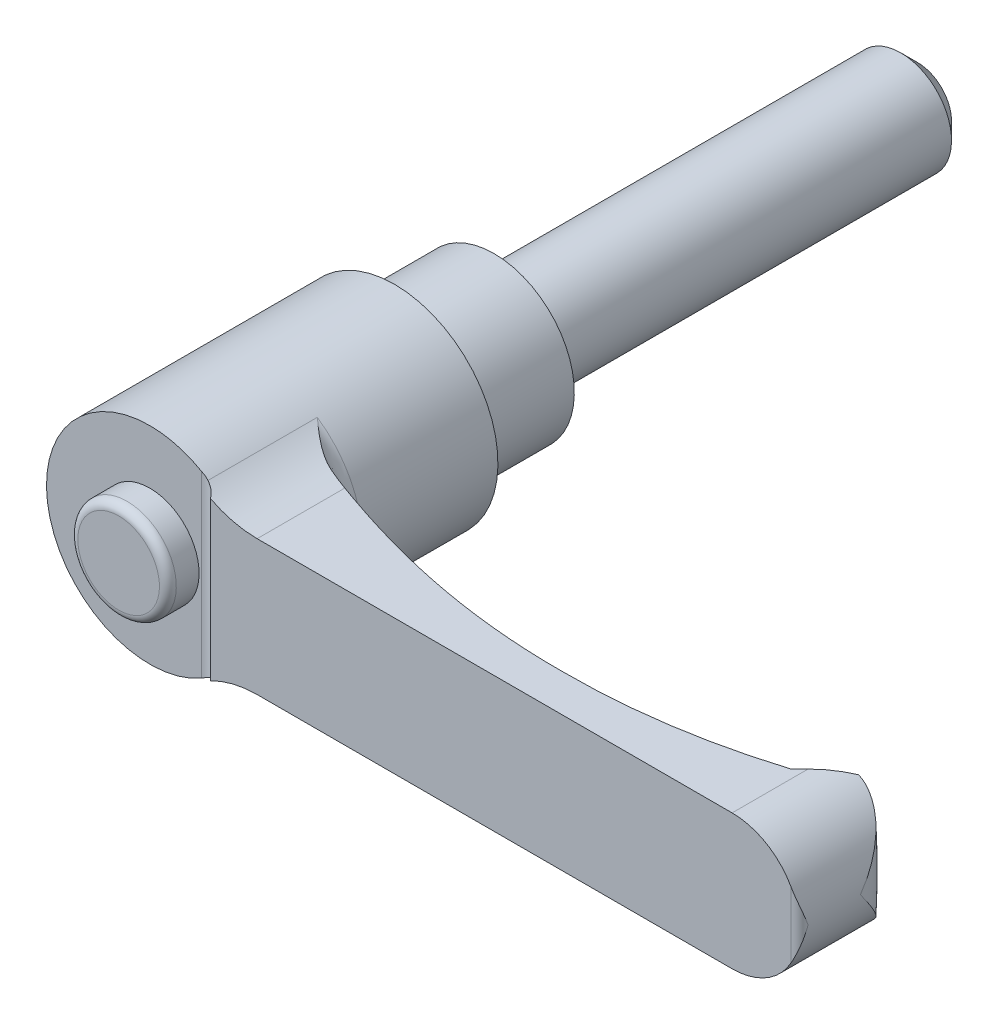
ISO-10303-21;
HEADER;
FILE_DESCRIPTION(('STEP AP214'),'2;1');
FILE_NAME('part.step','',(''),(''),'','','');
FILE_SCHEMA(('AUTOMOTIVE_DESIGN { 1 0 10303 214 1 1 1 1 }'));
ENDSEC;
DATA;
#1=APPLICATION_CONTEXT('core data for automotive mechanical design processes');
#2=APPLICATION_PROTOCOL_DEFINITION('international standard','automotive_design',2000,#1);
#3=PRODUCT_CONTEXT('',#1,'mechanical');
#4=PRODUCT('Part','Part','',(#3));
#5=PRODUCT_RELATED_PRODUCT_CATEGORY('part','',(#4));
#6=PRODUCT_DEFINITION_FORMATION('','',#4);
#7=PRODUCT_DEFINITION_CONTEXT('part definition',#1,'design');
#8=PRODUCT_DEFINITION('design','',#6,#7);
#9=PRODUCT_DEFINITION_SHAPE('','',#8);
#10=(LENGTH_UNIT() NAMED_UNIT(*) SI_UNIT(.MILLI.,.METRE.));
#11=(NAMED_UNIT(*) PLANE_ANGLE_UNIT() SI_UNIT($,.RADIAN.));
#12=(NAMED_UNIT(*) SI_UNIT($,.STERADIAN.) SOLID_ANGLE_UNIT());
#13=UNCERTAINTY_MEASURE_WITH_UNIT(LENGTH_MEASURE(1.E-05),#10,'distance_accuracy_value','');
#14=(GEOMETRIC_REPRESENTATION_CONTEXT(3) GLOBAL_UNCERTAINTY_ASSIGNED_CONTEXT((#13)) GLOBAL_UNIT_ASSIGNED_CONTEXT((#10,
#11,#12)) REPRESENTATION_CONTEXT('',''));
#15=CARTESIAN_POINT('',(0.,0.,0.));
#16=DIRECTION('',(0.,0.,1.));
#17=DIRECTION('',(1.,0.,0.));
#18=AXIS2_PLACEMENT_3D('',#15,#16,#17);
#19=CARTESIAN_POINT('',(7.6,0.,0.));
#20=DIRECTION('',(0.,0.,1.));
#21=DIRECTION('',(0.,-1.,0.));
#22=AXIS2_PLACEMENT_3D('',#19,#20,#21);
#23=PLANE('',#22);
#24=CARTESIAN_POINT('',(0.,0.,0.));
#25=DIRECTION('',(0.,0.,-1.));
#26=DIRECTION('',(0.,1.,0.));
#27=AXIS2_PLACEMENT_3D('',#24,#25,#26);
#28=CIRCLE('',#27,6.);
#29=CARTESIAN_POINT('',(0.,6.,0.));
#30=VERTEX_POINT('',#29);
#31=EDGE_CURVE('E422',#30,#30,#28,.T.);
#32=ORIENTED_EDGE('',*,*,#31,.F.);
#33=EDGE_LOOP('',(#32));
#34=FACE_BOUND('',#33,.T.);
#35=CARTESIAN_POINT('',(0.,0.,0.));
#36=DIRECTION('',(0.,0.,-1.));
#37=DIRECTION('',(0.,1.,0.));
#38=AXIS2_PLACEMENT_3D('',#35,#36,#37);
#39=CIRCLE('',#38,7.6);
#40=CARTESIAN_POINT('',(0.,7.6,0.));
#41=VERTEX_POINT('',#40);
#42=EDGE_CURVE('E347',#41,#41,#39,.T.);
#43=ORIENTED_EDGE('',*,*,#42,.T.);
#44=EDGE_LOOP('',(#43));
#45=FACE_BOUND('',#44,.T.);
#46=ADVANCED_FACE('F14',(#34,#45),#23,.F.);
#47=CARTESIAN_POINT('',(0.,0.,41.));
#48=DIRECTION('',(0.,0.,-1.));
#49=DIRECTION('',(0.,1.,0.));
#50=AXIS2_PLACEMENT_3D('',#47,#48,#49);
#51=PLANE('',#50);
#52=DIRECTION('',(0.,1.,0.));
#53=VECTOR('',#52,1.);
#54=CARTESIAN_POINT('',(6.125,-16.,41.));
#55=LINE('',#54,#53);
#56=CARTESIAN_POINT('',(6.125,-10.6088111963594,41.));
#57=VERTEX_POINT('',#56);
#58=CARTESIAN_POINT('',(6.125,10.6088111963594,41.));
#59=VERTEX_POINT('',#58);
#60=EDGE_CURVE('E385',#57,#59,#55,.T.);
#61=ORIENTED_EDGE('',*,*,#60,.T.);
#62=CARTESIAN_POINT('',(0.,0.,41.));
#63=DIRECTION('',(0.,0.,-1.));
#64=DIRECTION('',(0.,1.,0.));
#65=AXIS2_PLACEMENT_3D('',#62,#63,#64);
#66=CIRCLE('',#65,12.25);
#67=EDGE_CURVE('E332',#57,#59,#66,.T.);
#68=ORIENTED_EDGE('',*,*,#67,.F.);
#69=EDGE_LOOP('',(#61,#68));
#70=FACE_BOUND('',#69,.T.);
#71=CARTESIAN_POINT('',(0.,0.,41.));
#72=DIRECTION('',(0.,0.,-1.));
#73=DIRECTION('',(0.,1.,0.));
#74=AXIS2_PLACEMENT_3D('',#71,#72,#73);
#75=CIRCLE('',#74,5.83333333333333);
#76=CARTESIAN_POINT('',(0.,5.83333333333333,41.));
#77=VERTEX_POINT('',#76);
#78=EDGE_CURVE('E193',#77,#77,#75,.F.);
#79=ORIENTED_EDGE('',*,*,#78,.F.);
#80=EDGE_LOOP('',(#79));
#81=FACE_BOUND('',#80,.T.);
#82=ADVANCED_FACE('F163',(#70,#81),#51,.F.);
#83=CARTESIAN_POINT('',(70.,0.,0.));
#84=DIRECTION('',(0.,0.,1.));
#85=DIRECTION('',(0.,-1.,0.));
#86=AXIS2_PLACEMENT_3D('',#83,#84,#85);
#87=CYLINDRICAL_SURFACE('',#86,8.);
#88=CARTESIAN_POINT('',(78.,0.,34.8));
#89=CARTESIAN_POINT('',(78.0000000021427,-0.00507455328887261,34.7962762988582));
#90=CARTESIAN_POINT('',(77.9999951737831,-0.0101492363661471,34.7925524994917));
#91=CARTESIAN_POINT('',(77.9989416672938,-0.563628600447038,34.3864095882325));
#92=CARTESIAN_POINT('',(77.9414802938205,-1.11346566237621,33.9829298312));
#93=CARTESIAN_POINT('',(77.7692220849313,-1.92787753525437,33.38939297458));
#94=CARTESIAN_POINT('',(77.697249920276,-2.19810314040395,33.1931504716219));
#95=CARTESIAN_POINT('',(77.5237934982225,-2.73341157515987,32.8066637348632));
#96=CARTESIAN_POINT('',(77.4223242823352,-2.99849695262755,32.6164164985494));
#97=CARTESIAN_POINT('',(77.2199237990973,-3.45210642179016,32.2938177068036));
#98=CARTESIAN_POINT('',(77.1259458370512,-3.64233939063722,32.1594598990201));
#99=CARTESIAN_POINT('',(76.9211711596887,-4.01785016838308,31.8966888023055));
#100=CARTESIAN_POINT('',(76.8103745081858,-4.20312799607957,31.7682754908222));
#101=CARTESIAN_POINT('',(76.5717542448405,-4.56719869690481,31.5191542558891));
#102=CARTESIAN_POINT('',(76.4439640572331,-4.74600344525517,31.3984318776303));
#103=CARTESIAN_POINT('',(76.1708976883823,-5.09601175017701,31.1663364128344));
#104=CARTESIAN_POINT('',(76.0256268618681,-5.26721761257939,31.0549604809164));
#105=CARTESIAN_POINT('',(75.6441829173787,-5.67932922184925,30.7937387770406));
#106=CARTESIAN_POINT('',(75.3974573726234,-5.9150123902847,30.6505327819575));
#107=CARTESIAN_POINT('',(74.9987611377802,-6.24839682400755,30.4615945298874));
#108=CARTESIAN_POINT('',(74.8611020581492,-6.35616332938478,30.4029292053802));
#109=CARTESIAN_POINT('',(74.5764070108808,-6.56410843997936,30.2956150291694));
#110=CARTESIAN_POINT('',(74.429373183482,-6.66428876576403,30.2469639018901));
#111=CARTESIAN_POINT('',(74.1592544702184,-6.83522850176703,30.1705684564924));
#112=CARTESIAN_POINT('',(74.0378615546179,-6.90766708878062,30.1405781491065));
#113=CARTESIAN_POINT('',(73.7901015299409,-7.04665102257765,30.0886005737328));
#114=CARTESIAN_POINT('',(73.6637356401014,-7.11319780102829,30.0666113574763));
#115=CARTESIAN_POINT('',(73.4066843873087,-7.23982141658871,30.0315221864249));
#116=CARTESIAN_POINT('',(73.2760017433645,-7.2999022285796,30.0184167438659));
#117=CARTESIAN_POINT('',(73.0110423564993,-7.41312181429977,30.0019547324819));
#118=CARTESIAN_POINT('',(72.8767656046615,-7.46626057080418,29.9985981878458));
#119=CARTESIAN_POINT('',(72.6044130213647,-7.56559501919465,30.0024862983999));
#120=CARTESIAN_POINT('',(72.4663137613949,-7.6117232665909,30.009827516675));
#121=CARTESIAN_POINT('',(72.1887878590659,-7.69611880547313,30.0360283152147));
#122=CARTESIAN_POINT('',(72.0493611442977,-7.73438566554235,30.0548885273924));
#123=CARTESIAN_POINT('',(71.770740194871,-7.80288648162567,30.1046814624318));
#124=CARTESIAN_POINT('',(71.6315458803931,-7.83312431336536,30.1356083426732));
#125=CARTESIAN_POINT('',(71.3550409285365,-7.885663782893,30.2098119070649));
#126=CARTESIAN_POINT('',(71.217729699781,-7.90796796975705,30.2530846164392));
#127=CARTESIAN_POINT('',(70.8920238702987,-7.95241951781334,30.3719934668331));
#128=CARTESIAN_POINT('',(70.7052564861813,-7.97090772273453,30.4536477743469));
#129=CARTESIAN_POINT('',(70.433708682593,-7.98875485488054,30.5937624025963));
#130=CARTESIAN_POINT('',(70.3445710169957,-7.99305594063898,30.6434445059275));
#131=CARTESIAN_POINT('',(70.1696001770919,-7.99868029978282,30.7485120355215));
#132=CARTESIAN_POINT('',(70.0837676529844,-8.00000299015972,30.8038985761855));
#133=CARTESIAN_POINT('',(69.9998,-7.9999999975,30.8620428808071));
#134=B_SPLINE_CURVE_WITH_KNOTS('',3,(#88,#89,#90,#91,#92,#93,#94,#95,#96,#97,#98,#99,#100,#101,
#102,#103,#104,#105,#106,#107,#108,#109,#110,#111,#112,#113,#114,#115,#116,#117,#118,#119,#120,
#121,#122,#123,#124,#125,#126,#127,#128,#129,#130,#131,#132,#133),.UNSPECIFIED.,.F.,.F.,(4,2,2,
2,2,2,2,2,2,2,2,2,2,2,2,2,2,2,2,2,2,2,4),(0.,0.0188831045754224,2.05946970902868,
3.08347088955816,4.10695081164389,4.85978230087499,5.6126109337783,6.36398015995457,
7.11511980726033,8.22062566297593,8.77332293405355,9.32589447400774,9.75904172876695,
10.1920834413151,10.624857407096,11.0576324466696,11.4943381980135,11.9310679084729,
12.3675864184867,12.8039645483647,13.4155655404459,13.721767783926,14.0280299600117),.UNSPECIFIED.);
#135=CARTESIAN_POINT('',(72.9968893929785,-7.41745603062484,30.0031106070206));
#136=VERTEX_POINT('',#135);
#137=CARTESIAN_POINT('',(78.,0.,34.8));
#138=VERTEX_POINT('',#137);
#139=EDGE_CURVE('E126',#136,#138,#134,.F.);
#140=ORIENTED_EDGE('',*,*,#139,.T.);
#141=CARTESIAN_POINT('',(78.,0.,34.8));
#142=CARTESIAN_POINT('',(78.0000000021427,0.00507455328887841,34.7962762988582));
#143=CARTESIAN_POINT('',(77.9999951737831,0.0101492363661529,34.7925524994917));
#144=CARTESIAN_POINT('',(77.9989416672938,0.563628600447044,34.3864095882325));
#145=CARTESIAN_POINT('',(77.9414802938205,1.11346566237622,33.9829298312));
#146=CARTESIAN_POINT('',(77.7692220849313,1.92787753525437,33.38939297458));
#147=CARTESIAN_POINT('',(77.697249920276,2.19810314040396,33.1931504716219));
#148=CARTESIAN_POINT('',(77.5237934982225,2.73341157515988,32.8066637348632));
#149=CARTESIAN_POINT('',(77.4223242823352,2.99849695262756,32.6164164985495));
#150=CARTESIAN_POINT('',(77.2199237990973,3.45210642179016,32.2938177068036));
#151=CARTESIAN_POINT('',(77.1259458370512,3.64233939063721,32.1594598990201));
#152=CARTESIAN_POINT('',(76.9211711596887,4.01785016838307,31.8966888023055));
#153=CARTESIAN_POINT('',(76.8103745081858,4.20312799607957,31.7682754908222));
#154=CARTESIAN_POINT('',(76.5717542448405,4.56719869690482,31.5191542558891));
#155=CARTESIAN_POINT('',(76.4439640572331,4.74600344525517,31.3984318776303));
#156=CARTESIAN_POINT('',(76.1708976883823,5.09601175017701,31.1663364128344));
#157=CARTESIAN_POINT('',(76.0256268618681,5.26721761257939,31.0549604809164));
#158=CARTESIAN_POINT('',(75.6441829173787,5.67932922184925,30.7937387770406));
#159=CARTESIAN_POINT('',(75.3974573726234,5.91501239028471,30.6505327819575));
#160=CARTESIAN_POINT('',(74.9987611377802,6.24839682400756,30.4615945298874));
#161=CARTESIAN_POINT('',(74.8611020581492,6.35616332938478,30.4029292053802));
#162=CARTESIAN_POINT('',(74.5764070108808,6.56410843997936,30.2956150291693));
#163=CARTESIAN_POINT('',(74.429373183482,6.66428876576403,30.2469639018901));
#164=CARTESIAN_POINT('',(74.1592544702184,6.83522850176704,30.1705684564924));
#165=CARTESIAN_POINT('',(74.0378615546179,6.90766708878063,30.1405781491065));
#166=CARTESIAN_POINT('',(73.7901015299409,7.04665102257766,30.0886005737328));
#167=CARTESIAN_POINT('',(73.6637356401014,7.11319780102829,30.0666113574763));
#168=CARTESIAN_POINT('',(73.4066843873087,7.23982141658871,30.0315221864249));
#169=CARTESIAN_POINT('',(73.2760017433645,7.2999022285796,30.0184167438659));
#170=CARTESIAN_POINT('',(73.0110423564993,7.41312181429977,30.0019547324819));
#171=CARTESIAN_POINT('',(72.8767656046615,7.46626057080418,29.9985981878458));
#172=CARTESIAN_POINT('',(72.6044130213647,7.56559501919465,30.0024862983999));
#173=CARTESIAN_POINT('',(72.4663137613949,7.61172326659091,30.009827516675));
#174=CARTESIAN_POINT('',(72.1887878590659,7.69611880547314,30.0360283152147));
#175=CARTESIAN_POINT('',(72.0493611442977,7.73438566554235,30.0548885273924));
#176=CARTESIAN_POINT('',(71.770740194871,7.80288648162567,30.1046814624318));
#177=CARTESIAN_POINT('',(71.6315458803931,7.83312431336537,30.1356083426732));
#178=CARTESIAN_POINT('',(71.3550409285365,7.885663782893,30.2098119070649));
#179=CARTESIAN_POINT('',(71.217729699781,7.90796796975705,30.2530846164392));
#180=CARTESIAN_POINT('',(70.8920238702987,7.95241951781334,30.3719934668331));
#181=CARTESIAN_POINT('',(70.7052564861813,7.97090772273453,30.4536477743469));
#182=CARTESIAN_POINT('',(70.433708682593,7.98875485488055,30.5937624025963));
#183=CARTESIAN_POINT('',(70.3445710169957,7.99305594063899,30.6434445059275));
#184=CARTESIAN_POINT('',(70.1696001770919,7.99868029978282,30.7485120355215));
#185=CARTESIAN_POINT('',(70.0837676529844,8.00000299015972,30.8038985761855));
#186=CARTESIAN_POINT('',(69.9998,7.9999999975,30.8620428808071));
#187=B_SPLINE_CURVE_WITH_KNOTS('',3,(#141,#142,#143,#144,#145,#146,#147,#148,#149,#150,#151,
#152,#153,#154,#155,#156,#157,#158,#159,#160,#161,#162,#163,#164,#165,#166,#167,#168,#169,#170,
#171,#172,#173,#174,#175,#176,#177,#178,#179,#180,#181,#182,#183,#184,#185,#186),.UNSPECIFIED.,
.F.,.F.,(4,2,2,2,2,2,2,2,2,2,2,2,2,2,2,2,2,2,2,2,2,2,4),(0.,0.0188831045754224,2.05946970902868,
3.08347088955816,4.10695081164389,4.85978230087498,5.61261093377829,6.36398015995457,
7.11511980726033,8.22062566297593,8.77332293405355,9.32589447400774,9.75904172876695,
10.1920834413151,10.6248574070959,11.0576324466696,11.4943381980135,11.9310679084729,
12.3675864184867,12.8039645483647,13.4155655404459,13.721767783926,14.0280299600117),.UNSPECIFIED.);
#188=CARTESIAN_POINT('',(72.9968893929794,7.41745603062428,30.0031106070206));
#189=VERTEX_POINT('',#188);
#190=EDGE_CURVE('E123',#138,#189,#187,.T.);
#191=ORIENTED_EDGE('',*,*,#190,.T.);
#192=CARTESIAN_POINT('',(70.,0.,33.));
#193=DIRECTION('',(-0.707106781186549,0.,-0.707106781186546));
#194=DIRECTION('',(-0.707106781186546,0.,0.707106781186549));
#195=AXIS2_PLACEMENT_3D('',#192,#193,#194);
#196=ELLIPSE('',#195,11.3137084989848,8.);
#197=CARTESIAN_POINT('',(70.,8.,33.));
#198=VERTEX_POINT('',#197);
#199=EDGE_CURVE('E378',#189,#198,#196,.F.);
#200=ORIENTED_EDGE('',*,*,#199,.T.);
#201=DIRECTION('',(0.,0.,1.));
#202=VECTOR('',#201,1.);
#203=CARTESIAN_POINT('',(70.,8.,0.));
#204=LINE('',#203,#202);
#205=CARTESIAN_POINT('',(70.,8.,42.));
#206=VERTEX_POINT('',#205);
#207=EDGE_CURVE('E354',#198,#206,#204,.T.);
#208=ORIENTED_EDGE('',*,*,#207,.T.);
#209=CARTESIAN_POINT('',(70.,0.,42.));
#210=DIRECTION('',(0.,0.,1.));
#211=DIRECTION('',(0.,-1.,0.));
#212=AXIS2_PLACEMENT_3D('',#209,#210,#211);
#213=CIRCLE('',#212,8.);
#214=CARTESIAN_POINT('',(77.,3.87298334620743,42.));
#215=VERTEX_POINT('',#214);
#216=EDGE_CURVE('E327',#215,#206,#213,.T.);
#217=ORIENTED_EDGE('',*,*,#216,.F.);
#218=CARTESIAN_POINT('',(77.,3.87298334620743,42.));
#219=CARTESIAN_POINT('',(77.0320487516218,3.8150611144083,41.9999909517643));
#220=CARTESIAN_POINT('',(77.0633658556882,3.75675902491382,41.9984605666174));
#221=CARTESIAN_POINT('',(77.1244803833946,3.63952511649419,41.99269833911));
#222=CARTESIAN_POINT('',(77.1542784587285,3.58059358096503,41.9884676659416));
#223=CARTESIAN_POINT('',(77.241218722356,3.40324230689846,41.9722589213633));
#224=CARTESIAN_POINT('',(77.2960525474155,3.28400247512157,41.9567609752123));
#225=CARTESIAN_POINT('',(77.3991566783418,3.04456972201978,41.9185214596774));
#226=CARTESIAN_POINT('',(77.4474555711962,2.9243835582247,41.8958129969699));
#227=CARTESIAN_POINT('',(77.5378429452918,2.68282861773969,41.8446429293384));
#228=CARTESIAN_POINT('',(77.5799268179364,2.56145903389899,41.8161770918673));
#229=CARTESIAN_POINT('',(77.6827368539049,2.24038507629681,41.7351721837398));
#230=CARTESIAN_POINT('',(77.7382927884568,2.03996193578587,41.6788382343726));
#231=CARTESIAN_POINT('',(77.8332865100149,1.63779800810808,41.55814944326));
#232=CARTESIAN_POINT('',(77.8727175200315,1.43605670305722,41.4937912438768));
#233=CARTESIAN_POINT('',(77.967421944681,0.829293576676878,41.2932012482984));
#234=CARTESIAN_POINT('',(77.999127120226,0.42266785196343,41.1494356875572));
#235=CARTESIAN_POINT('',(77.9999940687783,0.0112434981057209,41.0039751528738));
#236=CARTESIAN_POINT('',(77.9999999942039,0.00562166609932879,41.0019875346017));
#237=CARTESIAN_POINT('',(78.,0.,41.));
#238=B_SPLINE_CURVE_WITH_KNOTS('',3,(#218,#219,#220,#221,#222,#223,#224,#225,#226,#227,#228,
#229,#230,#231,#232,#233,#234,#235,#236,#237),.UNSPECIFIED.,.F.,.F.,(4,2,2,2,2,2,2,2,2,4),(0.,
0.198535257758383,0.396984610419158,0.792983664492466,1.18719018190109,1.5816875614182,
2.22713013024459,2.8728436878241,4.16406208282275,4.18195063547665),.UNSPECIFIED.);
#239=CARTESIAN_POINT('',(78.,0.,41.));
#240=VERTEX_POINT('',#239);
#241=EDGE_CURVE('E179',#240,#215,#238,.F.);
#242=ORIENTED_EDGE('',*,*,#241,.F.);
#243=CARTESIAN_POINT('',(77.,-3.87298334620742,42.));
#244=CARTESIAN_POINT('',(77.0320487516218,-3.81506111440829,41.9999909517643));
#245=CARTESIAN_POINT('',(77.0633658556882,-3.75675902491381,41.9984605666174));
#246=CARTESIAN_POINT('',(77.1244803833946,-3.63952511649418,41.99269833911));
#247=CARTESIAN_POINT('',(77.1542784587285,-3.58059358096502,41.9884676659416));
#248=CARTESIAN_POINT('',(77.241218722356,-3.40324230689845,41.9722589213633));
#249=CARTESIAN_POINT('',(77.2960525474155,-3.28400247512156,41.9567609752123));
#250=CARTESIAN_POINT('',(77.3991566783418,-3.04456972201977,41.9185214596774));
#251=CARTESIAN_POINT('',(77.4474555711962,-2.92438355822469,41.8958129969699));
#252=CARTESIAN_POINT('',(77.5378429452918,-2.68282861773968,41.8446429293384));
#253=CARTESIAN_POINT('',(77.5799268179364,-2.56145903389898,41.8161770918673));
#254=CARTESIAN_POINT('',(77.6827368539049,-2.2403850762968,41.7351721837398));
#255=CARTESIAN_POINT('',(77.7382927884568,-2.03996193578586,41.6788382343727));
#256=CARTESIAN_POINT('',(77.8332865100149,-1.63779800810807,41.55814944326));
#257=CARTESIAN_POINT('',(77.8727175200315,-1.43605670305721,41.4937912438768));
#258=CARTESIAN_POINT('',(77.967421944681,-0.829293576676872,41.2932012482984));
#259=CARTESIAN_POINT('',(77.999127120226,-0.422667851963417,41.1494356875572));
#260=CARTESIAN_POINT('',(77.9999940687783,-0.0112434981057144,41.0039751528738));
#261=CARTESIAN_POINT('',(77.9999999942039,-0.00562166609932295,41.0019875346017));
#262=CARTESIAN_POINT('',(78.,0.,41.));
#263=B_SPLINE_CURVE_WITH_KNOTS('',3,(#243,#244,#245,#246,#247,#248,#249,#250,#251,#252,#253,
#254,#255,#256,#257,#258,#259,#260,#261,#262),.UNSPECIFIED.,.F.,.F.,(4,2,2,2,2,2,2,2,2,4),(0.,
0.19853525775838,0.396984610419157,0.792983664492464,1.18719018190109,1.5816875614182,
2.2271301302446,2.8728436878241,4.16406208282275,4.18195063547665),.UNSPECIFIED.);
#264=CARTESIAN_POINT('',(77.,-3.87298334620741,42.));
#265=VERTEX_POINT('',#264);
#266=EDGE_CURVE('E187',#265,#240,#263,.T.);
#267=ORIENTED_EDGE('',*,*,#266,.F.);
#268=CARTESIAN_POINT('',(70.,-8.,42.));
#269=VERTEX_POINT('',#268);
#270=EDGE_CURVE('E322',#269,#265,#213,.T.);
#271=ORIENTED_EDGE('',*,*,#270,.F.);
#272=DIRECTION('',(0.,0.,1.));
#273=VECTOR('',#272,1.);
#274=CARTESIAN_POINT('',(70.,-8.,0.));
#275=LINE('',#274,#273);
#276=CARTESIAN_POINT('',(70.,-8.,33.));
#277=VERTEX_POINT('',#276);
#278=EDGE_CURVE('E357',#277,#269,#275,.T.);
#279=ORIENTED_EDGE('',*,*,#278,.F.);
#280=EDGE_CURVE('E137',#277,#136,#196,.F.);
#281=ORIENTED_EDGE('',*,*,#280,.T.);
#282=EDGE_LOOP('',(#140,#191,#200,#208,#217,#242,#267,#271,#279,#281));
#283=FACE_BOUND('',#282,.T.);
#284=ADVANCED_FACE('F135',(#283),#87,.T.);
#285=CARTESIAN_POINT('',(73.,-16.,30.));
#286=DIRECTION('',(-0.707106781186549,0.,-0.707106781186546));
#287=DIRECTION('',(0.707106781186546,0.,-0.707106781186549));
#288=AXIS2_PLACEMENT_3D('',#285,#286,#287);
#289=PLANE('',#288);
#290=DIRECTION('',(0.,1.,0.));
#291=VECTOR('',#290,1.);
#292=CARTESIAN_POINT('',(73.,-16.,30.));
#293=LINE('',#292,#291);
#294=CARTESIAN_POINT('',(73.,-5.40740233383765,30.));
#295=VERTEX_POINT('',#294);
#296=CARTESIAN_POINT('',(73.,5.40740233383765,30.));
#297=VERTEX_POINT('',#296);
#298=EDGE_CURVE('E397',#295,#297,#293,.T.);
#299=ORIENTED_EDGE('',*,*,#298,.F.);
#300=CARTESIAN_POINT('',(72.9944134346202,8.0002,30.0055865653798));
#301=CARTESIAN_POINT('',(72.9964174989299,7.60019527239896,30.0035825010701));
#302=CARTESIAN_POINT('',(72.9977626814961,7.20018596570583,30.0022373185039));
#303=CARTESIAN_POINT('',(72.9994970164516,6.40016550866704,30.0005029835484));
#304=CARTESIAN_POINT('',(72.9998861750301,6.00015435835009,30.0001138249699));
#305=CARTESIAN_POINT('',(73.0000702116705,5.20013335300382,29.9999297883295));
#306=CARTESIAN_POINT('',(72.9998650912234,4.80012349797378,30.0001349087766));
#307=CARTESIAN_POINT('',(72.9991717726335,4.00010369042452,30.0008282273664));
#308=CARTESIAN_POINT('',(72.998683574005,3.60009373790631,30.001316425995));
#309=CARTESIAN_POINT('',(72.9972116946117,2.40006658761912,30.0027883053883));
#310=CARTESIAN_POINT('',(72.9962207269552,1.60004928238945,30.0037792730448));
#311=CARTESIAN_POINT('',(72.9954610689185,1.3601944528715E-05,30.0045389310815));
#312=CARTESIAN_POINT('',(72.9956923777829,-0.800004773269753,30.004307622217));
#313=CARTESIAN_POINT('',(72.9968584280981,-2.13336982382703,30.0031415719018));
#314=CARTESIAN_POINT('',(72.9975329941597,-2.66671710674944,30.0024670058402));
#315=CARTESIAN_POINT('',(72.9988528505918,-3.73341119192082,30.0011471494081));
#316=CARTESIAN_POINT('',(72.999498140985,-4.26675799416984,30.000501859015));
#317=CARTESIAN_POINT('',(73.000124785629,-5.33345534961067,29.999875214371));
#318=CARTESIAN_POINT('',(73.0001061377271,-5.86680590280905,29.9998938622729));
#319=CARTESIAN_POINT('',(72.9985813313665,-6.93350631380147,30.0014186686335));
#320=CARTESIAN_POINT('',(72.997075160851,-7.46685617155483,30.002924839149));
#321=CARTESIAN_POINT('',(72.9944134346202,-8.0002,30.0055865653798));
#322=B_SPLINE_CURVE_WITH_KNOTS('',3,(#300,#301,#302,#303,#304,#305,#306,#307,#308,#309,#310,
#311,#312,#313,#314,#315,#316,#317,#318,#319,#320,#321),.UNSPECIFIED.,.F.,.F.,(4,2,2,2,2,2,2,2,
2,2,4),(0.,1.20004037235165,2.40007297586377,3.60010256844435,4.80013422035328,7.20018907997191,
9.60024245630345,11.2002867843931,12.8003298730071,14.4003781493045,16.0004393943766),.UNSPECIFIED.);
#323=EDGE_CURVE('E138',#295,#136,#322,.T.);
#324=ORIENTED_EDGE('',*,*,#323,.T.);
#325=ORIENTED_EDGE('',*,*,#280,.F.);
#326=DIRECTION('',(-0.707106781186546,0.,0.707106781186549));
#327=VECTOR('',#326,1.);
#328=CARTESIAN_POINT('',(86.5,-8.,16.5));
#329=LINE('',#328,#327);
#330=CARTESIAN_POINT('',(69.,-8.,34.));
#331=VERTEX_POINT('',#330);
#332=EDGE_CURVE('E321',#277,#331,#329,.T.);
#333=ORIENTED_EDGE('',*,*,#332,.T.);
#334=DIRECTION('',(0.,1.,0.));
#335=VECTOR('',#334,1.);
#336=CARTESIAN_POINT('',(69.,-16.,34.));
#337=LINE('',#336,#335);
#338=CARTESIAN_POINT('',(69.,8.,34.));
#339=VERTEX_POINT('',#338);
#340=EDGE_CURVE('E319',#331,#339,#337,.T.);
#341=ORIENTED_EDGE('',*,*,#340,.T.);
#342=DIRECTION('',(0.707106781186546,0.,-0.707106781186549));
#343=VECTOR('',#342,1.);
#344=CARTESIAN_POINT('',(58.3567940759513,8.,44.6432059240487));
#345=LINE('',#344,#343);
#346=EDGE_CURVE('E375',#339,#198,#345,.T.);
#347=ORIENTED_EDGE('',*,*,#346,.T.);
#348=ORIENTED_EDGE('',*,*,#199,.F.);
#349=EDGE_CURVE('E129',#189,#297,#322,.T.);
#350=ORIENTED_EDGE('',*,*,#349,.T.);
#351=EDGE_LOOP('',(#299,#324,#325,#333,#341,#347,#348,#350));
#352=FACE_BOUND('',#351,.T.);
#353=ADVANCED_FACE('F162',(#352),#289,.T.);
#354=CARTESIAN_POINT('',(73.2,-16.,30.));
#355=DIRECTION('',(0.,0.,-1.));
#356=DIRECTION('',(0.,1.,0.));
#357=AXIS2_PLACEMENT_3D('',#354,#355,#356);
#358=PLANE('',#357);
#359=ORIENTED_EDGE('',*,*,#298,.T.);
#360=CARTESIAN_POINT('',(0.,0.,30.));
#361=DIRECTION('',(0.,0.,-1.));
#362=DIRECTION('',(0.,1.,0.));
#363=AXIS2_PLACEMENT_3D('',#360,#361,#362);
#364=CIRCLE('',#363,73.2);
#365=EDGE_CURVE('E36',#297,#295,#364,.T.);
#366=ORIENTED_EDGE('',*,*,#365,.T.);
#367=EDGE_LOOP('',(#359,#366));
#368=FACE_BOUND('',#367,.T.);
#369=ADVANCED_FACE('F201',(#368),#358,.T.);
#370=CARTESIAN_POINT('',(0.,0.,42.));
#371=DIRECTION('',(0.,0.,1.));
#372=DIRECTION('',(0.,-1.,0.));
#373=AXIS2_PLACEMENT_3D('',#370,#371,#372);
#374=PLANE('',#373);
#375=CARTESIAN_POINT('',(13.7135881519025,20.,42.));
#376=DIRECTION('',(0.,0.,1.));
#377=DIRECTION('',(1.,0.,0.));
#378=AXIS2_PLACEMENT_3D('',#375,#376,#377);
#379=CIRCLE('',#378,12.);
#380=CARTESIAN_POINT('',(8.16666666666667,9.35896330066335,42.));
#381=VERTEX_POINT('',#380);
#382=CARTESIAN_POINT('',(13.7135881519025,8.,42.));
#383=VERTEX_POINT('',#382);
#384=EDGE_CURVE('E372',#381,#383,#379,.T.);
#385=ORIENTED_EDGE('',*,*,#384,.F.);
#386=DIRECTION('',(0.,1.,0.));
#387=VECTOR('',#386,1.);
#388=CARTESIAN_POINT('',(8.16666666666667,-16.,42.));
#389=LINE('',#388,#387);
#390=CARTESIAN_POINT('',(8.16666666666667,-9.35896330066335,42.));
#391=VERTEX_POINT('',#390);
#392=EDGE_CURVE('E392',#391,#381,#389,.T.);
#393=ORIENTED_EDGE('',*,*,#392,.F.);
#394=CARTESIAN_POINT('',(13.7135881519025,-20.,42.));
#395=DIRECTION('',(0.,0.,1.));
#396=DIRECTION('',(1.,0.,0.));
#397=AXIS2_PLACEMENT_3D('',#394,#395,#396);
#398=CIRCLE('',#397,12.);
#399=CARTESIAN_POINT('',(13.7135881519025,-8.,42.));
#400=VERTEX_POINT('',#399);
#401=EDGE_CURVE('E363',#400,#391,#398,.T.);
#402=ORIENTED_EDGE('',*,*,#401,.F.);
#403=DIRECTION('',(-1.,0.,0.));
#404=VECTOR('',#403,1.);
#405=CARTESIAN_POINT('',(70.,-8.,42.));
#406=LINE('',#405,#404);
#407=EDGE_CURVE('E366',#269,#400,#406,.T.);
#408=ORIENTED_EDGE('',*,*,#407,.F.);
#409=ORIENTED_EDGE('',*,*,#270,.T.);
#410=DIRECTION('',(0.,1.,0.));
#411=VECTOR('',#410,1.);
#412=CARTESIAN_POINT('',(77.,-16.,42.));
#413=LINE('',#412,#411);
#414=EDGE_CURVE('E393',#265,#215,#413,.T.);
#415=ORIENTED_EDGE('',*,*,#414,.T.);
#416=ORIENTED_EDGE('',*,*,#216,.T.);
#417=DIRECTION('',(1.,0.,0.));
#418=VECTOR('',#417,1.);
#419=CARTESIAN_POINT('',(13.7135881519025,8.,42.));
#420=LINE('',#419,#418);
#421=EDGE_CURVE('E369',#383,#206,#420,.T.);
#422=ORIENTED_EDGE('',*,*,#421,.F.);
#423=EDGE_LOOP('',(#385,#393,#402,#408,#409,#415,#416,#422));
#424=FACE_BOUND('',#423,.T.);
#425=ADVANCED_FACE('F248',(#424),#374,.T.);
#426=CARTESIAN_POINT('',(0.,0.,0.));
#427=DIRECTION('',(0.,0.,-1.));
#428=DIRECTION('',(0.,1.,0.));
#429=AXIS2_PLACEMENT_3D('',#426,#427,#428);
#430=CYLINDRICAL_SURFACE('',#429,12.25);
#431=CARTESIAN_POINT('',(0.,0.,28.0779919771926));
#432=DIRECTION('',(0.,0.,-1.));
#433=DIRECTION('',(0.,1.,0.));
#434=AXIS2_PLACEMENT_3D('',#431,#432,#433);
#435=CIRCLE('',#434,12.25);
#436=CARTESIAN_POINT('',(6.92748267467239,10.1030927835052,28.0779919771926));
#437=VERTEX_POINT('',#436);
#438=CARTESIAN_POINT('',(6.92748267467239,-10.1030927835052,28.0779919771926));
#439=VERTEX_POINT('',#438);
#440=EDGE_CURVE('E412',#437,#439,#435,.T.);
#441=ORIENTED_EDGE('',*,*,#440,.T.);
#442=DIRECTION('',(0.,0.,1.));
#443=VECTOR('',#442,1.);
#444=CARTESIAN_POINT('',(6.92748267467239,-10.1030927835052,0.));
#445=LINE('',#444,#443);
#446=CARTESIAN_POINT('',(6.92748267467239,-10.1030927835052,41.0427567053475));
#447=VERTEX_POINT('',#446);
#448=EDGE_CURVE('E361',#439,#447,#445,.T.);
#449=ORIENTED_EDGE('',*,*,#448,.T.);
#450=CARTESIAN_POINT('',(6.125,-10.6088111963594,41.));
#451=CARTESIAN_POINT('',(6.19832883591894,-10.5664875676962,40.9889897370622));
#452=CARTESIAN_POINT('',(6.27164451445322,-10.523132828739,40.9821479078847));
#453=CARTESIAN_POINT('',(6.41753908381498,-10.4347921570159,40.9764986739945));
#454=CARTESIAN_POINT('',(6.49011843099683,-10.3898073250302,40.9776859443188));
#455=CARTESIAN_POINT('',(6.63402897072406,-10.2985167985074,40.9877856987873));
#456=CARTESIAN_POINT('',(6.70535828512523,-10.2522093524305,40.996708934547));
#457=CARTESIAN_POINT('',(6.84611057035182,-10.1587605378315,41.0220012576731));
#458=CARTESIAN_POINT('',(6.91553331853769,-10.1116190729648,41.0383712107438));
#459=CARTESIAN_POINT('',(7.10641045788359,-9.97916014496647,41.094233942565));
#460=CARTESIAN_POINT('',(7.22525798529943,-9.89334730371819,41.1417583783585));
#461=CARTESIAN_POINT('',(7.45241295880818,-9.72337963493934,41.2589427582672));
#462=CARTESIAN_POINT('',(7.56074253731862,-9.63922163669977,41.3285548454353));
#463=CARTESIAN_POINT('',(7.71168483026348,-9.51821587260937,41.4479066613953));
#464=CARTESIAN_POINT('',(7.75936397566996,-9.47936365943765,41.4893658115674));
#465=CARTESIAN_POINT('',(7.85125896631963,-9.40339173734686,41.5773725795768));
#466=CARTESIAN_POINT('',(7.89547657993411,-9.36627114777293,41.6239175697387));
#467=CARTESIAN_POINT('',(7.98020904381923,-9.29418452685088,41.7223463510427));
#468=CARTESIAN_POINT('',(8.02070494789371,-9.25922978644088,41.7742548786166));
#469=CARTESIAN_POINT('',(8.09722101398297,-9.19239515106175,41.8832605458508));
#470=CARTESIAN_POINT('',(8.13323329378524,-9.16052069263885,41.9403665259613));
#471=CARTESIAN_POINT('',(8.16666666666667,-9.13061090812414,42.));
#472=B_SPLINE_CURVE_WITH_KNOTS('',3,(#450,#451,#452,#453,#454,#455,#456,#457,#458,#459,#460,
#461,#462,#463,#464,#465,#466,#467,#468,#469,#470,#471),.UNSPECIFIED.,.F.,.F.,(4,2,2,2,2,2,2,2,
2,2,4),(0.,0.255975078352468,0.511780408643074,0.767941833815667,1.02413304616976,
1.48441304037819,1.94370248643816,2.16599787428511,2.38817894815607,2.61143478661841,
2.83507772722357),.UNSPECIFIED.);
#473=EDGE_CURVE('E222',#57,#447,#472,.T.);
#474=ORIENTED_EDGE('',*,*,#473,.F.);
#475=ORIENTED_EDGE('',*,*,#67,.T.);
#476=CARTESIAN_POINT('',(8.16666666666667,9.13061090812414,42.));
#477=CARTESIAN_POINT('',(8.13602850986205,9.15801692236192,41.9453523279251));
#478=CARTESIAN_POINT('',(8.10323346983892,9.18706943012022,41.8928397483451));
#479=CARTESIAN_POINT('',(8.03382107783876,9.24782874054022,41.7921703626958));
#480=CARTESIAN_POINT('',(7.99720910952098,9.27953179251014,41.7440075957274));
#481=CARTESIAN_POINT('',(7.88274220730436,9.37735907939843,41.6065497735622));
#482=CARTESIAN_POINT('',(7.79984772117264,9.44657197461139,41.5235775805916));
#483=CARTESIAN_POINT('',(7.62397737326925,9.58906879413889,41.3751924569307));
#484=CARTESIAN_POINT('',(7.53106018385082,9.66232791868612,41.3096843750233));
#485=CARTESIAN_POINT('',(7.33643153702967,9.81092784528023,41.1955319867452));
#486=CARTESIAN_POINT('',(7.23469620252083,9.88627389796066,41.1469353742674));
#487=CARTESIAN_POINT('',(7.00601089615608,10.0499435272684,41.0604339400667));
#488=CARTESIAN_POINT('',(6.87776073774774,10.1382349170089,41.0258797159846));
#489=CARTESIAN_POINT('',(6.61511692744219,10.3115145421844,40.9827504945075));
#490=CARTESIAN_POINT('',(6.48074133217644,10.3965112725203,40.9741035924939));
#491=CARTESIAN_POINT('',(6.30869788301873,10.5006996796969,40.9806991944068));
#492=CARTESIAN_POINT('',(6.27199131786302,10.5226640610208,40.9831161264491));
#493=CARTESIAN_POINT('',(6.19852568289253,10.5661055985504,40.9900077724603));
#494=CARTESIAN_POINT('',(6.16176668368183,10.5875831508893,40.9944807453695));
#495=CARTESIAN_POINT('',(6.125,10.6088111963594,41.));
#496=B_SPLINE_CURVE_WITH_KNOTS('',3,(#476,#477,#478,#479,#480,#481,#482,#483,#484,#485,#486,
#487,#488,#489,#490,#491,#492,#493,#494,#495),.UNSPECIFIED.,.F.,.F.,(4,2,2,2,2,2,2,2,2,4),(0.,
0.204930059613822,0.409574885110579,0.816210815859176,1.22058373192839,1.62608799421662,
2.10242753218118,2.57744378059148,2.7059409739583,2.83432955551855),.UNSPECIFIED.);
#497=CARTESIAN_POINT('',(6.92748267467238,10.1030927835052,41.0427567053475));
#498=VERTEX_POINT('',#497);
#499=EDGE_CURVE('E236',#498,#59,#496,.T.);
#500=ORIENTED_EDGE('',*,*,#499,.F.);
#501=DIRECTION('',(0.,0.,1.));
#502=VECTOR('',#501,1.);
#503=CARTESIAN_POINT('',(6.92748267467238,10.1030927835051,0.));
#504=LINE('',#503,#502);
#505=EDGE_CURVE('E350',#437,#498,#504,.T.);
#506=ORIENTED_EDGE('',*,*,#505,.F.);
#507=EDGE_LOOP('',(#441,#449,#474,#475,#500,#506));
#508=FACE_BOUND('',#507,.T.);
#509=CARTESIAN_POINT('',(0.,0.,12.));
#510=DIRECTION('',(0.,0.,-1.));
#511=DIRECTION('',(0.,1.,0.));
#512=AXIS2_PLACEMENT_3D('',#509,#510,#511);
#513=CIRCLE('',#512,12.25);
#514=CARTESIAN_POINT('',(0.,12.25,12.));
#515=VERTEX_POINT('',#514);
#516=EDGE_CURVE('E335',#515,#515,#513,.T.);
#517=ORIENTED_EDGE('',*,*,#516,.F.);
#518=EDGE_LOOP('',(#517));
#519=FACE_BOUND('',#518,.T.);
#520=ADVANCED_FACE('F246',(#508,#519),#430,.T.);
#521=CARTESIAN_POINT('',(13.7135881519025,20.,0.));
#522=DIRECTION('',(0.,0.,1.));
#523=DIRECTION('',(0.,-1.,0.));
#524=AXIS2_PLACEMENT_3D('',#521,#522,#523);
#525=CYLINDRICAL_SURFACE('',#524,12.);
#526=DIRECTION('',(0.,0.,1.));
#527=VECTOR('',#526,1.);
#528=CARTESIAN_POINT('',(13.7135881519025,8.,0.));
#529=LINE('',#528,#527);
#530=CARTESIAN_POINT('',(13.7135881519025,8.,31.611749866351));
#531=VERTEX_POINT('',#530);
#532=EDGE_CURVE('E352',#531,#383,#529,.T.);
#533=ORIENTED_EDGE('',*,*,#532,.F.);
#534=CARTESIAN_POINT('',(16.5591435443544,8.34226374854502,32.6591102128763));
#535=CARTESIAN_POINT('',(16.3261928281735,8.28540329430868,32.5722424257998));
#536=CARTESIAN_POINT('',(16.0917373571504,8.23557224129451,32.4848250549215));
#537=CARTESIAN_POINT('',(15.6204190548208,8.15004770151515,32.3095064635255));
#538=CARTESIAN_POINT('',(15.3835560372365,8.11435531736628,32.2216052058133));
#539=CARTESIAN_POINT('',(14.9085098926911,8.05724969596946,32.0461136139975));
#540=CARTESIAN_POINT('',(14.6703300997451,8.03580964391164,31.9585230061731));
#541=CARTESIAN_POINT('',(14.1928153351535,8.00718735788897,31.7842679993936));
#542=CARTESIAN_POINT('',(13.9534804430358,8.00000415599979,31.697603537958));
#543=CARTESIAN_POINT('',(13.3222890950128,7.99999321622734,31.4717100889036));
#544=CARTESIAN_POINT('',(12.9298365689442,8.01913869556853,31.3339527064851));
#545=CARTESIAN_POINT('',(12.1446747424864,8.09645283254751,31.0677464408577));
#546=CARTESIAN_POINT('',(11.7519664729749,8.15469870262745,30.9393165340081));
#547=CARTESIAN_POINT('',(11.0678445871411,8.29148603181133,30.7286186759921));
#548=CARTESIAN_POINT('',(10.7757440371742,8.36126529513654,30.6428547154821));
#549=CARTESIAN_POINT('',(10.1944299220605,8.52365043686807,30.4833757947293));
#550=CARTESIAN_POINT('',(9.90521727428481,8.61626334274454,30.4096645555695));
#551=CARTESIAN_POINT('',(9.33232622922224,8.82426158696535,30.2779606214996));
#552=CARTESIAN_POINT('',(9.04863462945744,8.93958259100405,30.219924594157));
#553=CARTESIAN_POINT('',(8.48843633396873,9.19295718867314,30.1227055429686));
#554=CARTESIAN_POINT('',(8.21192433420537,9.33099341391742,30.0835082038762));
#555=CARTESIAN_POINT('',(7.70530850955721,9.60902203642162,30.0304308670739));
#556=CARTESIAN_POINT('',(7.47397220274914,9.74624410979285,30.0138509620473));
#557=CARTESIAN_POINT('',(7.13386740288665,9.96379307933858,30.0017184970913));
#558=CARTESIAN_POINT('',(7.0215618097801,10.0383265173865,29.9998008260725));
#559=CARTESIAN_POINT('',(6.79949902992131,10.1911494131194,30.0002323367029));
#560=CARTESIAN_POINT('',(6.68974254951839,10.2694398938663,30.0025826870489));
#561=CARTESIAN_POINT('',(6.5813815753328,10.3495269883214,30.007070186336));
#562=B_SPLINE_CURVE_WITH_KNOTS('',3,(#534,#535,#536,#537,#538,#539,#540,#541,#542,#543,#544,
#545,#546,#547,#548,#549,#550,#551,#552,#553,#554,#555,#556,#557,#558,#559,#560,#561),
.UNSPECIFIED.,.F.,.F.,(4,2,2,2,2,2,2,2,2,2,2,2,2,4),(0.,0.765007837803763,1.53007532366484,
2.29369928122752,3.05727139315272,4.30444442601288,5.55408755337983,6.49010923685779,
7.42641935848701,8.36011402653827,9.29309806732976,10.100354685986,10.5046318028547,
10.9090196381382),.UNSPECIFIED.);
#563=CARTESIAN_POINT('',(11.361472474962,8.23277637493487,30.8190510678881));
#564=VERTEX_POINT('',#563);
#565=EDGE_CURVE('E262',#531,#564,#562,.T.);
#566=ORIENTED_EDGE('',*,*,#565,.T.);
#567=CARTESIAN_POINT('',(14.1569924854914,8.00819477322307,30.9010555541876));
#568=CARTESIAN_POINT('',(14.0595029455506,8.00457612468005,30.9322196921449));
#569=CARTESIAN_POINT('',(13.9606253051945,8.00212380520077,30.9590151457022));
#570=CARTESIAN_POINT('',(13.7610637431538,7.99968329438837,31.004218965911));
#571=CARTESIAN_POINT('',(13.6603822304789,7.99969203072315,31.0226377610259));
#572=CARTESIAN_POINT('',(13.4585847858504,8.00228706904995,31.0514218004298));
#573=CARTESIAN_POINT('',(13.3574757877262,8.00485682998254,31.061837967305));
#574=CARTESIAN_POINT('',(13.1548462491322,8.01258614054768,31.0753001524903));
#575=CARTESIAN_POINT('',(13.053325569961,8.01774665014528,31.0783434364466));
#576=CARTESIAN_POINT('',(12.8251352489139,8.0322613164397,31.0774805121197));
#577=CARTESIAN_POINT('',(12.6985166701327,8.04234092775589,31.07164895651));
#578=CARTESIAN_POINT('',(12.446446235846,8.06641586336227,31.0503579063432));
#579=CARTESIAN_POINT('',(12.3209952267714,8.08041382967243,31.0348919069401));
#580=CARTESIAN_POINT('',(11.9473264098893,8.12804907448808,30.9756133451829));
#581=CARTESIAN_POINT('',(11.7017310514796,8.16733172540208,30.9189189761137));
#582=CARTESIAN_POINT('',(11.4284283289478,8.21954129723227,30.8393902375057));
#583=CARTESIAN_POINT('',(11.3952261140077,8.22603104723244,30.829444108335));
#584=CARTESIAN_POINT('',(11.1613640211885,8.27276596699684,30.7574361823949));
#585=CARTESIAN_POINT('',(10.9642103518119,8.31751135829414,30.6865405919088));
#586=CARTESIAN_POINT('',(10.5777285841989,8.41525886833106,30.5303701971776));
#587=CARTESIAN_POINT('',(10.3884095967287,8.46827027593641,30.4450792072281));
#588=CARTESIAN_POINT('',(10.0168146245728,8.5819543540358,30.262829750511));
#589=CARTESIAN_POINT('',(9.83457244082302,8.64265900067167,30.1658226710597));
#590=CARTESIAN_POINT('',(9.47767438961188,8.77088665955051,29.9630240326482));
#591=CARTESIAN_POINT('',(9.30301613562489,8.83840750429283,29.8572352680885));
#592=CARTESIAN_POINT('',(8.93248691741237,8.99147577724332,29.6209801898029));
#593=CARTESIAN_POINT('',(8.73785326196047,9.07816138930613,29.4893172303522));
#594=CARTESIAN_POINT('',(8.35703282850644,9.25980318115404,29.2196101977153));
#595=CARTESIAN_POINT('',(8.17084790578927,9.35476116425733,29.0815647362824));
#596=CARTESIAN_POINT('',(7.80639286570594,9.55261034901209,28.801722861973));
#597=CARTESIAN_POINT('',(7.62810747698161,9.65548508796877,28.6599346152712));
#598=CARTESIAN_POINT('',(7.27822148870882,9.8694475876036,28.3744148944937));
#599=CARTESIAN_POINT('',(7.10661929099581,9.98053336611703,28.2306838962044));
#600=CARTESIAN_POINT('',(6.93448645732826,10.0982931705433,28.0839649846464));
#601=CARTESIAN_POINT('',(6.93098392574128,10.1006920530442,28.0809784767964));
#602=CARTESIAN_POINT('',(6.92748267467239,10.1030927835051,28.0779919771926));
#603=B_SPLINE_CURVE_WITH_KNOTS('',3,(#567,#568,#569,#570,#571,#572,#573,#574,#575,#576,#577,
#578,#579,#580,#581,#582,#583,#584,#585,#586,#587,#588,#589,#590,#591,#592,#593,#594,#595,#596,
#597,#598,#599,#600,#601,#602),.UNSPECIFIED.,.F.,.F.,(4,2,2,2,2,2,2,2,2,2,2,2,2,2,2,2,2,4),(0.,
0.307060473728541,0.613737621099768,0.918446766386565,1.2232689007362,1.60421628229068,
1.98542114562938,2.74764704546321,2.85344139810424,3.49502286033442,4.13733056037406,
4.78240133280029,5.42726761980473,6.17822336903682,6.9293432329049,7.67894130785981,
8.42835901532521,8.44393060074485),.UNSPECIFIED.);
#604=EDGE_CURVE('E253',#564,#437,#603,.T.);
#605=ORIENTED_EDGE('',*,*,#604,.T.);
#606=ORIENTED_EDGE('',*,*,#505,.T.);
#607=CARTESIAN_POINT('',(8.16666666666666,9.35896330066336,42.));
#608=CARTESIAN_POINT('',(8.13901649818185,9.37337657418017,41.9506476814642));
#609=CARTESIAN_POINT('',(8.10940958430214,9.3889470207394,41.9027481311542));
#610=CARTESIAN_POINT('',(8.04670483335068,9.42230209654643,41.8101553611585));
#611=CARTESIAN_POINT('',(8.01360925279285,9.44008529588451,41.7654600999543));
#612=CARTESIAN_POINT('',(7.9445192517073,9.47767235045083,41.679768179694));
#613=CARTESIAN_POINT('',(7.90854324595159,9.49746355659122,41.6387511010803));
#614=CARTESIAN_POINT('',(7.83394241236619,9.53904426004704,41.5603078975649));
#615=CARTESIAN_POINT('',(7.79531727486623,9.56083399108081,41.522882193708));
#616=CARTESIAN_POINT('',(7.67627287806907,9.628928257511,41.4163832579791));
#617=CARTESIAN_POINT('',(7.59246475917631,9.67807605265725,41.3528199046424));
#618=CARTESIAN_POINT('',(7.41892619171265,9.78297864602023,41.2409217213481));
#619=CARTESIAN_POINT('',(7.32918731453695,9.83874294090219,41.1926091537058));
#620=CARTESIAN_POINT('',(7.1868076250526,9.93000297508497,41.1289842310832));
#621=CARTESIAN_POINT('',(7.13520490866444,9.96362930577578,41.1085023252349));
#622=CARTESIAN_POINT('',(7.03159838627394,10.0323084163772,41.072203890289));
#623=CARTESIAN_POINT('',(6.97959668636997,10.0673556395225,41.0563708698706));
#624=CARTESIAN_POINT('',(6.92748267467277,10.1030927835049,41.0427567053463));
#625=B_SPLINE_CURVE_WITH_KNOTS('',3,(#607,#608,#609,#610,#611,#612,#613,#614,#615,#616,#617,
#618,#619,#620,#621,#622,#623,#624),.UNSPECIFIED.,.F.,.F.,(4,2,2,2,2,2,2,2,4),(0.,
0.17504734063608,0.349982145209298,0.52387635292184,0.697790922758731,1.04453417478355,
1.39178126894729,1.58634089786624,1.78020177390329),.UNSPECIFIED.);
#626=EDGE_CURVE('E230',#381,#498,#625,.T.);
#627=ORIENTED_EDGE('',*,*,#626,.F.);
#628=ORIENTED_EDGE('',*,*,#384,.T.);
#629=EDGE_LOOP('',(#533,#566,#605,#606,#627,#628));
#630=FACE_BOUND('',#629,.T.);
#631=ADVANCED_FACE('F242',(#630),#525,.F.);
#632=CARTESIAN_POINT('',(13.7135881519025,8.,0.));
#633=DIRECTION('',(0.,-1.,0.));
#634=DIRECTION('',(1.,0.,0.));
#635=AXIS2_PLACEMENT_3D('',#632,#633,#634);
#636=PLANE('',#635);
#637=CARTESIAN_POINT('',(45.7315011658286,8.,-40.4484852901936));
#638=DIRECTION('',(0.,-1.,0.));
#639=DIRECTION('',(1.,0.,0.));
#640=AXIS2_PLACEMENT_3D('',#637,#638,#639);
#641=CIRCLE('',#640,78.);
#642=CARTESIAN_POINT('',(45.3816329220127,8.00000000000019,37.5507300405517));
#643=VERTEX_POINT('',#642);
#644=EDGE_CURVE('E379',#643,#339,#641,.F.);
#645=ORIENTED_EDGE('',*,*,#644,.F.);
#646=CARTESIAN_POINT('',(41.2013215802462,8.,37.4608030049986));
#647=CARTESIAN_POINT('',(39.9809181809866,8.,37.4029725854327));
#648=CARTESIAN_POINT('',(38.761796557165,8.,37.3175877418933));
#649=CARTESIAN_POINT('',(36.3285638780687,8.,37.0925358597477));
#650=CARTESIAN_POINT('',(35.1144529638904,8.,36.9528673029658));
#651=CARTESIAN_POINT('',(32.6938673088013,8.,36.620494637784));
#652=CARTESIAN_POINT('',(31.4873906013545,8.,36.4278048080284));
#653=CARTESIAN_POINT('',(29.0837615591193,8.,35.9910366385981));
#654=CARTESIAN_POINT('',(27.8866092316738,8.,35.7469582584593));
#655=CARTESIAN_POINT('',(26.0963309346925,8.,35.3434938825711));
#656=CARTESIAN_POINT('',(25.4990195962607,8.,35.2023884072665));
#657=CARTESIAN_POINT('',(24.307345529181,8.,34.9082411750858));
#658=CARTESIAN_POINT('',(23.7129827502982,8.,34.7551996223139));
#659=CARTESIAN_POINT('',(22.5273511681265,8.,34.4376835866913));
#660=CARTESIAN_POINT('',(21.9360822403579,8.,34.2732095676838));
#661=CARTESIAN_POINT('',(20.7566633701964,8.,33.9334464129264));
#662=CARTESIAN_POINT('',(20.168513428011,8.,33.7581572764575));
#663=CARTESIAN_POINT('',(18.9953081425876,8.,33.3975573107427));
#664=CARTESIAN_POINT('',(18.410252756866,8.,33.2122466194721));
#665=CARTESIAN_POINT('',(17.2430689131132,8.,32.8326229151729));
#666=CARTESIAN_POINT('',(16.6609404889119,8.,32.6383097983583));
#667=CARTESIAN_POINT('',(15.4992827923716,8.,32.2420388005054));
#668=CARTESIAN_POINT('',(14.9197535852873,8.,32.0400807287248));
#669=CARTESIAN_POINT('',(13.7627551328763,8.,31.6303639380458));
#670=CARTESIAN_POINT('',(13.1852858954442,8.,31.4226051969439));
#671=CARTESIAN_POINT('',(12.2105601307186,8.,31.068884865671));
#672=CARTESIAN_POINT('',(11.8129994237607,8.,30.9237570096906));
#673=CARTESIAN_POINT('',(11.01801083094,8.,30.6331667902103));
#674=CARTESIAN_POINT('',(10.6205829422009,8.,30.4877044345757));
#675=CARTESIAN_POINT('',(9.82504247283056,8.,30.1978593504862));
#676=CARTESIAN_POINT('',(9.42692961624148,8.,30.0534773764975));
#677=CARTESIAN_POINT('',(8.62956030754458,8.,29.7678970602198));
#678=CARTESIAN_POINT('',(8.23030386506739,8.,29.6266986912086));
#679=CARTESIAN_POINT('',(7.434658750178,8.,29.3518607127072));
#680=CARTESIAN_POINT('',(7.03829494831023,8.,29.2181496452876));
#681=CARTESIAN_POINT('',(6.24250909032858,8.,28.9598804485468));
#682=CARTESIAN_POINT('',(5.84308667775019,8.,28.8353234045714));
#683=CARTESIAN_POINT('',(5.04058284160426,8.,28.6000350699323));
#684=CARTESIAN_POINT('',(4.63750557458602,8.,28.4892897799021));
#685=CARTESIAN_POINT('',(3.82651409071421,8.,28.287230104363));
#686=CARTESIAN_POINT('',(3.41860155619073,8.,28.1959091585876));
#687=CARTESIAN_POINT('',(2.77898962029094,8.,28.0738229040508));
#688=CARTESIAN_POINT('',(2.54899380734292,8.,28.0341217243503));
#689=CARTESIAN_POINT('',(2.08758367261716,8.,27.9639460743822));
#690=CARTESIAN_POINT('',(1.85616936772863,8.,27.9334714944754));
#691=CARTESIAN_POINT('',(1.39234110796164,8.,27.8827533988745));
#692=CARTESIAN_POINT('',(1.15992777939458,8.,27.8625042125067));
#693=CARTESIAN_POINT('',(0.694402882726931,8.,27.832938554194));
#694=CARTESIAN_POINT('',(0.461291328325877,8.,27.8236218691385));
#695=CARTESIAN_POINT('',(-0.00577358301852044,8.,27.81626587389));
#696=CARTESIAN_POINT('',(-0.239727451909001,8.,27.8182586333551));
#697=CARTESIAN_POINT('',(-0.707274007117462,8.,27.8335186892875));
#698=CARTESIAN_POINT('',(-0.940866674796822,8.,27.8467865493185));
#699=CARTESIAN_POINT('',(-1.40721975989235,8.,27.8841006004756));
#700=CARTESIAN_POINT('',(-1.63998003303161,8.,27.9081485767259));
#701=CARTESIAN_POINT('',(-2.10419851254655,8.,27.9661729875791));
#702=CARTESIAN_POINT('',(-2.33565694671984,8.,28.0001476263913));
#703=CARTESIAN_POINT('',(-2.97420169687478,8.,28.1064680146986));
#704=CARTESIAN_POINT('',(-3.37972262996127,8.,28.1882492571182));
#705=CARTESIAN_POINT('',(-4.18592396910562,8.,28.3731628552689));
#706=CARTESIAN_POINT('',(-4.58660185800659,8.,28.4763058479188));
#707=CARTESIAN_POINT('',(-5.38438882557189,8.,28.6981904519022));
#708=CARTESIAN_POINT('',(-5.78148949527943,8.,28.8169618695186));
#709=CARTESIAN_POINT('',(-6.57226220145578,8.,29.0650744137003));
#710=CARTESIAN_POINT('',(-6.96593476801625,8.,29.1944138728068));
#711=CARTESIAN_POINT('',(-7.75322419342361,8.,29.4607078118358));
#712=CARTESIAN_POINT('',(-8.14682745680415,8.,29.597702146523));
#713=CARTESIAN_POINT('',(-8.93259934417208,8.,29.8757469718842));
#714=CARTESIAN_POINT('',(-9.32476793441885,8.,30.0167975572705));
#715=CARTESIAN_POINT('',(-10.108000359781,8.,30.300645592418));
#716=CARTESIAN_POINT('',(-10.4990649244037,8.,30.4434410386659));
#717=CARTESIAN_POINT('',(-11.2810912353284,8.,30.7292982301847));
#718=CARTESIAN_POINT('',(-11.6720529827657,8.,30.8723599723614));
#719=CARTESIAN_POINT('',(-12.4604268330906,8.,31.1597298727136));
#720=CARTESIAN_POINT('',(-12.857844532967,8.,31.3040227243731));
#721=CARTESIAN_POINT('',(-13.6534067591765,8.,31.5905970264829));
#722=CARTESIAN_POINT('',(-14.051551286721,8.,31.7328784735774));
#723=CARTESIAN_POINT('',(-14.8489307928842,8.,32.0146765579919));
#724=CARTESIAN_POINT('',(-15.2481660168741,8.,32.1541925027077));
#725=CARTESIAN_POINT('',(-16.0478157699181,8.,32.4298018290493));
#726=CARTESIAN_POINT('',(-16.4482302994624,8.,32.5658952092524));
#727=CARTESIAN_POINT('',(-17.6492782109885,8.,32.967534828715));
#728=CARTESIAN_POINT('',(-18.4518884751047,8.,33.2272148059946));
#729=CARTESIAN_POINT('',(-20.062907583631,8.,33.7279015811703));
#730=CARTESIAN_POINT('',(-20.871316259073,8.,33.9689089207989));
#731=CARTESIAN_POINT('',(-22.2651511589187,8.,34.3651668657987));
#732=CARTESIAN_POINT('',(-22.8491532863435,8.,34.5254312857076));
#733=CARTESIAN_POINT('',(-24.0201231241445,8.,34.8347340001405));
#734=CARTESIAN_POINT('',(-24.6070908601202,8.,34.9837721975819));
#735=CARTESIAN_POINT('',(-26.3723282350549,8.,35.4133385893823));
#736=CARTESIAN_POINT('',(-27.5549313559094,8.,35.6763183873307));
#737=CARTESIAN_POINT('',(-29.9310593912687,8.,36.1528528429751));
#738=CARTESIAN_POINT('',(-31.1245924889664,8.,36.3663666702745));
#739=CARTESIAN_POINT('',(-33.5197648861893,8.,36.7417992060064));
#740=CARTESIAN_POINT('',(-34.7214041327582,8.,36.9037182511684));
#741=CARTESIAN_POINT('',(-37.1345480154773,8.,37.1750363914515));
#742=CARTESIAN_POINT('',(-38.3460719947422,8.,37.2842637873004));
#743=CARTESIAN_POINT('',(-40.7728077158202,8.,37.4484491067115));
#744=CARTESIAN_POINT('',(-41.9880194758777,8.,37.5034067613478));
#745=CARTESIAN_POINT('',(-44.4195958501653,8.,37.558389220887));
#746=CARTESIAN_POINT('',(-45.6359603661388,8.,37.5584183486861));
#747=CARTESIAN_POINT('',(-48.0674333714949,8.,37.5031457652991));
#748=CARTESIAN_POINT('',(-49.2825418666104,8.,37.4478443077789));
#749=CARTESIAN_POINT('',(-51.6852618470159,8.,37.283339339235));
#750=CARTESIAN_POINT('',(-52.8729469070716,8.,37.1752095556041));
#751=CARTESIAN_POINT('',(-55.2423682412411,8.,36.9055520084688));
#752=CARTESIAN_POINT('',(-56.4241038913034,8.,36.7440187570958));
#753=CARTESIAN_POINT('',(-58.7789436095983,8.,36.3677286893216));
#754=CARTESIAN_POINT('',(-59.9520485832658,8.,36.152977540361));
#755=CARTESIAN_POINT('',(-62.2874481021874,8.,35.670516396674));
#756=CARTESIAN_POINT('',(-63.4497415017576,8.,35.4028008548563));
#757=CARTESIAN_POINT('',(-65.7567345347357,8.,34.8159414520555));
#758=CARTESIAN_POINT('',(-66.9014830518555,8.,34.4969897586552));
#759=CARTESIAN_POINT('',(-69.1753518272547,8.,33.8075267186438));
#760=CARTESIAN_POINT('',(-70.3044720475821,8.,33.4370152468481));
#761=CARTESIAN_POINT('',(-72.544681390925,8.,32.6451401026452));
#762=CARTESIAN_POINT('',(-73.6557712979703,8.,32.2237786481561));
#763=CARTESIAN_POINT('',(-75.857653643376,8.,31.3309987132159));
#764=CARTESIAN_POINT('',(-76.9484462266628,8.,30.85958059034));
#765=CARTESIAN_POINT('',(-79.034727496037,8.,29.9010302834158));
#766=CARTESIAN_POINT('',(-80.0316867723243,8.,29.4170952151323));
#767=CARTESIAN_POINT('',(-82.0042428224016,8.,28.4072861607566));
#768=CARTESIAN_POINT('',(-82.9798378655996,8.,27.8814087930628));
#769=CARTESIAN_POINT('',(-84.9076630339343,8.,26.7887492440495));
#770=CARTESIAN_POINT('',(-85.8598964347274,8.,26.2219728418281));
#771=CARTESIAN_POINT('',(-87.7394957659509,8.,25.0483937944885));
#772=CARTESIAN_POINT('',(-88.6668593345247,8.,24.4415873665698));
#773=CARTESIAN_POINT('',(-90.4960328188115,8.,23.1883197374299));
#774=CARTESIAN_POINT('',(-91.3978106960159,8.,22.5418117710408));
#775=CARTESIAN_POINT('',(-93.1730809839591,8.,21.2108978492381));
#776=CARTESIAN_POINT('',(-94.0465706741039,8.,20.5264882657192));
#777=CARTESIAN_POINT('',(-95.7635177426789,8.,19.1210970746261));
#778=CARTESIAN_POINT('',(-96.6069776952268,8.,18.4001186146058));
#779=CARTESIAN_POINT('',(-98.2624140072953,8.,16.922839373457));
#780=CARTESIAN_POINT('',(-99.0743874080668,8.,16.1665352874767));
#781=CARTESIAN_POINT('',(-101.445256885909,8.,13.8617444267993));
#782=CARTESIAN_POINT('',(-102.956221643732,8.,12.2633517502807));
#783=CARTESIAN_POINT('',(-105.837524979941,8.,8.94488909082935));
#784=CARTESIAN_POINT('',(-107.20786508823,8.,7.22482043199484));
#785=CARTESIAN_POINT('',(-109.797743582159,8.,3.67584521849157));
#786=CARTESIAN_POINT('',(-111.017354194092,8.,1.84699141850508));
#787=CARTESIAN_POINT('',(-113.297700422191,8.,-1.90719990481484));
#788=CARTESIAN_POINT('',(-114.358435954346,8.,-3.83253747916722));
#789=CARTESIAN_POINT('',(-116.311018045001,8.,-7.76112230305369));
#790=CARTESIAN_POINT('',(-117.203273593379,8.,-9.76416627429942));
#791=CARTESIAN_POINT('',(-118.815729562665,8.,-13.8383453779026));
#792=CARTESIAN_POINT('',(-119.53593033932,8.,-15.9094803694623));
#793=CARTESIAN_POINT('',(-120.79920531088,8.,-20.1053701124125));
#794=CARTESIAN_POINT('',(-121.342256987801,8.,-22.2301316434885));
#795=CARTESIAN_POINT('',(-122.247220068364,8.,-26.5178865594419));
#796=CARTESIAN_POINT('',(-122.609131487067,8.,-28.6808799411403));
#797=CARTESIAN_POINT('',(-123.148944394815,8.,-33.0274417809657));
#798=CARTESIAN_POINT('',(-123.327035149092,8.,-35.210986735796));
#799=CARTESIAN_POINT('',(-123.498591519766,8.,-39.585316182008));
#800=CARTESIAN_POINT('',(-123.492057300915,8.,-41.7761006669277));
#801=CARTESIAN_POINT('',(-123.294410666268,8.,-46.1493274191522));
#802=CARTESIAN_POINT('',(-123.103298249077,8.,-48.3317696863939));
#803=CARTESIAN_POINT('',(-122.537860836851,8.,-52.6727901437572));
#804=CARTESIAN_POINT('',(-122.163535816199,8.,-54.8313683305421));
#805=CARTESIAN_POINT('',(-121.234422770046,8.,-59.1089663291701));
#806=CARTESIAN_POINT('',(-120.679663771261,8.,-61.227992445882));
#807=CARTESIAN_POINT('',(-119.393628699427,8.,-65.4117847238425));
#808=CARTESIAN_POINT('',(-118.662352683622,8.,-67.4765509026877));
#809=CARTESIAN_POINT('',(-117.028617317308,8.,-71.5368832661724));
#810=CARTESIAN_POINT('',(-116.126181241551,8.,-73.5324588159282));
#811=CARTESIAN_POINT('',(-114.156503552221,8.,-77.4405467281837));
#812=CARTESIAN_POINT('',(-113.089261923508,8.,-79.3530590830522));
#813=CARTESIAN_POINT('',(-110.797386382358,8.,-83.0817975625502));
#814=CARTESIAN_POINT('',(-109.572724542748,8.,-84.8980065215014));
#815=CARTESIAN_POINT('',(-106.974898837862,8.,-88.4209142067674));
#816=CARTESIAN_POINT('',(-105.601734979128,8.,-90.1276129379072));
#817=CARTESIAN_POINT('',(-102.716043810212,8.,-93.4201933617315));
#818=CARTESIAN_POINT('',(-101.203453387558,8.,-95.0060197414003));
#819=CARTESIAN_POINT('',(-98.0502415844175,8.,-98.0448134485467));
#820=CARTESIAN_POINT('',(-96.4096199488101,8.,-99.4977805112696));
#821=CARTESIAN_POINT('',(-93.0094106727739,8.,-102.262787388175));
#822=CARTESIAN_POINT('',(-91.2496439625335,8.,-103.574607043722));
#823=CARTESIAN_POINT('',(-87.6260782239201,8.,-106.045531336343));
#824=CARTESIAN_POINT('',(-85.7622793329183,8.,-107.204636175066));
#825=CARTESIAN_POINT('',(-81.9459395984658,8.,-109.360920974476));
#826=CARTESIAN_POINT('',(-79.9935099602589,8.,-110.358297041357));
#827=CARTESIAN_POINT('',(-77.0078484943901,8.,-111.728844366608));
#828=CARTESIAN_POINT('',(-76.002987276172,8.,-112.164823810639));
#829=CARTESIAN_POINT('',(-73.9759079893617,8.,-112.99429499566));
#830=CARTESIAN_POINT('',(-72.9536915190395,8.,-113.387790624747));
#831=CARTESIAN_POINT('',(-70.890916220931,8.,-114.132655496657));
#832=CARTESIAN_POINT('',(-69.850315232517,8.,-114.483907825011));
#833=CARTESIAN_POINT('',(-67.7553990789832,8.,-115.14246646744));
#834=CARTESIAN_POINT('',(-66.7010851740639,8.,-115.449776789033));
#835=CARTESIAN_POINT('',(-64.5804277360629,8.,-116.020041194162));
#836=CARTESIAN_POINT('',(-63.5140831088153,8.,-116.282991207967));
#837=CARTESIAN_POINT('',(-61.3714401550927,8.,-116.764102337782));
#838=CARTESIAN_POINT('',(-60.29514274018,8.,-116.982267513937));
#839=CARTESIAN_POINT('',(-58.1319341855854,8.,-117.374004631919));
#840=CARTESIAN_POINT('',(-57.0450044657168,8.,-117.54747395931));
#841=CARTESIAN_POINT('',(-54.8649626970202,8.,-117.848977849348));
#842=CARTESIAN_POINT('',(-53.7718512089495,8.,-117.97701646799));
#843=CARTESIAN_POINT('',(-51.58119396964,8.,-118.187619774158));
#844=CARTESIAN_POINT('',(-50.4836479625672,8.,-118.270181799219));
#845=CARTESIAN_POINT('',(-48.2861804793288,8.,-118.389867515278));
#846=CARTESIAN_POINT('',(-47.1862592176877,8.,-118.426995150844));
#847=CARTESIAN_POINT('',(-44.9763990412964,8.,-118.456132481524));
#848=CARTESIAN_POINT('',(-43.8664550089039,8.,-118.447753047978));
#849=CARTESIAN_POINT('',(-41.6479509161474,8.,-118.385316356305));
#850=CARTESIAN_POINT('',(-40.539390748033,8.,-118.331262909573));
#851=CARTESIAN_POINT('',(-38.3251645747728,8.,-118.177984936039));
#852=CARTESIAN_POINT('',(-37.2194992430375,8.,-118.078750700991));
#853=CARTESIAN_POINT('',(-35.0130734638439,8.,-117.835843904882));
#854=CARTESIAN_POINT('',(-33.9123130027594,8.,-117.692171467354));
#855=CARTESIAN_POINT('',(-31.7163075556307,8.,-117.361240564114));
#856=CARTESIAN_POINT('',(-30.6210687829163,8.,-117.173940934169));
#857=CARTESIAN_POINT('',(-28.4386526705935,8.,-116.757220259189));
#858=CARTESIAN_POINT('',(-27.351475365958,8.,-116.527799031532));
#859=CARTESIAN_POINT('',(-25.1876132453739,8.,-116.029015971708));
#860=CARTESIAN_POINT('',(-24.110917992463,8.,-115.759699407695));
#861=CARTESIAN_POINT('',(-22.5034932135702,8.,-115.327727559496));
#862=CARTESIAN_POINT('',(-21.9689549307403,8.,-115.179070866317));
#863=CARTESIAN_POINT('',(-20.9024220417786,8.,-114.872896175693));
#864=CARTESIAN_POINT('',(-20.3704274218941,8.,-114.715378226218));
#865=CARTESIAN_POINT('',(-19.082843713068,8.,-114.323156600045));
#866=CARTESIAN_POINT('',(-18.3285614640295,8.,-114.084160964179));
#867=CARTESIAN_POINT('',(-16.8248131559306,8.,-113.591440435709));
#868=CARTESIAN_POINT('',(-16.0753472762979,8.,-113.33771499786));
#869=CARTESIAN_POINT('',(-14.9527535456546,8.,-112.94801302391));
#870=CARTESIAN_POINT('',(-14.5781218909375,8.,-112.816337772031));
#871=CARTESIAN_POINT('',(-13.8296867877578,8.,-112.55065306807));
#872=CARTESIAN_POINT('',(-13.4558833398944,8.,-112.416643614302));
#873=CARTESIAN_POINT('',(-12.7089638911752,8.,-112.14699816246));
#874=CARTESIAN_POINT('',(-12.335847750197,8.,-112.011362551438));
#875=CARTESIAN_POINT('',(-11.5899077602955,8.,-111.739292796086));
#876=CARTESIAN_POINT('',(-11.2170839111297,8.,-111.60285865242));
#877=CARTESIAN_POINT('',(-10.479422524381,8.,-111.333246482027));
#878=CARTESIAN_POINT('',(-10.1145873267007,8.,-111.200062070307));
#879=CARTESIAN_POINT('',(-9.3843276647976,8.,-110.93529913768));
#880=CARTESIAN_POINT('',(-9.01890319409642,8.,-110.803720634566));
#881=CARTESIAN_POINT('',(-8.28647129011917,8.,-110.543745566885));
#882=CARTESIAN_POINT('',(-7.91946256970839,8.,-110.415352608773));
#883=CARTESIAN_POINT('',(-7.18353265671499,8.,-110.164145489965));
#884=CARTESIAN_POINT('',(-6.81461149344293,8.,-110.041331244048));
#885=CARTESIAN_POINT('',(-6.07673532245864,8.,-109.805079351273));
#886=CARTESIAN_POINT('',(-5.7078004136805,8.,-109.691579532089));
#887=CARTESIAN_POINT('',(-4.96633657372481,8.,-109.476629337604));
#888=CARTESIAN_POINT('',(-4.5938071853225,8.,-109.375180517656));
#889=CARTESIAN_POINT('',(-3.84531639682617,8.,-109.189083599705));
#890=CARTESIAN_POINT('',(-3.46936355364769,8.,-109.104401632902));
#891=CARTESIAN_POINT('',(-2.71327053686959,8.,-108.956783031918));
#892=CARTESIAN_POINT('',(-2.3331324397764,8.,-108.893836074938));
#893=CARTESIAN_POINT('',(-1.69248874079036,8.,-108.810602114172));
#894=CARTESIAN_POINT('',(-1.43291810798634,8.,-108.783104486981));
#895=CARTESIAN_POINT('',(-0.912633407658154,8.,-108.741521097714));
#896=CARTESIAN_POINT('',(-0.651919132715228,8.,-108.727437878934));
#897=CARTESIAN_POINT('',(-0.130028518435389,8.,-108.713360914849));
#898=CARTESIAN_POINT('',(0.131147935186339,8.,-108.713371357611));
#899=CARTESIAN_POINT('',(0.653102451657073,8.,-108.727489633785));
#900=CARTESIAN_POINT('',(0.913880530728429,8.,-108.741596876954));
#901=CARTESIAN_POINT('',(1.43451233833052,8.,-108.7832559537));
#902=CARTESIAN_POINT('',(1.69436538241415,8.,-108.810816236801));
#903=CARTESIAN_POINT('',(2.21245838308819,8.,-108.878187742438));
#904=CARTESIAN_POINT('',(2.47069827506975,8.,-108.91799945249));
#905=CARTESIAN_POINT('',(3.24290181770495,8.,-109.053603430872));
#906=CARTESIAN_POINT('',(3.75405102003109,8.,-109.165537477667));
#907=CARTESIAN_POINT('',(4.50831767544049,8.,-109.354397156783));
#908=CARTESIAN_POINT('',(4.75449112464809,8.,-109.419847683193));
#909=CARTESIAN_POINT('',(5.24522594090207,8.,-109.556586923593));
#910=CARTESIAN_POINT('',(5.48978731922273,8.,-109.627875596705));
#911=CARTESIAN_POINT('',(5.97738356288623,8.,-109.775075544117));
#912=CARTESIAN_POINT('',(6.22041904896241,8.,-109.850984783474));
#913=CARTESIAN_POINT('',(6.70532362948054,8.,-110.006446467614));
#914=CARTESIAN_POINT('',(6.94719270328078,8.,-110.085998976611));
#915=CARTESIAN_POINT('',(7.43069602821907,8.,-110.248123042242));
#916=CARTESIAN_POINT('',(7.67232754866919,8.,-110.330702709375));
#917=CARTESIAN_POINT('',(8.15486960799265,8.,-110.497933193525));
#918=CARTESIAN_POINT('',(8.39578015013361,8.,-110.582584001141));
#919=CARTESIAN_POINT('',(8.87712037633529,8.,-110.753358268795));
#920=CARTESIAN_POINT('',(9.11754997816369,8.,-110.839481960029));
#921=CARTESIAN_POINT('',(9.59806807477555,8.,-111.012679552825));
#922=CARTESIAN_POINT('',(9.83815656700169,8.,-111.099753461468));
#923=CARTESIAN_POINT('',(10.5593952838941,8.,-111.362187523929));
#924=CARTESIAN_POINT('',(11.0402671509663,8.,-111.538310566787));
#925=CARTESIAN_POINT('',(12.0022665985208,8.,-111.889861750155));
#926=CARTESIAN_POINT('',(12.4833941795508,8.,-112.065289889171));
#927=CARTESIAN_POINT('',(13.4465990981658,8.,-112.413507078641));
#928=CARTESIAN_POINT('',(13.928676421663,8.,-112.586296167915));
#929=CARTESIAN_POINT('',(14.89427793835,8.,-112.927791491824));
#930=CARTESIAN_POINT('',(15.3778021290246,8.,-113.096497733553));
#931=CARTESIAN_POINT('',(16.3464764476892,8.,-113.428685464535));
#932=CARTESIAN_POINT('',(16.8316260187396,8.,-113.592168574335));
#933=CARTESIAN_POINT('',(17.8039116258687,8.,-113.91312515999));
#934=CARTESIAN_POINT('',(18.2910476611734,8.,-114.070598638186));
#935=CARTESIAN_POINT('',(19.2674414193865,8.,-114.378879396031));
#936=CARTESIAN_POINT('',(19.7566991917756,8.,-114.529686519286));
#937=CARTESIAN_POINT('',(20.7373751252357,8.,-114.82410664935));
#938=CARTESIAN_POINT('',(21.2287933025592,8.,-114.967719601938));
#939=CARTESIAN_POINT('',(22.7037837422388,8.,-115.386389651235));
#940=CARTESIAN_POINT('',(23.6906178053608,8.,-115.650080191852));
#941=CARTESIAN_POINT('',(25.6725098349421,8.,-116.144501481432));
#942=CARTESIAN_POINT('',(26.6675677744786,8.,-116.37523233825));
#943=CARTESIAN_POINT('',(28.6655686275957,8.,-116.802054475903));
#944=CARTESIAN_POINT('',(29.6685148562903,8.,-116.998130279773));
#945=CARTESIAN_POINT('',(31.6807921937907,8.,-117.354196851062));
#946=CARTESIAN_POINT('',(32.6901232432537,8.,-117.514187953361));
#947=CARTESIAN_POINT('',(34.7240591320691,8.,-117.798519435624));
#948=CARTESIAN_POINT('',(35.7487159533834,8.,-117.922488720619));
#949=CARTESIAN_POINT('',(37.8019678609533,8.,-118.131868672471));
#950=CARTESIAN_POINT('',(38.830562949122,8.,-118.217279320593));
#951=CARTESIAN_POINT('',(40.8900801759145,8.,-118.348970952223));
#952=CARTESIAN_POINT('',(41.9210018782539,8.,-118.39525874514));
#953=CARTESIAN_POINT('',(43.9839387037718,8.,-118.448329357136));
#954=CARTESIAN_POINT('',(45.0159538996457,8.,-118.455109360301));
#955=CARTESIAN_POINT('',(47.0819889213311,8.,-118.428854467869));
#956=CARTESIAN_POINT('',(48.1160075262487,8.,-118.395722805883));
#957=CARTESIAN_POINT('',(50.1820560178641,8.,-118.289321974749));
#958=CARTESIAN_POINT('',(51.2140857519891,8.,-118.216049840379));
#959=CARTESIAN_POINT('',(53.2745889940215,8.,-118.029304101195));
#960=CARTESIAN_POINT('',(54.3030622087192,8.,-117.915827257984));
#961=CARTESIAN_POINT('',(56.3547866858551,8.,-117.648713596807));
#962=CARTESIAN_POINT('',(57.3780378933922,8.,-117.495076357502));
#963=CARTESIAN_POINT('',(59.5167730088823,8.,-117.130902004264));
#964=CARTESIAN_POINT('',(60.6315652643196,8.,-116.916288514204));
#965=CARTESIAN_POINT('',(62.8508702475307,8.,-116.439151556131));
#966=CARTESIAN_POINT('',(63.9553827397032,8.,-116.176626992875));
#967=CARTESIAN_POINT('',(66.1520234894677,8.,-115.604066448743));
#968=CARTESIAN_POINT('',(67.2441517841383,8.,-115.294030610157));
#969=CARTESIAN_POINT('',(69.4140568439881,8.,-114.626919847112));
#970=CARTESIAN_POINT('',(70.4918322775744,8.,-114.269840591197));
#971=CARTESIAN_POINT('',(72.630172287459,8.,-113.509524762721));
#972=CARTESIAN_POINT('',(73.690747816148,8.,-113.106318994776));
#973=CARTESIAN_POINT('',(75.7935088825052,8.,-112.254222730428));
#974=CARTESIAN_POINT('',(76.8356925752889,8.,-111.805327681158));
#975=CARTESIAN_POINT('',(78.8994462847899,8.,-110.862747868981));
#976=CARTESIAN_POINT('',(79.9210189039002,8.,-110.369068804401));
#977=CARTESIAN_POINT('',(81.9418308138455,8.,-109.337722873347));
#978=CARTESIAN_POINT('',(82.9410679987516,8.,-108.800051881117));
#979=CARTESIAN_POINT('',(84.8889399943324,8.,-107.696620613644));
#980=CARTESIAN_POINT('',(85.8382137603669,8.,-107.131988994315));
#981=CARTESIAN_POINT('',(87.7120125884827,8.,-105.963004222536));
#982=CARTESIAN_POINT('',(88.6365353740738,8.,-105.358647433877));
#983=CARTESIAN_POINT('',(91.3702257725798,8.,-103.48766923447));
#984=CARTESIAN_POINT('',(93.1400680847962,8.,-102.162826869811));
#985=CARTESIAN_POINT('',(96.5609798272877,8.,-99.3678713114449));
#986=CARTESIAN_POINT('',(98.2120365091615,8.,-97.8977425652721));
#987=CARTESIAN_POINT('',(101.383515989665,8.,-94.8226316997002));
#988=CARTESIAN_POINT('',(102.903938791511,8.,-93.2176495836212));
#989=CARTESIAN_POINT('',(105.793833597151,8.,-89.8949654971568));
#990=CARTESIAN_POINT('',(107.164199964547,8.,-88.178041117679));
#991=CARTESIAN_POINT('',(109.755139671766,8.,-84.6346636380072));
#992=CARTESIAN_POINT('',(110.975713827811,8.,-82.8082111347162));
#993=CARTESIAN_POINT('',(113.258239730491,8.,-79.0588898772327));
#994=CARTESIAN_POINT('',(114.3202006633,8.,-77.13602671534));
#995=CARTESIAN_POINT('',(116.277963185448,8.,-73.2074926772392));
#996=CARTESIAN_POINT('',(117.17376479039,8.,-71.2018218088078));
#997=CARTESIAN_POINT('',(118.79113586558,8.,-67.1261200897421));
#998=CARTESIAN_POINT('',(119.513054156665,8.,-65.0562276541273));
#999=CARTESIAN_POINT('',(120.779831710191,8.,-60.8629554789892));
#1000=CARTESIAN_POINT('',(121.324691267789,8.,-58.7395758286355));
#1001=CARTESIAN_POINT('',(122.233458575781,8.,-54.4544205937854));
#1002=CARTESIAN_POINT('',(122.5973646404,8.,-52.2926446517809));
#1003=CARTESIAN_POINT('',(123.141613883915,8.,-47.9461074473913));
#1004=CARTESIAN_POINT('',(123.321957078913,8.,-45.7613461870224));
#1005=CARTESIAN_POINT('',(123.497724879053,8.,-41.3860293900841));
#1006=CARTESIAN_POINT('',(123.493287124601,8.,-39.1954793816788));
#1007=CARTESIAN_POINT('',(123.299865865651,8.,-34.8225431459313));
#1008=CARTESIAN_POINT('',(123.110882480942,8.,-32.6401569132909));
#1009=CARTESIAN_POINT('',(122.549721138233,8.,-28.2990732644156));
#1010=CARTESIAN_POINT('',(122.177543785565,8.,-26.1403757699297));
#1011=CARTESIAN_POINT('',(121.25265353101,8.,-21.8620087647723));
#1012=CARTESIAN_POINT('',(120.699940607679,8.,-19.7423392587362));
#1013=CARTESIAN_POINT('',(119.417982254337,8.,-15.5572714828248));
#1014=CARTESIAN_POINT('',(118.688751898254,8.,-13.4918685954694));
#1015=CARTESIAN_POINT('',(117.058941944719,8.,-9.42981438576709));
#1016=CARTESIAN_POINT('',(116.158362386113,8.,-7.43316304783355));
#1017=CARTESIAN_POINT('',(114.192287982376,8.,-3.5227877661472));
#1018=CARTESIAN_POINT('',(113.126793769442,8.,-1.60906350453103));
#1019=CARTESIAN_POINT('',(110.83849357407,8.,2.1219004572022));
#1020=CARTESIAN_POINT('',(109.615687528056,8.,3.9391401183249));
#1021=CARTESIAN_POINT('',(107.020842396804,8.,7.46515196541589));
#1022=CARTESIAN_POINT('',(105.648729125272,8.,9.17386955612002));
#1023=CARTESIAN_POINT('',(102.765567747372,8.,12.4697651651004));
#1024=CARTESIAN_POINT('',(101.254519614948,8.,14.0569431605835));
#1025=CARTESIAN_POINT('',(98.1042751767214,8.,17.0985678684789));
#1026=CARTESIAN_POINT('',(96.4650789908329,8.,18.5530147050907));
#1027=CARTESIAN_POINT('',(93.0702310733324,8.,21.3189662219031));
#1028=CARTESIAN_POINT('',(91.3145793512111,8.,22.6304709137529));
#1029=CARTESIAN_POINT('',(87.6967200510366,8.,25.1031717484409));
#1030=CARTESIAN_POINT('',(85.8343624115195,8.,26.264148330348));
#1031=CARTESIAN_POINT('',(82.018689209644,8.,28.4255291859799));
#1032=CARTESIAN_POINT('',(80.0653731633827,8.,29.4259326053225));
#1033=CARTESIAN_POINT('',(76.0815840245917,8.,31.2593919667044));
#1034=CARTESIAN_POINT('',(74.0511065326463,8.,32.0924383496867));
#1035=CARTESIAN_POINT('',(69.927622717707,8.,33.585569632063));
#1036=CARTESIAN_POINT('',(67.8346177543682,8.,34.2456582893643));
#1037=CARTESIAN_POINT('',(63.7242907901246,8.,35.3554073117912));
#1038=CARTESIAN_POINT('',(61.7096853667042,8.,35.8151039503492));
#1039=CARTESIAN_POINT('',(58.6659520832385,8.,36.3851809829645));
#1040=CARTESIAN_POINT('',(57.6476753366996,8.,36.5553019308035));
#1041=CARTESIAN_POINT('',(55.6052722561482,8.,36.8556088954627));
#1042=CARTESIAN_POINT('',(54.5811463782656,8.,36.9857979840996));
#1043=CARTESIAN_POINT('',(52.5299047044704,8.,37.2060222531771));
#1044=CARTESIAN_POINT('',(51.5027942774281,8.,37.296107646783));
#1045=CARTESIAN_POINT('',(49.445931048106,8.,37.4363764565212));
#1046=CARTESIAN_POINT('',(48.4161784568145,8.,37.4865629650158));
#1047=CARTESIAN_POINT('',(46.3552052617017,8.,37.5471627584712));
#1048=CARTESIAN_POINT('',(45.3239843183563,8.,37.5575644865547));
#1049=CARTESIAN_POINT('',(43.2619785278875,8.,37.5387843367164));
#1050=CARTESIAN_POINT('',(42.2311936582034,8.,37.5096048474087));
#1051=CARTESIAN_POINT('',(41.2013215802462,8.,37.4608030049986));
#1052=B_SPLINE_CURVE_WITH_KNOTS('',3,(#646,#647,#648,#649,#650,#651,#652,#653,#654,#655,#656,
#657,#658,#659,#660,#661,#662,#663,#664,#665,#666,#667,#668,#669,#670,#671,#672,#673,#674,#675,
#676,#677,#678,#679,#680,#681,#682,#683,#684,#685,#686,#687,#688,#689,#690,#691,#692,#693,#694,
#695,#696,#697,#698,#699,#700,#701,#702,#703,#704,#705,#706,#707,#708,#709,#710,#711,#712,#713,
#714,#715,#716,#717,#718,#719,#720,#721,#722,#723,#724,#725,#726,#727,#728,#729,#730,#731,#732,
#733,#734,#735,#736,#737,#738,#739,#740,#741,#742,#743,#744,#745,#746,#747,#748,#749,#750,#751,
#752,#753,#754,#755,#756,#757,#758,#759,#760,#761,#762,#763,#764,#765,#766,#767,#768,#769,#770,
#771,#772,#773,#774,#775,#776,#777,#778,#779,#780,#781,#782,#783,#784,#785,#786,#787,#788,#789,
#790,#791,#792,#793,#794,#795,#796,#797,#798,#799,#800,#801,#802,#803,#804,#805,#806,#807,#808,
#809,#810,#811,#812,#813,#814,#815,#816,#817,#818,#819,#820,#821,#822,#823,#824,#825,#826,#827,
#828,#829,#830,#831,#832,#833,#834,#835,#836,#837,#838,#839,#840,#841,#842,#843,#844,#845,#846,
#847,#848,#849,#850,#851,#852,#853,#854,#855,#856,#857,#858,#859,#860,#861,#862,#863,#864,#865,
#866,#867,#868,#869,#870,#871,#872,#873,#874,#875,#876,#877,#878,#879,#880,#881,#882,#883,#884,
#885,#886,#887,#888,#889,#890,#891,#892,#893,#894,#895,#896,#897,#898,#899,#900,#901,#902,#903,
#904,#905,#906,#907,#908,#909,#910,#911,#912,#913,#914,#915,#916,#917,#918,#919,#920,#921,#922,
#923,#924,#925,#926,#927,#928,#929,#930,#931,#932,#933,#934,#935,#936,#937,#938,#939,#940,#941,
#942,#943,#944,#945,#946,#947,#948,#949,#950,#951,#952,#953,#954,#955,#956,#957,#958,#959,#960,
#961,#962,#963,#964,#965,#966,#967,#968,#969,#970,#971,#972,#973,#974,#975,#976,#977,#978,#979,
#980,#981,#982,#983,#984,#985,#986,#987,#988,#989,#990,#991,#992,#993,#994,#995,#996,#997,#998,
#999,#1000,#1001,#1002,#1003,#1004,#1005,#1006,#1007,#1008,#1009,#1010,#1011,#1012,#1013,#1014,
#1015,#1016,#1017,#1018,#1019,#1020,#1021,#1022,#1023,#1024,#1025,#1026,#1027,#1028,#1029,#1030,
#1031,#1032,#1033,#1034,#1035,#1036,#1037,#1038,#1039,#1040,#1041,#1042,#1043,#1044,#1045,#1046,
#1047,#1048,#1049,#1050,#1051),.UNSPECIFIED.,.T.,.F.,(4,2,2,2,2,2,2,2,2,2,2,2,2,2,2,2,2,2,2,2,2,
2,2,2,2,2,2,2,2,2,2,2,2,2,2,2,2,2,2,2,2,2,2,2,2,2,2,2,2,2,2,2,2,2,2,2,2,2,2,2,2,2,2,2,2,2,2,2,2,
2,2,2,2,2,2,2,2,2,2,2,2,2,2,2,2,2,2,2,2,2,2,2,2,2,2,2,2,2,2,2,2,2,2,2,2,2,2,2,2,2,2,2,2,2,2,2,2,
2,2,2,2,2,2,2,2,2,2,2,2,2,2,2,2,2,2,2,2,2,2,2,2,2,2,2,2,2,2,2,2,2,2,2,2,2,2,2,2,2,2,2,2,2,2,2,2,
2,2,2,2,2,2,2,2,2,2,2,2,2,2,2,2,2,2,2,2,2,2,2,2,2,2,2,2,2,2,2,2,2,2,2,2,2,4),(0.,
3.66505770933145,7.33021792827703,10.9943920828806,14.6585691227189,16.4997240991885,
18.3408475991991,20.1818964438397,22.0229454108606,23.8639690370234,25.7050138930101,
27.5461047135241,29.3872025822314,30.6568675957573,31.9265030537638,33.1969550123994,
34.4673963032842,35.7222586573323,36.9772695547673,38.2309978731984,39.4843020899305,
40.1843375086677,40.884364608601,41.584003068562,42.2836278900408,42.9852375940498,
43.6868823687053,44.3886433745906,45.0902775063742,46.3304851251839,47.5713117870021,
48.8145401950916,50.05757282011,51.3078228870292,52.5581021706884,53.8070602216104,
55.0560038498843,56.3244057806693,57.5928098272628,58.8615276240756,60.1302459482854,
62.6607644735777,65.1912095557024,67.0078817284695,68.8245696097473,72.4579475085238,
76.0943138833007,79.7306565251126,83.3787697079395,87.0269009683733,90.6747451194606,
94.3225725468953,97.8991626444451,101.476120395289,105.052697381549,108.629649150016,
112.193485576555,115.757330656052,119.321020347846,122.884684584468,126.208317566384,
129.532218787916,132.855651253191,136.17939823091,139.507138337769,142.835197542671,
146.162970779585,149.491055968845,156.081044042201,162.67096041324,169.257706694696,
175.844456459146,182.415005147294,188.985540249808,195.556910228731,202.128279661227,
208.692876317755,215.257467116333,221.822057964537,228.386649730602,234.95018596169,
241.5137200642,248.076362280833,254.639005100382,261.202813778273,267.766622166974,
274.333416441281,280.900223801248,287.477129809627,294.054027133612,300.622888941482,
303.908196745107,307.1932036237,310.487102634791,313.780701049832,317.074601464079,
320.368203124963,323.669300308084,326.970102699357,330.271098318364,333.571807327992,
336.900784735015,340.229484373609,343.558899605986,346.888305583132,350.220865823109,
353.553440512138,356.8822623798,358.546671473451,360.211071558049,362.58460627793,
364.958228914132,366.149518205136,367.340808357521,368.531820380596,369.72283141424,
370.887985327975,372.053152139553,373.21958287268,374.385995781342,375.543852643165,
376.701858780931,377.857501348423,379.012594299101,379.795356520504,380.578267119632,
381.361410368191,382.144520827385,382.928123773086,383.711757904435,385.279921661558,
386.044072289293,386.808217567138,387.572028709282,388.335853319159,389.101900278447,
389.86794376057,390.634108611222,391.400279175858,392.936609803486,394.472943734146,
396.009255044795,397.545563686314,399.081390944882,400.617217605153,402.153080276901,
403.688954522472,406.752755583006,409.816546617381,412.88170250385,415.946829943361,
419.042497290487,422.138166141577,425.233296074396,428.328646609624,431.431516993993,
434.534616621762,437.637966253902,440.741348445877,444.146063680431,447.550856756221,
450.95563963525,454.360736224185,457.763571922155,461.166747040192,464.569489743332,
467.972551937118,471.285029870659,474.597811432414,481.22147509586,487.845848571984,
494.470221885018,501.052674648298,507.635091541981,514.21712706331,520.799161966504,
527.367880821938,533.93658872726,540.505357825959,547.07412634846,553.638001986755,
560.201873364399,566.765723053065,573.329573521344,579.892863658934,586.456152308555,
593.019415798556,599.582681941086,606.149224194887,612.715767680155,619.282305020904,
625.848841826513,632.424851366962,639.00089589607,645.577315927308,652.153593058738,
658.34588795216,661.442405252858,664.538684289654,667.631075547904,670.723227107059,
673.816276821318,676.909139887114),.UNSPECIFIED.);
#1053=EDGE_CURVE('E271',#643,#531,#1052,.T.);
#1054=ORIENTED_EDGE('',*,*,#1053,.T.);
#1055=ORIENTED_EDGE('',*,*,#532,.T.);
#1056=ORIENTED_EDGE('',*,*,#421,.T.);
#1057=ORIENTED_EDGE('',*,*,#207,.F.);
#1058=ORIENTED_EDGE('',*,*,#346,.F.);
#1059=EDGE_LOOP('',(#645,#1054,#1055,#1056,#1057,#1058));
#1060=FACE_BOUND('',#1059,.T.);
#1061=ADVANCED_FACE('F167',(#1060),#636,.F.);
#1062=CARTESIAN_POINT('',(70.,-8.,0.));
#1063=DIRECTION('',(0.,1.,0.));
#1064=DIRECTION('',(-1.,0.,0.));
#1065=AXIS2_PLACEMENT_3D('',#1062,#1063,#1064);
#1066=PLANE('',#1065);
#1067=DIRECTION('',(0.,0.,1.));
#1068=VECTOR('',#1067,1.);
#1069=CARTESIAN_POINT('',(13.7135881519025,-8.,0.));
#1070=LINE('',#1069,#1068);
#1071=CARTESIAN_POINT('',(13.7135881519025,-8.,31.611749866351));
#1072=VERTEX_POINT('',#1071);
#1073=EDGE_CURVE('E359',#1072,#400,#1070,.T.);
#1074=ORIENTED_EDGE('',*,*,#1073,.F.);
#1075=CARTESIAN_POINT('',(41.2013215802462,-8.,37.4608030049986));
#1076=CARTESIAN_POINT('',(42.3214581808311,-8.,37.5138799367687));
#1077=CARTESIAN_POINT('',(43.4427238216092,-8.,37.5437481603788));
#1078=CARTESIAN_POINT('',(45.6855653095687,-8.,37.5566272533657));
#1079=CARTESIAN_POINT('',(46.8071411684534,-8.,37.5396360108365));
#1080=CARTESIAN_POINT('',(49.0488564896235,-8.,37.4585223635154));
#1081=CARTESIAN_POINT('',(50.1689955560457,-8.,37.3943889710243));
#1082=CARTESIAN_POINT('',(52.4058261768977,-8.,37.2188440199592));
#1083=CARTESIAN_POINT('',(53.5225168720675,-8.,37.107421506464));
#1084=CARTESIAN_POINT('',(55.7481692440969,-8.,36.8375597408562));
#1085=CARTESIAN_POINT('',(56.8571412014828,-8.,36.6792053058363));
#1086=CARTESIAN_POINT('',(59.067490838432,-8.,36.315527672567));
#1087=CARTESIAN_POINT('',(60.1688676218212,-8.,36.1101990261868));
#1088=CARTESIAN_POINT('',(62.3618803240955,-8.,35.6528399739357));
#1089=CARTESIAN_POINT('',(63.4535162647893,-8.,35.4008096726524));
#1090=CARTESIAN_POINT('',(65.6249165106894,-8.,34.8504436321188));
#1091=CARTESIAN_POINT('',(66.7046822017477,-8.,34.5521133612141));
#1092=CARTESIAN_POINT('',(68.8488199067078,-8.,33.9100908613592));
#1093=CARTESIAN_POINT('',(69.9132131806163,-8.,33.5664696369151));
#1094=CARTESIAN_POINT('',(72.0260775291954,-8.,32.8341672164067));
#1095=CARTESIAN_POINT('',(73.0745526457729,-8.,32.4454976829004));
#1096=CARTESIAN_POINT('',(75.1540513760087,-8.,31.6236356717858));
#1097=CARTESIAN_POINT('',(76.1850728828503,-8.,31.1904378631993));
#1098=CARTESIAN_POINT('',(78.2276977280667,-8.,30.2802767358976));
#1099=CARTESIAN_POINT('',(79.2392997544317,-8.,29.8033104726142));
#1100=CARTESIAN_POINT('',(81.2419946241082,-8.,28.8060503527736));
#1101=CARTESIAN_POINT('',(82.2330692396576,-8.,28.2857198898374));
#1102=CARTESIAN_POINT('',(84.192073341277,-8.,27.2029575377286));
#1103=CARTESIAN_POINT('',(85.1600005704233,-8.,26.6405215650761));
#1104=CARTESIAN_POINT('',(87.0707046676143,-8.,25.4746679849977));
#1105=CARTESIAN_POINT('',(88.013484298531,-8.,24.8712549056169));
#1106=CARTESIAN_POINT('',(89.8723385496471,-8.,23.6244237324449));
#1107=CARTESIAN_POINT('',(90.7884106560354,-8.,22.9810018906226));
#1108=CARTESIAN_POINT('',(92.57741806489,-8.,21.6661300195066));
#1109=CARTESIAN_POINT('',(93.4508120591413,-8.,20.9953039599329));
#1110=CARTESIAN_POINT('',(95.1685190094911,-8.,19.6172382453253));
#1111=CARTESIAN_POINT('',(96.0128292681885,-8.,18.9099952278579));
#1112=CARTESIAN_POINT('',(97.6706730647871,-8.,17.4604828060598));
#1113=CARTESIAN_POINT('',(98.4842097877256,-8.,16.7182170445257));
#1114=CARTESIAN_POINT('',(100.079205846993,-8.,15.1998394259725));
#1115=CARTESIAN_POINT('',(100.860662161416,-8.,14.4237243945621));
#1116=CARTESIAN_POINT('',(102.389613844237,-8.,12.8395010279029));
#1117=CARTESIAN_POINT('',(103.137126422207,-8.,12.0314093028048));
#1118=CARTESIAN_POINT('',(104.597334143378,-8.,10.3842286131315));
#1119=CARTESIAN_POINT('',(105.310025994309,-8.,9.54513673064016));
#1120=CARTESIAN_POINT('',(106.699177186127,-8.,7.83758412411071));
#1121=CARTESIAN_POINT('',(107.37563993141,-8.,6.96912617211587));
#1122=CARTESIAN_POINT('',(108.691199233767,-8.,5.20432150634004));
#1123=CARTESIAN_POINT('',(109.330292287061,-8.,4.3079721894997));
#1124=CARTESIAN_POINT('',(111.184705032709,-8.,1.58683257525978));
#1125=CARTESIAN_POINT('',(112.343049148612,-8.,-0.277294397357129));
#1126=CARTESIAN_POINT('',(114.49821039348,-8.,-4.09635100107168));
#1127=CARTESIAN_POINT('',(115.495028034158,-8.,-6.05128034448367));
#1128=CARTESIAN_POINT('',(117.320336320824,-8.,-10.0385724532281));
#1129=CARTESIAN_POINT('',(118.148806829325,-8.,-12.07094444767));
#1130=CARTESIAN_POINT('',(119.63127034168,-8.,-16.1983360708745));
#1131=CARTESIAN_POINT('',(120.285263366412,-8.,-18.29335569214));
#1132=CARTESIAN_POINT('',(121.413259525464,-8.,-22.5279688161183));
#1133=CARTESIAN_POINT('',(121.887528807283,-8.,-24.6674914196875));
#1134=CARTESIAN_POINT('',(122.65405466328,-8.,-28.9788938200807));
#1135=CARTESIAN_POINT('',(122.946311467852,-8.,-31.1507735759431));
#1136=CARTESIAN_POINT('',(123.346714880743,-8.,-35.5113334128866));
#1137=CARTESIAN_POINT('',(123.454870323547,-8.,-37.700012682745));
#1138=CARTESIAN_POINT('',(123.486324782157,-8.,-42.0786993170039));
#1139=CARTESIAN_POINT('',(123.409623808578,-8.,-44.2687066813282));
#1140=CARTESIAN_POINT('',(123.071995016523,-8.,-48.6334173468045));
#1141=CARTESIAN_POINT('',(122.811155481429,-8.,-50.808127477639));
#1142=CARTESIAN_POINT('',(122.107208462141,-8.,-55.1278440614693));
#1143=CARTESIAN_POINT('',(121.664101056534,-8.,-57.2728505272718));
#1144=CARTESIAN_POINT('',(120.598759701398,-8.,-61.5180088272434));
#1145=CARTESIAN_POINT('',(119.976517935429,-8.,-63.6181586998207));
#1146=CARTESIAN_POINT('',(118.557359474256,-8.,-67.7585872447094));
#1147=CARTESIAN_POINT('',(117.760442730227,-8.,-69.7988659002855));
#1148=CARTESIAN_POINT('',(115.997505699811,-8.,-73.8053368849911));
#1149=CARTESIAN_POINT('',(115.031462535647,-8.,-75.7715191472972));
#1150=CARTESIAN_POINT('',(112.937246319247,-8.,-79.6155535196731));
#1151=CARTESIAN_POINT('',(111.809073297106,-8.,-81.4934056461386));
#1152=CARTESIAN_POINT('',(109.398781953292,-8.,-85.1472737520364));
#1153=CARTESIAN_POINT('',(108.116680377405,-8.,-86.9233007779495));
#1154=CARTESIAN_POINT('',(105.407590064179,-8.,-90.3611730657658));
#1155=CARTESIAN_POINT('',(103.98060126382,-8.,-92.0230182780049));
#1156=CARTESIAN_POINT('',(100.990855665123,-8.,-95.2219206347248));
#1157=CARTESIAN_POINT('',(99.4280054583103,-8.,-96.7588904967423));
#1158=CARTESIAN_POINT('',(96.1786331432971,-8.,-99.6958820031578));
#1159=CARTESIAN_POINT('',(94.492111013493,-8.,-101.095903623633));
#1160=CARTESIAN_POINT('',(91.0066795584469,-8.,-103.74969069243));
#1161=CARTESIAN_POINT('',(89.2077434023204,-8.,-105.003421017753));
#1162=CARTESIAN_POINT('',(86.4356162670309,-8.,-106.767121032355));
#1163=CARTESIAN_POINT('',(85.4991562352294,-8.,-107.335606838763));
#1164=CARTESIAN_POINT('',(83.6032070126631,-8.,-108.432727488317));
#1165=CARTESIAN_POINT('',(82.643719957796,-8.,-108.961366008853));
#1166=CARTESIAN_POINT('',(80.7013305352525,-8.,-109.978977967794));
#1167=CARTESIAN_POINT('',(79.7183822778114,-8.,-110.467863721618));
#1168=CARTESIAN_POINT('',(77.7328907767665,-8.,-111.403841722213));
#1169=CARTESIAN_POINT('',(76.7303493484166,-8.,-111.850937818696));
#1170=CARTESIAN_POINT('',(74.7072821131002,-8.,-112.702671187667));
#1171=CARTESIAN_POINT('',(73.6867546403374,-8.,-113.107304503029));
#1172=CARTESIAN_POINT('',(71.6297167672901,-8.,-113.873362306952));
#1173=CARTESIAN_POINT('',(70.5932078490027,-8.,-114.234790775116));
#1174=CARTESIAN_POINT('',(68.5061072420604,-8.,-114.913851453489));
#1175=CARTESIAN_POINT('',(67.4555175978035,-8.,-115.231489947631));
#1176=CARTESIAN_POINT('',(65.3420678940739,-8.,-115.822513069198));
#1177=CARTESIAN_POINT('',(64.2792089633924,-8.,-116.095901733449));
#1178=CARTESIAN_POINT('',(62.1429186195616,-8.,-116.598080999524));
#1179=CARTESIAN_POINT('',(61.0694863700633,-8.,-116.826868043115));
#1180=CARTESIAN_POINT('',(58.9141193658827,-8.,-117.239495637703));
#1181=CARTESIAN_POINT('',(57.8321853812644,-8.,-117.423340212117));
#1182=CARTESIAN_POINT('',(55.6538376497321,-8.,-117.747063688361));
#1183=CARTESIAN_POINT('',(54.557375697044,-8.,-117.886618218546));
#1184=CARTESIAN_POINT('',(52.3596783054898,-8.,-118.119851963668));
#1185=CARTESIAN_POINT('',(51.2584432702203,-8.,-118.21353498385));
#1186=CARTESIAN_POINT('',(49.0529305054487,-8.,-118.355073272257));
#1187=CARTESIAN_POINT('',(47.9486524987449,-8.,-118.402924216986));
#1188=CARTESIAN_POINT('',(45.7390710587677,-8.,-118.452936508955));
#1189=CARTESIAN_POINT('',(44.6337676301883,-8.,-118.455098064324));
#1190=CARTESIAN_POINT('',(42.4261057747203,-8.,-118.414070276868));
#1191=CARTESIAN_POINT('',(41.3237457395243,-8.,-118.370966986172));
#1192=CARTESIAN_POINT('',(39.1216903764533,-8.,-118.240008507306));
#1193=CARTESIAN_POINT('',(38.0219950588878,-8.,-118.152153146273));
#1194=CARTESIAN_POINT('',(35.8273032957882,-8.,-117.932380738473));
#1195=CARTESIAN_POINT('',(34.7323057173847,-8.,-117.800474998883));
#1196=CARTESIAN_POINT('',(32.5484680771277,-8.,-117.493535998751));
#1197=CARTESIAN_POINT('',(31.4596276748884,-8.,-117.318505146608));
#1198=CARTESIAN_POINT('',(29.0493640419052,-8.,-116.883144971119));
#1199=CARTESIAN_POINT('',(27.7297846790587,-8.,-116.612511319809));
#1200=CARTESIAN_POINT('',(25.7607206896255,-8.,-116.16216665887));
#1201=CARTESIAN_POINT('',(25.1060592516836,-8.,-116.004646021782));
#1202=CARTESIAN_POINT('',(23.8003054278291,-8.,-115.675371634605));
#1203=CARTESIAN_POINT('',(23.1492130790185,-8.,-115.503617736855));
#1204=CARTESIAN_POINT('',(21.8454383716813,-8.,-115.145117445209));
#1205=CARTESIAN_POINT('',(21.1927867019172,-8.,-114.958259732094));
#1206=CARTESIAN_POINT('',(19.8913003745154,-8.,-114.571718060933));
#1207=CARTESIAN_POINT('',(19.2424657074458,-8.,-114.372034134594));
#1208=CARTESIAN_POINT('',(17.9489623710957,-8.,-113.961206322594));
#1209=CARTESIAN_POINT('',(17.3042910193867,-8.,-113.750070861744));
#1210=CARTESIAN_POINT('',(16.0183084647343,-8.,-113.317843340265));
#1211=CARTESIAN_POINT('',(15.3769972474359,-8.,-113.096751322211));
#1212=CARTESIAN_POINT('',(14.1908758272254,-8.,-112.679871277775));
#1213=CARTESIAN_POINT('',(13.6456981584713,-8.,-112.48512391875));
#1214=CARTESIAN_POINT('',(12.5566294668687,-8.,-112.092047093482));
#1215=CARTESIAN_POINT('',(12.0127384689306,-8.,-111.893717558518));
#1216=CARTESIAN_POINT('',(10.9237663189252,-8.,-111.495705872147));
#1217=CARTESIAN_POINT('',(10.37868597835,-8.,-111.296021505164));
#1218=CARTESIAN_POINT('',(9.56017677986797,-8.,-110.998974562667));
#1219=CARTESIAN_POINT('',(9.28719870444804,-8.,-110.900374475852));
#1220=CARTESIAN_POINT('',(8.74069655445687,-8.,-110.70470151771));
#1221=CARTESIAN_POINT('',(8.46717248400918,-8.,-110.607628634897));
#1222=CARTESIAN_POINT('',(7.9266267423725,-8.,-110.418397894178));
#1223=CARTESIAN_POINT('',(7.6596268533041,-8.,-110.326178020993));
#1224=CARTESIAN_POINT('',(7.12455119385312,-8.,-110.144895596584));
#1225=CARTESIAN_POINT('',(6.85647541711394,-8.,-110.055833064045));
#1226=CARTESIAN_POINT('',(6.31881136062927,-8.,-109.881953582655));
#1227=CARTESIAN_POINT('',(6.04922245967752,-8.,-109.797138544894));
#1228=CARTESIAN_POINT('',(5.50832423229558,-8.,-109.633154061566));
#1229=CARTESIAN_POINT('',(5.23701491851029,-8.,-109.553984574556));
#1230=CARTESIAN_POINT('',(4.69365770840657,-8.,-109.403253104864));
#1231=CARTESIAN_POINT('',(4.4216193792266,-8.,-109.331656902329));
#1232=CARTESIAN_POINT('',(3.87529860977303,-8.,-109.197461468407));
#1233=CARTESIAN_POINT('',(3.60101607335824,-8.,-109.134862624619));
#1234=CARTESIAN_POINT('',(3.05040971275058,-8.,-109.020710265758));
#1235=CARTESIAN_POINT('',(2.77408809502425,-8.,-108.969146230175));
#1236=CARTESIAN_POINT('',(2.21936054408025,-8.,-108.879005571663));
#1237=CARTESIAN_POINT('',(1.94095504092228,-8.,-108.840426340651));
#1238=CARTESIAN_POINT('',(1.39470436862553,-8.,-108.779388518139));
#1239=CARTESIAN_POINT('',(1.12693069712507,-8.,-108.756297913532));
#1240=CARTESIAN_POINT('',(0.590501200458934,-8.,-108.724707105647));
#1241=CARTESIAN_POINT('',(0.321845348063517,-8.,-108.71620735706));
#1242=CARTESIAN_POINT('',(-0.215559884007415,-8.,-108.714233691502));
#1243=CARTESIAN_POINT('',(-0.484309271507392,-8.,-108.720761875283));
#1244=CARTESIAN_POINT('',(-1.02103876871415,-8.,-108.748513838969));
#1245=CARTESIAN_POINT('',(-1.28901886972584,-8.,-108.769737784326));
#1246=CARTESIAN_POINT('',(-1.82680174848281,-8.,-108.826199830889));
#1247=CARTESIAN_POINT('',(-2.09658656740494,-8.,-108.86160662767));
#1248=CARTESIAN_POINT('',(-2.63421331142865,-8.,-108.944863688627));
#1249=CARTESIAN_POINT('',(-2.90205515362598,-8.,-108.992714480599));
#1250=CARTESIAN_POINT('',(-3.43586624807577,-8.,-109.099108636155));
#1251=CARTESIAN_POINT('',(-3.70183335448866,-8.,-109.157662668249));
#1252=CARTESIAN_POINT('',(-4.09917219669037,-8.,-109.252118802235));
#1253=CARTESIAN_POINT('',(-4.23134580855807,-8.,-109.284707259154));
#1254=CARTESIAN_POINT('',(-4.49518318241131,-8.,-109.351879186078));
#1255=CARTESIAN_POINT('',(-4.62684695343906,-8.,-109.386462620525));
#1256=CARTESIAN_POINT('',(-5.01262783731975,-8.,-109.490603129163));
#1257=CARTESIAN_POINT('',(-5.26608325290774,-8.,-109.562614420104));
#1258=CARTESIAN_POINT('',(-5.77142302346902,-8.,-109.711972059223));
#1259=CARTESIAN_POINT('',(-6.02330726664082,-8.,-109.789318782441));
#1260=CARTESIAN_POINT('',(-6.52581751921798,-8.,-109.948194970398));
#1261=CARTESIAN_POINT('',(-6.77644319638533,-8.,-110.029725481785));
#1262=CARTESIAN_POINT('',(-7.27664139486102,-8.,-110.195962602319));
#1263=CARTESIAN_POINT('',(-7.5262138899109,-8.,-110.28066929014));
#1264=CARTESIAN_POINT('',(-8.02478753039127,-8.,-110.452507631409));
#1265=CARTESIAN_POINT('',(-8.27378789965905,-8.,-110.539641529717));
#1266=CARTESIAN_POINT('',(-8.77120328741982,-8.,-110.715566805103));
#1267=CARTESIAN_POINT('',(-9.01961830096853,-8.,-110.804358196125));
#1268=CARTESIAN_POINT('',(-9.76421698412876,-8.,-111.072295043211));
#1269=CARTESIAN_POINT('',(-10.2598272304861,-8.,-111.253028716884));
#1270=CARTESIAN_POINT('',(-11.2513968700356,-8.,-111.615364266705));
#1271=CARTESIAN_POINT('',(-11.7473559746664,-8.,-111.796966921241));
#1272=CARTESIAN_POINT('',(-12.7399656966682,-8.,-112.158326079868));
#1273=CARTESIAN_POINT('',(-13.2366163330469,-8.,-112.338082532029));
#1274=CARTESIAN_POINT('',(-14.2309761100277,-8.,-112.693819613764));
#1275=CARTESIAN_POINT('',(-14.7286845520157,-8.,-112.869802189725));
#1276=CARTESIAN_POINT('',(-15.725850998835,-8.,-113.216736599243));
#1277=CARTESIAN_POINT('',(-16.2253089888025,-8.,-113.387688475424));
#1278=CARTESIAN_POINT('',(-17.2244770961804,-8.,-113.722937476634));
#1279=CARTESIAN_POINT('',(-17.7241799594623,-8.,-113.887256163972));
#1280=CARTESIAN_POINT('',(-18.7257672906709,-8.,-114.209100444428));
#1281=CARTESIAN_POINT('',(-19.2276517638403,-8.,-114.366626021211));
#1282=CARTESIAN_POINT('',(-20.7368651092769,-8.,-114.828096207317));
#1283=CARTESIAN_POINT('',(-21.7476394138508,-8.,-115.120895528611));
#1284=CARTESIAN_POINT('',(-23.7783906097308,-8.,-115.673156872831));
#1285=CARTESIAN_POINT('',(-24.7983685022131,-8.,-115.932615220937));
#1286=CARTESIAN_POINT('',(-26.8467607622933,-8.,-116.415748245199));
#1287=CARTESIAN_POINT('',(-27.8751749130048,-8.,-116.639423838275));
#1288=CARTESIAN_POINT('',(-29.9511798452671,-8.,-117.051592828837));
#1289=CARTESIAN_POINT('',(-30.9988558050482,-8.,-117.23965815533));
#1290=CARTESIAN_POINT('',(-33.1005787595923,-8.,-117.576123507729));
#1291=CARTESIAN_POINT('',(-34.1546258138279,-8.,-117.724523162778));
#1292=CARTESIAN_POINT('',(-36.267442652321,-8.,-117.980664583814));
#1293=CARTESIAN_POINT('',(-37.3262114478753,-8.,-118.088414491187));
#1294=CARTESIAN_POINT('',(-39.4471454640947,-8.,-118.262585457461));
#1295=CARTESIAN_POINT('',(-40.5093106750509,-8.,-118.329006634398));
#1296=CARTESIAN_POINT('',(-42.6455738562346,-8.,-118.42043770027));
#1297=CARTESIAN_POINT('',(-43.7196890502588,-8.,-118.445046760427));
#1298=CARTESIAN_POINT('',(-45.8680453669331,-8.,-118.451252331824));
#1299=CARTESIAN_POINT('',(-46.9422864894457,-8.,-118.432848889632));
#1300=CARTESIAN_POINT('',(-49.0893227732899,-8.,-118.352799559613));
#1301=CARTESIAN_POINT('',(-50.1621176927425,-8.,-118.29114716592));
#1302=CARTESIAN_POINT('',(-52.3044305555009,-8.,-118.12448727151));
#1303=CARTESIAN_POINT('',(-53.373948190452,-8.,-118.019475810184));
#1304=CARTESIAN_POINT('',(-55.585539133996,-8.,-117.756883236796));
#1305=CARTESIAN_POINT('',(-56.7272256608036,-8.,-117.596031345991));
#1306=CARTESIAN_POINT('',(-59.0025961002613,-8.,-117.224571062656));
#1307=CARTESIAN_POINT('',(-60.1362791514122,-8.,-117.013957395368));
#1308=CARTESIAN_POINT('',(-62.3932195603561,-8.,-116.543283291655));
#1309=CARTESIAN_POINT('',(-63.5164779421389,-8.,-116.283227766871));
#1310=CARTESIAN_POINT('',(-65.7506074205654,-8.,-115.714026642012));
#1311=CARTESIAN_POINT('',(-66.8614772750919,-8.,-115.40487616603));
#1312=CARTESIAN_POINT('',(-69.0636487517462,-8.,-114.73949792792));
#1313=CARTESIAN_POINT('',(-70.1550153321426,-8.,-114.383485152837));
#1314=CARTESIAN_POINT('',(-72.3212003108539,-8.,-113.623910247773));
#1315=CARTESIAN_POINT('',(-73.3960170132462,-8.,-113.220343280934));
#1316=CARTESIAN_POINT('',(-75.526767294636,-8.,-112.366462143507));
#1317=CARTESIAN_POINT('',(-76.582703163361,-8.,-111.916153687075));
#1318=CARTESIAN_POINT('',(-78.6738646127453,-8.,-110.969529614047));
#1319=CARTESIAN_POINT('',(-79.7090882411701,-8.,-110.47320968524));
#1320=CARTESIAN_POINT('',(-81.7190181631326,-8.,-109.454612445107));
#1321=CARTESIAN_POINT('',(-82.6945492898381,-8.,-108.933963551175));
#1322=CARTESIAN_POINT('',(-84.6226913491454,-8.,-107.851773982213));
#1323=CARTESIAN_POINT('',(-85.5753001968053,-8.,-107.290229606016));
#1324=CARTESIAN_POINT('',(-88.3958876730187,-8.,-105.545814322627));
#1325=CARTESIAN_POINT('',(-90.2272160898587,-8.,-104.302862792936));
#1326=CARTESIAN_POINT('',(-93.7801316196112,-8.,-101.664297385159));
#1327=CARTESIAN_POINT('',(-95.5015553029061,-8.,-100.268464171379));
#1328=CARTESIAN_POINT('',(-98.8195470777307,-8.,-97.335411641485));
#1329=CARTESIAN_POINT('',(-100.416114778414,-8.,-95.7981918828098));
#1330=CARTESIAN_POINT('',(-103.460233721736,-8.,-92.6065009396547));
#1331=CARTESIAN_POINT('',(-104.908888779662,-8.,-90.9530821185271));
#1332=CARTESIAN_POINT('',(-107.661411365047,-8.,-87.5298322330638));
#1333=CARTESIAN_POINT('',(-108.965280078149,-8.,-85.760002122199));
#1334=CARTESIAN_POINT('',(-111.418274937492,-8.,-82.1174025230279));
#1335=CARTESIAN_POINT('',(-112.567474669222,-8.,-80.2446825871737));
#1336=CARTESIAN_POINT('',(-114.703614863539,-8.,-76.4088770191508));
#1337=CARTESIAN_POINT('',(-115.690555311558,-8.,-74.4457913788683));
#1338=CARTESIAN_POINT('',(-117.493127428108,-8.,-70.4476106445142));
#1339=CARTESIAN_POINT('',(-118.309125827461,-8.,-68.4126808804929));
#1340=CARTESIAN_POINT('',(-119.766667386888,-8.,-64.2812761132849));
#1341=CARTESIAN_POINT('',(-120.408210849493,-8.,-62.1848012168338));
#1342=CARTESIAN_POINT('',(-121.512316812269,-8.,-57.9449808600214));
#1343=CARTESIAN_POINT('',(-121.974858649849,-8.,-55.8016300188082));
#1344=CARTESIAN_POINT('',(-122.71754571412,-8.,-51.4835563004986));
#1345=CARTESIAN_POINT('',(-122.997690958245,-8.,-49.3088334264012));
#1346=CARTESIAN_POINT('',(-123.373406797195,-8.,-44.945518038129));
#1347=CARTESIAN_POINT('',(-123.469146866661,-8.,-42.7569401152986));
#1348=CARTESIAN_POINT('',(-123.475880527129,-8.,-38.379501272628));
#1349=CARTESIAN_POINT('',(-123.386874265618,-8.,-36.1906403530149));
#1350=CARTESIAN_POINT('',(-123.024750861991,-8.,-31.8281952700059));
#1351=CARTESIAN_POINT('',(-122.751633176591,-8.,-29.6546111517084));
#1352=CARTESIAN_POINT('',(-122.023237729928,-8.,-25.338182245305));
#1353=CARTESIAN_POINT('',(-121.567959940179,-8.,-23.1953374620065));
#1354=CARTESIAN_POINT('',(-120.478556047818,-8.,-18.955851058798));
#1355=CARTESIAN_POINT('',(-119.844449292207,-8.,-16.8592044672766));
#1356=CARTESIAN_POINT('',(-118.401896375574,-8.,-12.7267711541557));
#1357=CARTESIAN_POINT('',(-117.593450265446,-8.,-10.6909844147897));
#1358=CARTESIAN_POINT('',(-115.808095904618,-8.,-6.69495684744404));
#1359=CARTESIAN_POINT('',(-114.83120724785,-8.,-4.73470726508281));
#1360=CARTESIAN_POINT('',(-112.715876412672,-8.,-0.903405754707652));
#1361=CARTESIAN_POINT('',(-111.577434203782,-8.,0.967646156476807));
#1362=CARTESIAN_POINT('',(-109.146766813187,-8.,4.60782976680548));
#1363=CARTESIAN_POINT('',(-107.854496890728,-8.,6.37693159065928));
#1364=CARTESIAN_POINT('',(-105.125662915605,-8.,9.80010756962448));
#1365=CARTESIAN_POINT('',(-103.68909886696,-8.,11.45418172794));
#1366=CARTESIAN_POINT('',(-100.681411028,-8.,14.6361774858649));
#1367=CARTESIAN_POINT('',(-99.1102406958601,-8.,16.1640550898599));
#1368=CARTESIAN_POINT('',(-95.8449560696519,-8.,19.0822747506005));
#1369=CARTESIAN_POINT('',(-94.1508415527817,-8.,20.4726165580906));
#1370=CARTESIAN_POINT('',(-90.6492240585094,-8.,23.1079531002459));
#1371=CARTESIAN_POINT('',(-88.8415552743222,-8.,24.3527273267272));
#1372=CARTESIAN_POINT('',(-85.12769101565,-8.,26.6859922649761));
#1373=CARTESIAN_POINT('',(-83.221495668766,-8.,27.7744831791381));
#1374=CARTESIAN_POINT('',(-80.2999562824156,-8.,29.2836967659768));
#1375=CARTESIAN_POINT('',(-79.3159882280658,-8.,29.7660760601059));
#1376=CARTESIAN_POINT('',(-77.328705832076,-8.,30.6891185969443));
#1377=CARTESIAN_POINT('',(-76.3253932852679,-8.,31.1297856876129));
#1378=CARTESIAN_POINT('',(-74.3011009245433,-8.,31.9687047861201));
#1379=CARTESIAN_POINT('',(-73.2801194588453,-8.,32.3669528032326));
#1380=CARTESIAN_POINT('',(-71.2224652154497,-8.,33.1203122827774));
#1381=CARTESIAN_POINT('',(-70.1857938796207,-8.,33.4754276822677));
#1382=CARTESIAN_POINT('',(-68.0946055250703,-8.,34.1432400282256));
#1383=CARTESIAN_POINT('',(-67.0400362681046,-8.,34.4557733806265));
#1384=CARTESIAN_POINT('',(-64.9188227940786,-8.,35.0363390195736));
#1385=CARTESIAN_POINT('',(-63.8521796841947,-8.,35.3043753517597));
#1386=CARTESIAN_POINT('',(-61.70852011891,-8.,35.7956140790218));
#1387=CARTESIAN_POINT('',(-60.631502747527,-8.,36.0188124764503));
#1388=CARTESIAN_POINT('',(-58.4691889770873,-8.,36.420036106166));
#1389=CARTESIAN_POINT('',(-57.3838933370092,-8.,36.5980654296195));
#1390=CARTESIAN_POINT('',(-55.2062674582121,-8.,36.9088699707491));
#1391=CARTESIAN_POINT('',(-54.1139338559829,-8.,37.0416216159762));
#1392=CARTESIAN_POINT('',(-51.924796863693,-8.,37.2616543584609));
#1393=CARTESIAN_POINT('',(-50.827993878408,-8.,37.3489394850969));
#1394=CARTESIAN_POINT('',(-48.6316538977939,-8.,37.4781000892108));
#1395=CARTESIAN_POINT('',(-47.5321167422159,-8.,37.5199728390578));
#1396=CARTESIAN_POINT('',(-45.3323490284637,-8.,37.5584666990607));
#1397=CARTESIAN_POINT('',(-44.2321185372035,-8.,37.5550916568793));
#1398=CARTESIAN_POINT('',(-42.0236823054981,-8.,37.503200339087));
#1399=CARTESIAN_POINT('',(-40.9154852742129,-8.,37.4543135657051));
#1400=CARTESIAN_POINT('',(-38.7020238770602,-8.,37.3113679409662));
#1401=CARTESIAN_POINT('',(-37.5967595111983,-8.,37.217309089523));
#1402=CARTESIAN_POINT('',(-35.3907544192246,-8.,36.9847016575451));
#1403=CARTESIAN_POINT('',(-34.2900142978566,-8.,36.8461473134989));
#1404=CARTESIAN_POINT('',(-32.6437502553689,-8.,36.6057038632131));
#1405=CARTESIAN_POINT('',(-32.0957960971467,-8.,36.5201193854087));
#1406=CARTESIAN_POINT('',(-31.0016439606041,-8.,36.3382327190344));
#1407=CARTESIAN_POINT('',(-30.4554460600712,-8.,36.2419300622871));
#1408=CARTESIAN_POINT('',(-28.8128335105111,-8.,35.9359099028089));
#1409=CARTESIAN_POINT('',(-27.7193801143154,-8.,35.7101023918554));
#1410=CARTESIAN_POINT('',(-25.5417173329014,-8.,35.2176214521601));
#1411=CARTESIAN_POINT('',(-24.4575081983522,-8.,34.9509469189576));
#1412=CARTESIAN_POINT('',(-22.8394027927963,-8.,34.5224880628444));
#1413=CARTESIAN_POINT('',(-22.3016742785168,-8.,34.3750096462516));
#1414=CARTESIAN_POINT('',(-21.2287842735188,-8.,34.0709975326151));
#1415=CARTESIAN_POINT('',(-20.6936227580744,-8.,33.9144639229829));
#1416=CARTESIAN_POINT('',(-19.6258800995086,-8.,33.5928956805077));
#1417=CARTESIAN_POINT('',(-19.0932988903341,-8.,33.427861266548));
#1418=CARTESIAN_POINT('',(-18.0306171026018,-8.,33.0899842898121));
#1419=CARTESIAN_POINT('',(-17.5005165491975,-8.,32.9171416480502));
#1420=CARTESIAN_POINT('',(-16.3335512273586,-8.,32.5281783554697));
#1421=CARTESIAN_POINT('',(-15.6972120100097,-8.,32.3104831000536));
#1422=CARTESIAN_POINT('',(-14.427332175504,-8.,31.867101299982));
#1423=CARTESIAN_POINT('',(-13.7937915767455,-8.,31.6414147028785));
#1424=CARTESIAN_POINT('',(-12.8437863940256,-8.,31.2988027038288));
#1425=CARTESIAN_POINT('',(-12.52665074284,-8.,31.1837268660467));
#1426=CARTESIAN_POINT('',(-11.8926412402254,-8.,30.9528557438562));
#1427=CARTESIAN_POINT('',(-11.5757673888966,-8.,30.8370604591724));
#1428=CARTESIAN_POINT('',(-10.9420914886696,-8.,30.6053844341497));
#1429=CARTESIAN_POINT('',(-10.6252894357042,-8.,30.4895037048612));
#1430=CARTESIAN_POINT('',(-9.99143784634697,-8.,30.2584190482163));
#1431=CARTESIAN_POINT('',(-9.67438830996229,-8.,30.1432151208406));
#1432=CARTESIAN_POINT('',(-9.04954514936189,-8.,29.9180023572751));
#1433=CARTESIAN_POINT('',(-8.74176969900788,-8.,29.8079432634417));
#1434=CARTESIAN_POINT('',(-8.12527869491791,-8.,29.5904712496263));
#1435=CARTESIAN_POINT('',(-7.81656313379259,-8.,29.4830583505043));
#1436=CARTESIAN_POINT('',(-7.1975412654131,-8.,29.2721869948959));
#1437=CARTESIAN_POINT('',(-6.88723401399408,-8.,29.1687312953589));
#1438=CARTESIAN_POINT('',(-6.26474811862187,-8.,28.9675805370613));
#1439=CARTESIAN_POINT('',(-5.95256949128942,-8.,28.8698854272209));
#1440=CARTESIAN_POINT('',(-5.32764515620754,-8.,28.6829365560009));
#1441=CARTESIAN_POINT('',(-5.01491322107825,-8.,28.5936371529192));
#1442=CARTESIAN_POINT('',(-4.38662456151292,-8.,28.4253796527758));
#1443=CARTESIAN_POINT('',(-4.07106764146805,-8.,28.3464222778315));
#1444=CARTESIAN_POINT('',(-3.43731171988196,-8.,28.2018909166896));
#1445=CARTESIAN_POINT('',(-3.11911687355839,-8.,28.1362989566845));
#1446=CARTESIAN_POINT('',(-2.47982070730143,-8.,28.0215112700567));
#1447=CARTESIAN_POINT('',(-2.15872026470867,-8.,27.9723107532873));
#1448=CARTESIAN_POINT('',(-1.5544034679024,-8.,27.8981186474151));
#1449=CARTESIAN_POINT('',(-1.27146695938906,-8.,27.8708702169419));
#1450=CARTESIAN_POINT('',(-0.704455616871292,-8.,27.832543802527));
#1451=CARTESIAN_POINT('',(-0.420380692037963,-8.,27.8214671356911));
#1452=CARTESIAN_POINT('',(0.147915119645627,-8.,27.8161197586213));
#1453=CARTESIAN_POINT('',(0.432135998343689,-8.,27.8218481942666));
#1454=CARTESIAN_POINT('',(0.999754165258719,-8.,27.8497795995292));
#1455=CARTESIAN_POINT('',(1.28315144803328,-8.,27.8719826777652));
#1456=CARTESIAN_POINT('',(1.85172719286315,-8.,27.9320226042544));
#1457=CARTESIAN_POINT('',(2.13688571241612,-8.,27.97004537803));
#1458=CARTESIAN_POINT('',(2.70500437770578,-8.,28.0598685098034));
#1459=CARTESIAN_POINT('',(2.98796441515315,-8.,28.1116695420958));
#1460=CARTESIAN_POINT('',(3.55187753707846,-8.,28.2269846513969));
#1461=CARTESIAN_POINT('',(3.83282723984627,-8.,28.2905150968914));
#1462=CARTESIAN_POINT('',(4.2524685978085,-8.,28.3929498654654));
#1463=CARTESIAN_POINT('',(4.39204803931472,-8.,28.428283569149));
#1464=CARTESIAN_POINT('',(4.6706473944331,-8.,28.5010832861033));
#1465=CARTESIAN_POINT('',(4.80966731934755,-8.,28.5385492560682));
#1466=CARTESIAN_POINT('',(5.21639536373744,-8.,28.6511438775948));
#1467=CARTESIAN_POINT('',(5.4833888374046,-8.,28.7288559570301));
#1468=CARTESIAN_POINT('',(6.01571259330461,-8.,28.8898007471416));
#1469=CARTESIAN_POINT('',(6.28104275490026,-8.,28.9730338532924));
#1470=CARTESIAN_POINT('',(6.81041147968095,-8.,29.1437392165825));
#1471=CARTESIAN_POINT('',(7.07444966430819,-8.,29.2312126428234));
#1472=CARTESIAN_POINT('',(7.60145794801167,-8.,29.4092867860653));
#1473=CARTESIAN_POINT('',(7.86442807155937,-8.,29.4998874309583));
#1474=CARTESIAN_POINT('',(8.38983609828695,-8.,29.6834023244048));
#1475=CARTESIAN_POINT('',(8.65227326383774,-8.,29.776318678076));
#1476=CARTESIAN_POINT('',(9.17661581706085,-8.,29.9636420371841));
#1477=CARTESIAN_POINT('',(9.43852120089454,-8.,30.0580490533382));
#1478=CARTESIAN_POINT('',(10.2236939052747,-8.,30.3425223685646));
#1479=CARTESIAN_POINT('',(10.7464958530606,-8.,30.5338686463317));
#1480=CARTESIAN_POINT('',(11.7926271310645,-8.,30.9163505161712));
#1481=CARTESIAN_POINT('',(12.3159565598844,-8.,31.1074858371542));
#1482=CARTESIAN_POINT('',(13.363705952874,-8.,31.4868059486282));
#1483=CARTESIAN_POINT('',(13.8881259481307,-8.,31.6749906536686));
#1484=CARTESIAN_POINT('',(14.9384196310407,-8.,32.0464258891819));
#1485=CARTESIAN_POINT('',(15.4642924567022,-8.,32.2296788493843));
#1486=CARTESIAN_POINT('',(16.5181672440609,-8.,32.5899642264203));
#1487=CARTESIAN_POINT('',(17.046169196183,-8.,32.7669966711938));
#1488=CARTESIAN_POINT('',(18.1020317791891,-8.,33.1129683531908));
#1489=CARTESIAN_POINT('',(18.6298810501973,-8.,33.2819421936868));
#1490=CARTESIAN_POINT('',(19.6880676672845,-8.,33.6118963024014));
#1491=CARTESIAN_POINT('',(20.2184049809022,-8.,33.7728766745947));
#1492=CARTESIAN_POINT('',(21.281711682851,-8.,34.0862447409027));
#1493=CARTESIAN_POINT('',(21.8146814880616,-8.,34.238631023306));
#1494=CARTESIAN_POINT('',(22.8831461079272,-8.,34.5342829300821));
#1495=CARTESIAN_POINT('',(23.418640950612,-8.,34.6775484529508));
#1496=CARTESIAN_POINT('',(25.0288656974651,-8.,35.0930406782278));
#1497=CARTESIAN_POINT('',(26.1073328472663,-8.,35.3509621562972));
#1498=CARTESIAN_POINT('',(28.2731569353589,-8.,35.8261290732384));
#1499=CARTESIAN_POINT('',(29.3605135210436,-8.,36.0433761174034));
#1500=CARTESIAN_POINT('',(31.3373722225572,-8.,36.3985734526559));
#1501=CARTESIAN_POINT('',(32.2255797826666,-8.,36.5437524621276));
#1502=CARTESIAN_POINT('',(34.005926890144,-8.,36.8054584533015));
#1503=CARTESIAN_POINT('',(34.8980650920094,-8.,36.9219945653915));
#1504=CARTESIAN_POINT('',(36.6905872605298,-8.,37.1264933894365));
#1505=CARTESIAN_POINT('',(37.5909895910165,-8.,37.2142954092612));
#1506=CARTESIAN_POINT('',(39.3944563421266,-8.,37.360041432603));
#1507=CARTESIAN_POINT('',(40.2975214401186,-8.,37.4179770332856));
#1508=CARTESIAN_POINT('',(41.2013215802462,-8.,37.4608030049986));
#1509=B_SPLINE_CURVE_WITH_KNOTS('',3,(#1075,#1076,#1077,#1078,#1079,#1080,#1081,#1082,#1083,
#1084,#1085,#1086,#1087,#1088,#1089,#1090,#1091,#1092,#1093,#1094,#1095,#1096,#1097,#1098,#1099,
#1100,#1101,#1102,#1103,#1104,#1105,#1106,#1107,#1108,#1109,#1110,#1111,#1112,#1113,#1114,#1115,
#1116,#1117,#1118,#1119,#1120,#1121,#1122,#1123,#1124,#1125,#1126,#1127,#1128,#1129,#1130,#1131,
#1132,#1133,#1134,#1135,#1136,#1137,#1138,#1139,#1140,#1141,#1142,#1143,#1144,#1145,#1146,#1147,
#1148,#1149,#1150,#1151,#1152,#1153,#1154,#1155,#1156,#1157,#1158,#1159,#1160,#1161,#1162,#1163,
#1164,#1165,#1166,#1167,#1168,#1169,#1170,#1171,#1172,#1173,#1174,#1175,#1176,#1177,#1178,#1179,
#1180,#1181,#1182,#1183,#1184,#1185,#1186,#1187,#1188,#1189,#1190,#1191,#1192,#1193,#1194,#1195,
#1196,#1197,#1198,#1199,#1200,#1201,#1202,#1203,#1204,#1205,#1206,#1207,#1208,#1209,#1210,#1211,
#1212,#1213,#1214,#1215,#1216,#1217,#1218,#1219,#1220,#1221,#1222,#1223,#1224,#1225,#1226,#1227,
#1228,#1229,#1230,#1231,#1232,#1233,#1234,#1235,#1236,#1237,#1238,#1239,#1240,#1241,#1242,#1243,
#1244,#1245,#1246,#1247,#1248,#1249,#1250,#1251,#1252,#1253,#1254,#1255,#1256,#1257,#1258,#1259,
#1260,#1261,#1262,#1263,#1264,#1265,#1266,#1267,#1268,#1269,#1270,#1271,#1272,#1273,#1274,#1275,
#1276,#1277,#1278,#1279,#1280,#1281,#1282,#1283,#1284,#1285,#1286,#1287,#1288,#1289,#1290,#1291,
#1292,#1293,#1294,#1295,#1296,#1297,#1298,#1299,#1300,#1301,#1302,#1303,#1304,#1305,#1306,#1307,
#1308,#1309,#1310,#1311,#1312,#1313,#1314,#1315,#1316,#1317,#1318,#1319,#1320,#1321,#1322,#1323,
#1324,#1325,#1326,#1327,#1328,#1329,#1330,#1331,#1332,#1333,#1334,#1335,#1336,#1337,#1338,#1339,
#1340,#1341,#1342,#1343,#1344,#1345,#1346,#1347,#1348,#1349,#1350,#1351,#1352,#1353,#1354,#1355,
#1356,#1357,#1358,#1359,#1360,#1361,#1362,#1363,#1364,#1365,#1366,#1367,#1368,#1369,#1370,#1371,
#1372,#1373,#1374,#1375,#1376,#1377,#1378,#1379,#1380,#1381,#1382,#1383,#1384,#1385,#1386,#1387,
#1388,#1389,#1390,#1391,#1392,#1393,#1394,#1395,#1396,#1397,#1398,#1399,#1400,#1401,#1402,#1403,
#1404,#1405,#1406,#1407,#1408,#1409,#1410,#1411,#1412,#1413,#1414,#1415,#1416,#1417,#1418,#1419,
#1420,#1421,#1422,#1423,#1424,#1425,#1426,#1427,#1428,#1429,#1430,#1431,#1432,#1433,#1434,#1435,
#1436,#1437,#1438,#1439,#1440,#1441,#1442,#1443,#1444,#1445,#1446,#1447,#1448,#1449,#1450,#1451,
#1452,#1453,#1454,#1455,#1456,#1457,#1458,#1459,#1460,#1461,#1462,#1463,#1464,#1465,#1466,#1467,
#1468,#1469,#1470,#1471,#1472,#1473,#1474,#1475,#1476,#1477,#1478,#1479,#1480,#1481,#1482,#1483,
#1484,#1485,#1486,#1487,#1488,#1489,#1490,#1491,#1492,#1493,#1494,#1495,#1496,#1497,#1498,#1499,
#1500,#1501,#1502,#1503,#1504,#1505,#1506,#1507,#1508),.UNSPECIFIED.,.T.,.F.,(4,2,2,2,2,2,2,2,2,
2,2,2,2,2,2,2,2,2,2,2,2,2,2,2,2,2,2,2,2,2,2,2,2,2,2,2,2,2,2,2,2,2,2,2,2,2,2,2,2,2,2,2,2,2,2,2,2,
2,2,2,2,2,2,2,2,2,2,2,2,2,2,2,2,2,2,2,2,2,2,2,2,2,2,2,2,2,2,2,2,2,2,2,2,2,2,2,2,2,2,2,2,2,2,2,2,
2,2,2,2,2,2,2,2,2,2,2,2,2,2,2,2,2,2,2,2,2,2,2,2,2,2,2,2,2,2,2,2,2,2,2,2,2,2,2,2,2,2,2,2,2,2,2,2,
2,2,2,2,2,2,2,2,2,2,2,2,2,2,2,2,2,2,2,2,2,2,2,2,2,2,2,2,2,2,2,2,2,2,2,2,2,2,2,2,2,2,2,2,2,2,2,2,
2,2,2,2,2,2,2,2,2,2,2,2,2,2,2,4),(0.,3.36398544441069,6.72812250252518,10.0930439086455,
13.4587452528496,16.8184006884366,20.1784459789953,23.5384837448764,26.8981249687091,
30.2525604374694,33.6061294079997,36.9601003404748,40.3142970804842,43.6713545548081,
47.0287380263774,50.3857511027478,53.7430791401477,57.045946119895,60.3491186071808,
63.6519482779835,66.9550883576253,70.2565345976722,73.5582923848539,76.8597393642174,
80.1614953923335,86.7370841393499,93.312652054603,99.8890060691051,106.465359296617,
113.031935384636,119.598503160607,126.164755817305,132.73100809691,139.294114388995,
145.85721785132,152.420607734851,158.983999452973,165.548279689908,172.11255870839,
178.676124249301,185.239692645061,191.807809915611,198.375928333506,204.945620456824,
208.231347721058,211.516771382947,214.809255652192,218.101436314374,221.393923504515,
224.686107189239,227.97781794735,231.269228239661,234.560901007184,237.85227898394,
241.167234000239,244.481913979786,247.796906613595,251.111884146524,254.420571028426,
257.729270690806,261.037121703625,264.344788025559,268.384307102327,270.404217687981,
272.424149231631,274.460632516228,276.497110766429,278.532110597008,280.567101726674,
282.303834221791,284.040600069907,285.782114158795,286.652830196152,287.523539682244,
288.370957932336,289.218381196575,290.066182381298,290.913977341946,291.757761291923,
292.601581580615,293.444593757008,294.287436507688,295.09336664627,295.89932189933,
296.705389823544,297.511466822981,298.327430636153,299.143429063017,299.960245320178,
300.368628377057,300.777004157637,301.567382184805,302.357815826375,303.148448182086,
303.93910013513,304.730509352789,305.521925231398,307.104525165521,308.68901260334,
310.273544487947,311.857238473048,313.440919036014,315.018950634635,316.596986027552,
319.75341929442,322.910200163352,326.066900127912,329.259423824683,332.451977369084,
335.643891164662,338.835795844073,342.058130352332,345.28046137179,348.503277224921,
351.726387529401,355.184162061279,358.64230328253,362.100101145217,365.558242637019,
369.001039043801,372.444185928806,375.886912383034,379.329961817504,382.646249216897,
385.962837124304,392.594038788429,399.234881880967,405.875745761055,412.462735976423,
419.049672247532,425.633463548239,432.217255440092,438.786774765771,445.356282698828,
451.926548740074,458.49681415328,465.061038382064,471.625257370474,478.189495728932,
484.753735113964,491.317264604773,497.8807921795,504.443556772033,511.006322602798,
517.571001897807,524.135681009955,530.702639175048,537.269609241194,543.846401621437,
550.423185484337,553.709940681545,556.996392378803,560.283152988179,563.569613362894,
566.868363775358,570.166814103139,573.4655583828,576.764003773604,580.064163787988,
583.364031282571,586.664096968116,589.963882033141,593.290766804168,596.617651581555,
599.944967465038,601.608669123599,603.272443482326,606.621141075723,609.969929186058,
611.642619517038,613.315293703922,614.987924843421,616.660572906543,618.678140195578,
620.695720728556,621.707825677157,622.719931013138,623.731922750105,624.743914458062,
625.724493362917,626.705079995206,627.68633779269,628.667586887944,629.643148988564,
630.618779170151,631.593088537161,632.567112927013,633.419426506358,634.271809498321,
635.124149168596,635.976494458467,636.839153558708,637.701854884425,638.565769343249,
638.997702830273,639.429627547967,640.263761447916,641.097955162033,641.932380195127,
642.766786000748,643.601980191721,644.437180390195,646.10733225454,647.778754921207,
649.450225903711,651.120857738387,652.791482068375,654.454130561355,656.116757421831,
657.779656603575,659.44257428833,662.768418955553,666.094132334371,668.793672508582,
671.492351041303,674.20587350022,676.920158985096),.UNSPECIFIED.);
#1510=CARTESIAN_POINT('',(45.3816329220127,-8.00000000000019,37.5507300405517));
#1511=VERTEX_POINT('',#1510);
#1512=EDGE_CURVE('E301',#1072,#1511,#1509,.T.);
#1513=ORIENTED_EDGE('',*,*,#1512,.T.);
#1514=CARTESIAN_POINT('',(45.7315011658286,-8.,-40.4484852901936));
#1515=DIRECTION('',(0.,1.,0.));
#1516=DIRECTION('',(-1.,0.,0.));
#1517=AXIS2_PLACEMENT_3D('',#1514,#1515,#1516);
#1518=CIRCLE('',#1517,78.);
#1519=EDGE_CURVE('E318',#331,#1511,#1518,.F.);
#1520=ORIENTED_EDGE('',*,*,#1519,.F.);
#1521=ORIENTED_EDGE('',*,*,#332,.F.);
#1522=ORIENTED_EDGE('',*,*,#278,.T.);
#1523=ORIENTED_EDGE('',*,*,#407,.T.);
#1524=EDGE_LOOP('',(#1074,#1513,#1520,#1521,#1522,#1523));
#1525=FACE_BOUND('',#1524,.T.);
#1526=ADVANCED_FACE('F164',(#1525),#1066,.F.);
#1527=CARTESIAN_POINT('',(13.7135881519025,-20.,0.));
#1528=DIRECTION('',(0.,0.,1.));
#1529=DIRECTION('',(0.,-1.,0.));
#1530=AXIS2_PLACEMENT_3D('',#1527,#1528,#1529);
#1531=CYLINDRICAL_SURFACE('',#1530,12.);
#1532=CARTESIAN_POINT('',(6.92748267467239,-10.1030927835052,28.0779919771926));
#1533=CARTESIAN_POINT('',(6.93098392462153,-10.1006920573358,28.0809784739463));
#1534=CARTESIAN_POINT('',(6.93448645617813,-10.0982931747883,28.0839649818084));
#1535=CARTESIAN_POINT('',(7.15660553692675,-9.94633647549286,28.273290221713));
#1536=CARTESIAN_POINT('',(7.38022248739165,-9.80394890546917,28.4596375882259));
#1537=CARTESIAN_POINT('',(7.83914498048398,-9.53281312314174,28.8281358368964));
#1538=CARTESIAN_POINT('',(8.07445710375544,-9.40407272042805,29.0102842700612));
#1539=CARTESIAN_POINT('',(8.55846783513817,-9.1603461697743,29.3654912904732));
#1540=CARTESIAN_POINT('',(8.80715640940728,-9.04534991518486,29.538556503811));
#1541=CARTESIAN_POINT('',(9.31994808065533,-8.82980738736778,29.8699510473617));
#1542=CARTESIAN_POINT('',(9.58403617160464,-8.72924736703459,30.0282943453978));
#1543=CARTESIAN_POINT('',(10.0941563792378,-8.55611696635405,30.3039005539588));
#1544=CARTESIAN_POINT('',(10.338067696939,-8.48160721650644,30.4238279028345));
#1545=CARTESIAN_POINT('',(10.8398193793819,-8.34628920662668,30.6407971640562));
#1546=CARTESIAN_POINT('',(11.0976634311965,-8.28548459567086,30.7378329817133));
#1547=CARTESIAN_POINT('',(11.6002844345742,-8.18506241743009,30.8925734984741));
#1548=CARTESIAN_POINT('',(11.8438113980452,-8.14393932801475,30.9532296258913));
#1549=CARTESIAN_POINT('',(12.214605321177,-8.0933374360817,31.0194176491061));
#1550=CARTESIAN_POINT('',(12.338956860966,-8.07832949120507,31.0373404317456));
#1551=CARTESIAN_POINT('',(12.5890208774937,-8.05215005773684,31.0639471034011));
#1552=CARTESIAN_POINT('',(12.7147325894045,-8.04097651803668,31.0726359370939));
#1553=CARTESIAN_POINT('',(12.9510647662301,-8.02374011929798,31.0792841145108));
#1554=CARTESIAN_POINT('',(13.0616171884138,-8.01721441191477,31.0784437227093));
#1555=CARTESIAN_POINT('',(13.2824332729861,-8.00723891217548,31.0681854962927));
#1556=CARTESIAN_POINT('',(13.3926970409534,-8.00378776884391,31.0587714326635));
#1557=CARTESIAN_POINT('',(13.6132681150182,-7.99990873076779,31.0305779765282));
#1558=CARTESIAN_POINT('',(13.7235639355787,-7.99951266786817,31.0117021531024));
#1559=CARTESIAN_POINT('',(13.9421234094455,-8.00167250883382,30.9639908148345));
#1560=CARTESIAN_POINT('',(14.0503835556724,-8.00423310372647,30.9351395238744));
#1561=CARTESIAN_POINT('',(14.1569924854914,-8.00819477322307,30.9010555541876));
#1562=B_SPLINE_CURVE_WITH_KNOTS('',3,(#1532,#1533,#1534,#1535,#1536,#1537,#1538,#1539,#1540,
#1541,#1542,#1543,#1544,#1545,#1546,#1547,#1548,#1549,#1550,#1551,#1552,#1553,#1554,#1555,#1556,
#1557,#1558,#1559,#1560,#1561),.UNSPECIFIED.,.F.,.F.,(4,2,2,2,2,2,2,2,2,2,2,2,2,2,4),(0.,
0.01557158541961,0.98713684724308,1.95925511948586,2.93065409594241,3.90112181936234,
4.7453331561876,5.5897690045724,6.35023994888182,6.72949975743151,7.10855637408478,
7.44045928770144,7.77221628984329,8.10742536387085,8.44316701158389),.UNSPECIFIED.);
#1563=CARTESIAN_POINT('',(11.361472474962,-8.23277637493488,30.8190510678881));
#1564=VERTEX_POINT('',#1563);
#1565=EDGE_CURVE('E400',#439,#1564,#1562,.T.);
#1566=ORIENTED_EDGE('',*,*,#1565,.T.);
#1567=CARTESIAN_POINT('',(6.5813815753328,-10.3495269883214,30.007070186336));
#1568=CARTESIAN_POINT('',(6.69865489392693,-10.262848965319,30.0022066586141));
#1569=CARTESIAN_POINT('',(6.81758021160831,-10.1782690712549,29.9998564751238));
#1570=CARTESIAN_POINT('',(7.05842096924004,-10.0135090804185,30.0001562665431));
#1571=CARTESIAN_POINT('',(7.18033617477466,-9.93332864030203,30.0028058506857));
#1572=CARTESIAN_POINT('',(7.42672495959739,-9.77764360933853,30.0130722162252));
#1573=CARTESIAN_POINT('',(7.55119556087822,-9.70213394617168,30.0206835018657));
#1574=CARTESIAN_POINT('',(7.80249758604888,-9.55585543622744,30.0407301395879));
#1575=CARTESIAN_POINT('',(7.92932901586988,-9.48508660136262,30.0531655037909));
#1576=CARTESIAN_POINT('',(8.31040314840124,-9.28142056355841,30.0971377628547));
#1577=CARTESIAN_POINT('',(8.56770633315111,-9.15559994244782,30.1354515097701));
#1578=CARTESIAN_POINT('',(9.08813316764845,-8.92361136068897,30.2280543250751));
#1579=CARTESIAN_POINT('',(9.35125656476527,-8.81744254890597,30.2823427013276));
#1580=CARTESIAN_POINT('',(9.75989905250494,-8.66899478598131,30.3762406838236));
#1581=CARTESIAN_POINT('',(9.90401940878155,-8.61974298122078,30.4111662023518));
#1582=CARTESIAN_POINT('',(10.193185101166,-8.5269965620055,30.4844642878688));
#1583=CARTESIAN_POINT('',(10.3382301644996,-8.48350032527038,30.5228358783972));
#1584=CARTESIAN_POINT('',(10.774719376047,-8.36151326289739,30.6425544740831));
#1585=CARTESIAN_POINT('',(11.0673395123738,-8.29158849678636,30.7284634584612));
#1586=CARTESIAN_POINT('',(11.7514976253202,-8.15479048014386,30.9391716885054));
#1587=CARTESIAN_POINT('',(12.1437022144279,-8.09659634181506,31.067428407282));
#1588=CARTESIAN_POINT('',(12.9288533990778,-8.01918792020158,31.3336077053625));
#1589=CARTESIAN_POINT('',(13.3218002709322,-7.99999352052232,31.4715351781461));
#1590=CARTESIAN_POINT('',(13.9537730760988,-8.00000396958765,31.6977082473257));
#1591=CARTESIAN_POINT('',(14.1933985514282,-8.00720480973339,31.7844791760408));
#1592=CARTESIAN_POINT('',(14.6714969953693,-8.03589715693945,31.9589504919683));
#1593=CARTESIAN_POINT('',(14.9099698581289,-8.05738995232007,32.046650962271));
#1594=CARTESIAN_POINT('',(15.3850129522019,-8.11456594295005,32.2221454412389));
#1595=CARTESIAN_POINT('',(15.6215841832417,-8.1502411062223,32.3099393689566));
#1596=CARTESIAN_POINT('',(16.0923182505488,-8.23569573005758,32.4850415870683));
#1597=CARTESIAN_POINT('',(16.326481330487,-8.28547374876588,32.5723499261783));
#1598=CARTESIAN_POINT('',(16.5591435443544,-8.34226374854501,32.6591102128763));
#1599=B_SPLINE_CURVE_WITH_KNOTS('',3,(#1567,#1568,#1569,#1570,#1571,#1572,#1573,#1574,#1575,
#1576,#1577,#1578,#1579,#1580,#1581,#1582,#1583,#1584,#1585,#1586,#1587,#1588,#1589,#1590,#1591,
#1592,#1593,#1594,#1595,#1596,#1597,#1598),.UNSPECIFIED.,.F.,.F.,(4,2,2,2,2,2,2,2,2,2,2,2,2,2,2,
4),(0.,0.437680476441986,0.875326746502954,1.31248908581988,1.74965252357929,2.61521325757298,
3.48073649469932,3.94937592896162,4.41788298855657,5.35547686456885,6.60356692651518,
7.85229315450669,8.61679502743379,9.38136582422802,10.1455042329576,10.9095645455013),.UNSPECIFIED.);
#1600=EDGE_CURVE('E270',#1564,#1072,#1599,.T.);
#1601=ORIENTED_EDGE('',*,*,#1600,.T.);
#1602=ORIENTED_EDGE('',*,*,#1073,.T.);
#1603=ORIENTED_EDGE('',*,*,#401,.T.);
#1604=CARTESIAN_POINT('',(6.92748267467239,-10.1030927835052,41.0427567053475));
#1605=CARTESIAN_POINT('',(6.98158968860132,-10.0659893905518,41.0568930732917));
#1606=CARTESIAN_POINT('',(7.0355693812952,-10.0296331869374,41.0734170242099));
#1607=CARTESIAN_POINT('',(7.14293128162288,-9.95855545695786,41.1114085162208));
#1608=CARTESIAN_POINT('',(7.19631292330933,-9.92383539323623,41.1328803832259));
#1609=CARTESIAN_POINT('',(7.35575739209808,-9.82188987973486,41.2053158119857));
#1610=CARTESIAN_POINT('',(7.46023156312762,-9.75748523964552,41.2640761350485));
#1611=CARTESIAN_POINT('',(7.66093981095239,-9.63760652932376,41.4030328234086));
#1612=CARTESIAN_POINT('',(7.75712497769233,-9.58218396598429,41.4833462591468));
#1613=CARTESIAN_POINT('',(7.89042593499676,-9.50746009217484,41.6185125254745));
#1614=CARTESIAN_POINT('',(7.932945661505,-9.48399774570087,41.665892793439));
#1615=CARTESIAN_POINT('',(8.01381240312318,-9.43994956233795,41.7652957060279));
#1616=CARTESIAN_POINT('',(8.05216328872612,-9.41936105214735,41.8173139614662));
#1617=CARTESIAN_POINT('',(8.10192896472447,-9.39294916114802,41.8922519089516));
#1618=CARTESIAN_POINT('',(8.11539985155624,-9.38583457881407,41.9133851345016));
#1619=CARTESIAN_POINT('',(8.14159781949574,-9.3720584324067,41.956249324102));
#1620=CARTESIAN_POINT('',(8.15432495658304,-9.36539683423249,41.9779802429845));
#1621=CARTESIAN_POINT('',(8.16666666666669,-9.35896330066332,42.));
#1622=B_SPLINE_CURVE_WITH_KNOTS('',3,(#1604,#1605,#1606,#1607,#1608,#1609,#1610,#1611,#1612,
#1613,#1614,#1615,#1616,#1617,#1618,#1619,#1620,#1621),.UNSPECIFIED.,.F.,.F.,(4,2,2,2,2,2,2,2,
4),(0.,0.201254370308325,0.402685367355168,0.808803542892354,1.21717392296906,1.42043524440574,
1.62350620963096,1.70164501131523,1.77977792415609),.UNSPECIFIED.);
#1623=EDGE_CURVE('E212',#447,#391,#1622,.T.);
#1624=ORIENTED_EDGE('',*,*,#1623,.F.);
#1625=ORIENTED_EDGE('',*,*,#448,.F.);
#1626=EDGE_LOOP('',(#1566,#1601,#1602,#1603,#1624,#1625));
#1627=FACE_BOUND('',#1626,.T.);
#1628=ADVANCED_FACE('F207',(#1627),#1531,.F.);
#1629=CARTESIAN_POINT('',(12.25,0.,12.));
#1630=DIRECTION('',(0.,0.,1.));
#1631=DIRECTION('',(0.,-1.,0.));
#1632=AXIS2_PLACEMENT_3D('',#1629,#1630,#1631);
#1633=PLANE('',#1632);
#1634=CARTESIAN_POINT('',(0.,0.,12.));
#1635=DIRECTION('',(0.,0.,-1.));
#1636=DIRECTION('',(0.,1.,0.));
#1637=AXIS2_PLACEMENT_3D('',#1634,#1635,#1636);
#1638=CIRCLE('',#1637,9.5);
#1639=CARTESIAN_POINT('',(0.,9.5,12.));
#1640=VERTEX_POINT('',#1639);
#1641=EDGE_CURVE('E338',#1640,#1640,#1638,.T.);
#1642=ORIENTED_EDGE('',*,*,#1641,.F.);
#1643=EDGE_LOOP('',(#1642));
#1644=FACE_BOUND('',#1643,.T.);
#1645=ORIENTED_EDGE('',*,*,#516,.T.);
#1646=EDGE_LOOP('',(#1645));
#1647=FACE_BOUND('',#1646,.T.);
#1648=ADVANCED_FACE('F447',(#1644,#1647),#1633,.F.);
#1649=CARTESIAN_POINT('',(0.,0.,0.));
#1650=DIRECTION('',(0.,0.,-1.));
#1651=DIRECTION('',(0.,1.,0.));
#1652=AXIS2_PLACEMENT_3D('',#1649,#1650,#1651);
#1653=CYLINDRICAL_SURFACE('',#1652,9.5);
#1654=CARTESIAN_POINT('',(0.,0.,0.2));
#1655=DIRECTION('',(0.,0.,-1.));
#1656=DIRECTION('',(0.,1.,0.));
#1657=AXIS2_PLACEMENT_3D('',#1654,#1655,#1656);
#1658=CIRCLE('',#1657,9.5);
#1659=CARTESIAN_POINT('',(0.,9.5,0.2));
#1660=VERTEX_POINT('',#1659);
#1661=EDGE_CURVE('E341',#1660,#1660,#1658,.T.);
#1662=ORIENTED_EDGE('',*,*,#1661,.F.);
#1663=EDGE_LOOP('',(#1662));
#1664=FACE_BOUND('',#1663,.T.);
#1665=ORIENTED_EDGE('',*,*,#1641,.T.);
#1666=EDGE_LOOP('',(#1665));
#1667=FACE_BOUND('',#1666,.T.);
#1668=ADVANCED_FACE('F441',(#1664,#1667),#1653,.T.);
#1669=CARTESIAN_POINT('',(9.5,0.,0.2));
#1670=DIRECTION('',(0.,0.,1.));
#1671=DIRECTION('',(0.,-1.,0.));
#1672=AXIS2_PLACEMENT_3D('',#1669,#1670,#1671);
#1673=PLANE('',#1672);
#1674=CARTESIAN_POINT('',(0.,0.,0.200000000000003));
#1675=DIRECTION('',(0.,0.,-1.));
#1676=DIRECTION('',(0.,1.,0.));
#1677=AXIS2_PLACEMENT_3D('',#1674,#1675,#1676);
#1678=CIRCLE('',#1677,7.6);
#1679=CARTESIAN_POINT('',(0.,7.6,0.200000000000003));
#1680=VERTEX_POINT('',#1679);
#1681=EDGE_CURVE('E344',#1680,#1680,#1678,.T.);
#1682=ORIENTED_EDGE('',*,*,#1681,.F.);
#1683=EDGE_LOOP('',(#1682));
#1684=FACE_BOUND('',#1683,.T.);
#1685=ORIENTED_EDGE('',*,*,#1661,.T.);
#1686=EDGE_LOOP('',(#1685));
#1687=FACE_BOUND('',#1686,.T.);
#1688=ADVANCED_FACE('F435',(#1684,#1687),#1673,.F.);
#1689=CARTESIAN_POINT('',(0.,0.,0.));
#1690=DIRECTION('',(0.,0.,-1.));
#1691=DIRECTION('',(0.,1.,0.));
#1692=AXIS2_PLACEMENT_3D('',#1689,#1690,#1691);
#1693=CYLINDRICAL_SURFACE('',#1692,7.6);
#1694=ORIENTED_EDGE('',*,*,#42,.F.);
#1695=EDGE_LOOP('',(#1694));
#1696=FACE_BOUND('',#1695,.T.);
#1697=ORIENTED_EDGE('',*,*,#1681,.T.);
#1698=EDGE_LOOP('',(#1697));
#1699=FACE_BOUND('',#1698,.T.);
#1700=ADVANCED_FACE('F432',(#1696,#1699),#1693,.T.);
#1701=CARTESIAN_POINT('',(45.7315011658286,-16.,-40.4484852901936));
#1702=DIRECTION('',(0.,1.,0.));
#1703=DIRECTION('',(-1.,0.,0.));
#1704=AXIS2_PLACEMENT_3D('',#1701,#1702,#1703);
#1705=CYLINDRICAL_SURFACE('',#1704,78.);
#1706=ORIENTED_EDGE('',*,*,#644,.T.);
#1707=ORIENTED_EDGE('',*,*,#340,.F.);
#1708=ORIENTED_EDGE('',*,*,#1519,.T.);
#1709=CARTESIAN_POINT('',(45.7315011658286,0.,-118.448485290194));
#1710=CARTESIAN_POINT('',(45.7315011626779,-0.100809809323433,-118.448485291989));
#1711=CARTESIAN_POINT('',(45.7313344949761,-0.20161943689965,-118.448485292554));
#1712=CARTESIAN_POINT('',(45.7305219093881,-0.447370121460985,-118.448485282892));
#1713=CARTESIAN_POINT('',(45.7296981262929,-0.592310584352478,-118.448485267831));
#1714=CARTESIAN_POINT('',(45.7238564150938,-1.31702612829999,-118.448485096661));
#1715=CARTESIAN_POINT('',(45.7136702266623,-1.8967672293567,-118.448484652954));
#1716=CARTESIAN_POINT('',(45.6778817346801,-3.21856996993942,-118.448469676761));
#1717=CARTESIAN_POINT('',(45.6487560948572,-3.96053880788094,-118.448451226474));
#1718=CARTESIAN_POINT('',(45.5755334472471,-5.3848860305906,-118.448336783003));
#1719=CARTESIAN_POINT('',(45.5328025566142,-6.06733669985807,-118.448247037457));
#1720=CARTESIAN_POINT('',(45.3817365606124,-8.11442487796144,-118.447768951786));
#1721=CARTESIAN_POINT('',(45.2505666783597,-9.47747622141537,-118.447171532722));
#1722=CARTESIAN_POINT('',(45.0089469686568,-11.5167993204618,-118.445178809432));
#1723=CARTESIAN_POINT('',(44.9209082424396,-12.1958286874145,-118.444331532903));
#1724=CARTESIAN_POINT('',(44.7300374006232,-13.5518815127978,-118.442114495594));
#1725=CARTESIAN_POINT('',(44.6272037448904,-14.2289047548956,-118.440744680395));
#1726=CARTESIAN_POINT('',(44.29361542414,-16.2759443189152,-118.435552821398));
#1727=CARTESIAN_POINT('',(44.0400997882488,-17.6423139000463,-118.430657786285));
#1728=CARTESIAN_POINT('',(43.4748327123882,-20.363070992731,-118.416345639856));
#1729=CARTESIAN_POINT('',(43.1630723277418,-21.7174566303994,-118.406927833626));
#1730=CARTESIAN_POINT('',(42.4833863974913,-24.4127305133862,-118.381568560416));
#1731=CARTESIAN_POINT('',(42.1154328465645,-25.7536116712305,-118.365623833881));
#1732=CARTESIAN_POINT('',(41.3259710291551,-28.4194251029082,-118.324972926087));
#1733=CARTESIAN_POINT('',(40.9044573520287,-29.7443557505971,-118.300265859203));
#1734=CARTESIAN_POINT('',(39.5614068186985,-33.6990728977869,-118.209258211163));
#1735=CARTESIAN_POINT('',(38.5629051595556,-36.3027340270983,-118.12610670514));
#1736=CARTESIAN_POINT('',(36.384633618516,-41.4289552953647,-117.894167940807));
#1737=CARTESIAN_POINT('',(35.2048901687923,-43.9515271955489,-117.745390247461));
#1738=CARTESIAN_POINT('',(32.6952300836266,-48.895271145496,-117.361796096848));
#1739=CARTESIAN_POINT('',(31.3662315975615,-51.3169497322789,-117.127487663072));
#1740=CARTESIAN_POINT('',(28.5759527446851,-56.0699889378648,-116.55180530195));
#1741=CARTESIAN_POINT('',(27.1146680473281,-58.4013465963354,-116.210427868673));
#1742=CARTESIAN_POINT('',(24.8419765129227,-61.826702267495,-115.603279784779));
#1743=CARTESIAN_POINT('',(24.0710458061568,-62.9564140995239,-115.385080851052));
#1744=CARTESIAN_POINT('',(22.5050858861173,-65.1917494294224,-114.914596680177));
#1745=CARTESIAN_POINT('',(21.7100583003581,-66.2973745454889,-114.662313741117));
#1746=CARTESIAN_POINT('',(20.098842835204,-68.4841252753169,-114.121337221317));
#1747=CARTESIAN_POINT('',(19.2826536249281,-69.5652493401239,-113.832641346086));
#1748=CARTESIAN_POINT('',(17.6322483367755,-71.7023411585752,-113.216663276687));
#1749=CARTESIAN_POINT('',(16.7980335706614,-72.7583107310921,-112.889383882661));
#1750=CARTESIAN_POINT('',(15.1007762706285,-74.8617414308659,-112.188400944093));
#1751=CARTESIAN_POINT('',(14.2374852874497,-75.9087776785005,-111.814022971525));
#1752=CARTESIAN_POINT('',(12.4987944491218,-77.9755994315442,-111.02114325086));
#1753=CARTESIAN_POINT('',(11.6233955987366,-78.995387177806,-110.602645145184));
#1754=CARTESIAN_POINT('',(9.8636605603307,-81.0072393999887,-109.719455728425));
#1755=CARTESIAN_POINT('',(8.979322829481,-81.9992989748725,-109.254756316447));
#1756=CARTESIAN_POINT('',(7.20544576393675,-83.9545894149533,-108.277449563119));
#1757=CARTESIAN_POINT('',(6.31590693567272,-84.91782303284,-107.76484681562));
#1758=CARTESIAN_POINT('',(4.53572333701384,-86.8140390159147,-106.690375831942));
#1759=CARTESIAN_POINT('',(3.64507963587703,-87.7470403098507,-106.128539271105));
#1760=CARTESIAN_POINT('',(1.86591207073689,-89.5823588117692,-104.953883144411));
#1761=CARTESIAN_POINT('',(0.977388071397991,-90.4846780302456,-104.341066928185));
#1762=CARTESIAN_POINT('',(-0.793479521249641,-92.2573255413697,-103.063322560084));
#1763=CARTESIAN_POINT('',(-1.67582490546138,-93.1276634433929,-102.398410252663));
#1764=CARTESIAN_POINT('',(-3.43077325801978,-94.8355839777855,-101.015139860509));
#1765=CARTESIAN_POINT('',(-4.30337373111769,-95.6731583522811,-100.296768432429));
#1766=CARTESIAN_POINT('',(-6.54248567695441,-97.7955317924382,-98.3683867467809));
#1767=CARTESIAN_POINT('',(-7.8984315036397,-99.0544311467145,-97.11719391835));
#1768=CARTESIAN_POINT('',(-10.5574100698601,-101.479929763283,-94.4768757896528));
#1769=CARTESIAN_POINT('',(-11.8604538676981,-102.646548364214,-93.0877795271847));
#1770=CARTESIAN_POINT('',(-13.7616659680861,-104.322383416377,-90.9014044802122));
#1771=CARTESIAN_POINT('',(-14.3865999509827,-104.868721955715,-90.1553725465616));
#1772=CARTESIAN_POINT('',(-15.6163556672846,-105.935843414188,-88.6293963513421));
#1773=CARTESIAN_POINT('',(-16.2211808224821,-106.456630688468,-87.8494579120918));
#1774=CARTESIAN_POINT('',(-17.4084941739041,-107.471879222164,-86.2559998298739));
#1775=CARTESIAN_POINT('',(-17.9909800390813,-107.966337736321,-85.442476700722));
#1776=CARTESIAN_POINT('',(-19.1312182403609,-108.928000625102,-83.7825538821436));
#1777=CARTESIAN_POINT('',(-19.6889694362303,-109.395203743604,-82.9361526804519));
#1778=CARTESIAN_POINT('',(-20.7819876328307,-110.305283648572,-81.2040184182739));
#1779=CARTESIAN_POINT('',(-21.3170217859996,-110.747918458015,-80.3180110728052));
#1780=CARTESIAN_POINT('',(-22.3570635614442,-111.603548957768,-78.5146222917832));
#1781=CARTESIAN_POINT('',(-22.8620717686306,-112.016545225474,-77.5972414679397));
#1782=CARTESIAN_POINT('',(-23.839725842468,-112.811988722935,-75.7323740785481));
#1783=CARTESIAN_POINT('',(-24.3123696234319,-113.19443398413,-74.7848855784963));
#1784=CARTESIAN_POINT('',(-25.2229392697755,-113.927813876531,-72.8614387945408));
#1785=CARTESIAN_POINT('',(-25.6608651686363,-114.278748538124,-71.885480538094));
#1786=CARTESIAN_POINT('',(-26.4994728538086,-114.947968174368,-69.9075991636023));
#1787=CARTESIAN_POINT('',(-26.9001803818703,-115.266275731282,-68.9056946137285));
#1788=CARTESIAN_POINT('',(-27.6625820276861,-115.869657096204,-66.8773036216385));
#1789=CARTESIAN_POINT('',(-28.024275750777,-116.154730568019,-65.8508169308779));
#1790=CARTESIAN_POINT('',(-28.7066148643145,-116.69078367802,-63.7757144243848));
#1791=CARTESIAN_POINT('',(-29.0272665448,-116.941768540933,-62.7271020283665));
#1792=CARTESIAN_POINT('',(-29.6257706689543,-117.408940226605,-60.6101167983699));
#1793=CARTESIAN_POINT('',(-29.9036249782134,-117.625128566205,-59.541744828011));
#1794=CARTESIAN_POINT('',(-30.3783445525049,-117.993639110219,-57.5420818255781));
#1795=CARTESIAN_POINT('',(-30.5811095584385,-118.150673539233,-56.6130523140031));
#1796=CARTESIAN_POINT('',(-30.9531666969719,-118.438340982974,-54.7442653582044));
#1797=CARTESIAN_POINT('',(-31.122459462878,-118.568974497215,-53.804508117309));
#1798=CARTESIAN_POINT('',(-31.4268099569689,-118.803515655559,-51.9162444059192));
#1799=CARTESIAN_POINT('',(-31.5618708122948,-118.907425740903,-50.9677387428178));
#1800=CARTESIAN_POINT('',(-31.7971742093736,-119.088282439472,-49.0638510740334));
#1801=CARTESIAN_POINT('',(-31.8974165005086,-119.165228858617,-48.1084690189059));
#1802=CARTESIAN_POINT('',(-32.0625862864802,-119.291934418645,-46.1933320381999));
#1803=CARTESIAN_POINT('',(-32.1275310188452,-119.341706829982,-45.2335794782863));
#1804=CARTESIAN_POINT('',(-32.221883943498,-119.413996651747,-43.3113069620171));
#1805=CARTESIAN_POINT('',(-32.2512922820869,-119.436514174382,-42.3487870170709));
#1806=CARTESIAN_POINT('',(-32.2744379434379,-119.454237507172,-40.423100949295));
#1807=CARTESIAN_POINT('',(-32.2681764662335,-119.44944423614,-39.4599348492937));
#1808=CARTESIAN_POINT('',(-32.2200133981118,-119.412559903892,-37.5350294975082));
#1809=CARTESIAN_POINT('',(-32.1781124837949,-119.380469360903,-36.5732902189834));
#1810=CARTESIAN_POINT('',(-32.0641212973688,-119.293101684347,-34.7379296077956));
#1811=CARTESIAN_POINT('',(-31.9950166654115,-119.240116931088,-33.8640113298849));
#1812=CARTESIAN_POINT('',(-31.8275906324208,-119.111623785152,-32.1205670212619));
#1813=CARTESIAN_POINT('',(-31.7292669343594,-119.03611362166,-31.2510413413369));
#1814=CARTESIAN_POINT('',(-31.5037931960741,-118.86274153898,-29.5181310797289));
#1815=CARTESIAN_POINT('',(-31.3766480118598,-118.764883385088,-28.6547454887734));
#1816=CARTESIAN_POINT('',(-31.0939813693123,-118.546996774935,-26.9353677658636));
#1817=CARTESIAN_POINT('',(-30.9384572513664,-118.426966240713,-26.0793763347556));
#1818=CARTESIAN_POINT('',(-30.5996444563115,-118.165006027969,-24.3764680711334));
#1819=CARTESIAN_POINT('',(-30.4163612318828,-118.023080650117,-23.5295494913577));
#1820=CARTESIAN_POINT('',(-30.0226516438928,-117.717576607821,-21.8459096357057));
#1821=CARTESIAN_POINT('',(-29.8122227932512,-117.553995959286,-21.0091893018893));
#1822=CARTESIAN_POINT('',(-29.364995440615,-117.205513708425,-19.3473823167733));
#1823=CARTESIAN_POINT('',(-29.1281987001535,-117.020613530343,-18.5222948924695));
#1824=CARTESIAN_POINT('',(-28.6290260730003,-116.629808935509,-16.8848545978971));
#1825=CARTESIAN_POINT('',(-28.3666478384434,-116.423902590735,-16.0725029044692));
#1826=CARTESIAN_POINT('',(-27.8132448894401,-115.988338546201,-14.4501122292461));
#1827=CARTESIAN_POINT('',(-27.5218611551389,-115.758380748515,-13.6402761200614));
#1828=CARTESIAN_POINT('',(-26.9146931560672,-115.27764665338,-12.0360518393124));
#1829=CARTESIAN_POINT('',(-26.5989067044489,-115.026868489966,-11.2416650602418));
#1830=CARTESIAN_POINT('',(-25.6165537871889,-114.243981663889,-8.8834183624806));
#1831=CARTESIAN_POINT('',(-24.9148552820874,-113.681212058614,-7.34406800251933));
#1832=CARTESIAN_POINT('',(-23.4268964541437,-112.477692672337,-4.33852010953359));
#1833=CARTESIAN_POINT('',(-22.6406232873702,-111.836931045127,-2.87233373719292));
#1834=CARTESIAN_POINT('',(-20.9928831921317,-110.481150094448,-0.0186543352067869));
#1835=CARTESIAN_POINT('',(-20.1314124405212,-109.766126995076,1.36883468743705));
#1836=CARTESIAN_POINT('',(-18.2544570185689,-108.191382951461,4.19398886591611));
#1837=CARTESIAN_POINT('',(-17.2321660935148,-107.324345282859,5.6230520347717));
#1838=CARTESIAN_POINT('',(-15.1212231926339,-105.510040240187,8.3772964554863));
#1839=CARTESIAN_POINT('',(-14.0325686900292,-104.562769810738,9.70247374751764));
#1840=CARTESIAN_POINT('',(-11.8010606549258,-102.592264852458,12.2475303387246));
#1841=CARTESIAN_POINT('',(-10.6581841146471,-101.568997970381,13.4673643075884));
#1842=CARTESIAN_POINT('',(-8.3307221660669,-99.4510326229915,15.8008859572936));
#1843=CARTESIAN_POINT('',(-7.14613189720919,-98.3563258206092,16.9145612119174));
#1844=CARTESIAN_POINT('',(-5.09190814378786,-96.4239082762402,18.7316143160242));
#1845=CARTESIAN_POINT('',(-4.22954198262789,-95.602697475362,19.4609609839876));
#1846=CARTESIAN_POINT('',(-2.49368844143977,-93.9273279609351,20.8669161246));
#1847=CARTESIAN_POINT('',(-1.62020021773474,-93.0731667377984,21.5435205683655));
#1848=CARTESIAN_POINT('',(0.134026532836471,-91.3330229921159,22.8449855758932));
#1849=CARTESIAN_POINT('',(1.01476663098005,-90.4470334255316,23.4698345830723));
#1850=CARTESIAN_POINT('',(2.77958364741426,-88.6444306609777,24.6688776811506));
#1851=CARTESIAN_POINT('',(3.66366091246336,-87.7278141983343,25.2430663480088));
#1852=CARTESIAN_POINT('',(5.43258498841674,-85.8637850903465,26.3428579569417));
#1853=CARTESIAN_POINT('',(6.31743117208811,-84.916331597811,26.8683925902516));
#1854=CARTESIAN_POINT('',(8.08317073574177,-82.9926736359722,27.871602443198));
#1855=CARTESIAN_POINT('',(8.96406372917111,-82.0164664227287,28.3492730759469));
#1856=CARTESIAN_POINT('',(10.7181631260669,-80.0364290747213,29.2583420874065));
#1857=CARTESIAN_POINT('',(11.5913710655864,-79.0326046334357,29.6897499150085));
#1858=CARTESIAN_POINT('',(13.3269929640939,-76.997807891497,30.5083223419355));
#1859=CARTESIAN_POINT('',(14.1894059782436,-75.9668332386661,30.8954830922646));
#1860=CARTESIAN_POINT('',(15.9134546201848,-73.8621740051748,31.6332525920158));
#1861=CARTESIAN_POINT('',(16.7748674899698,-72.7880737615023,31.983195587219));
#1862=CARTESIAN_POINT('',(18.4798117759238,-70.6132091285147,32.6417374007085));
#1863=CARTESIAN_POINT('',(19.3233417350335,-69.5124425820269,32.950332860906));
#1864=CARTESIAN_POINT('',(20.9891857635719,-67.2848673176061,33.5285050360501));
#1865=CARTESIAN_POINT('',(21.8114993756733,-66.1580580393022,33.7980809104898));
#1866=CARTESIAN_POINT('',(23.4316584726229,-63.8789481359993,34.3006731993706));
#1867=CARTESIAN_POINT('',(24.2295022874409,-62.7266457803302,34.5336871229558));
#1868=CARTESIAN_POINT('',(26.5794505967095,-59.235291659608,35.1811096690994));
#1869=CARTESIAN_POINT('',(28.090335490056,-56.8586535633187,35.5446988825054));
#1870=CARTESIAN_POINT('',(30.9756616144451,-52.0105774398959,36.1572625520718));
#1871=CARTESIAN_POINT('',(32.3501409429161,-49.5391661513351,36.4062690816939));
#1872=CARTESIAN_POINT('',(34.394905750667,-45.5619711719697,36.7270291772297));
#1873=CARTESIAN_POINT('',(35.1187579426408,-44.0859310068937,36.8293228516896));
#1874=CARTESIAN_POINT('',(36.5071462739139,-41.1046917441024,37.0073148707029));
#1875=CARTESIAN_POINT('',(37.1716875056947,-39.5994951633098,37.0830155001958));
#1876=CARTESIAN_POINT('',(38.4361096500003,-36.5625601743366,37.2121930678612));
#1877=CARTESIAN_POINT('',(39.0360389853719,-35.0308426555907,37.2656867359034));
#1878=CARTESIAN_POINT('',(40.1669960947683,-31.9417909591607,37.3548439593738));
#1879=CARTESIAN_POINT('',(40.6980297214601,-30.384458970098,37.3905090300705));
#1880=CARTESIAN_POINT('',(41.7689623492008,-26.9851883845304,37.4529412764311));
#1881=CARTESIAN_POINT('',(42.2956314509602,-25.1390140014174,37.4772401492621));
#1882=CARTESIAN_POINT('',(43.2422714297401,-21.4196537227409,37.5132268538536));
#1883=CARTESIAN_POINT('',(43.66226503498,-19.5464736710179,37.5249173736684));
#1884=CARTESIAN_POINT('',(44.2527466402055,-16.4888237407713,37.537822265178));
#1885=CARTESIAN_POINT('',(44.4576080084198,-15.3109107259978,37.5413245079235));
#1886=CARTESIAN_POINT('',(44.8225932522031,-12.9482852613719,37.5464329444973));
#1887=CARTESIAN_POINT('',(44.9827220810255,-11.7635735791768,37.5480393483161));
#1888=CARTESIAN_POINT('',(45.2904941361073,-9.10189220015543,37.5504568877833));
#1889=CARTESIAN_POINT('',(45.4257738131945,-7.62346593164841,37.5509821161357));
#1890=CARTESIAN_POINT('',(45.5852327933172,-5.24928827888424,37.5513987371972));
#1891=CARTESIAN_POINT('',(45.6321962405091,-4.35500558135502,37.5514589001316));
#1892=CARTESIAN_POINT('',(45.6857591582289,-2.93919711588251,37.5515037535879));
#1893=CARTESIAN_POINT('',(45.7010247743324,-2.41799249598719,37.5515094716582));
#1894=CARTESIAN_POINT('',(45.7228538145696,-1.36533944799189,37.5515150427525));
#1895=CARTESIAN_POINT('',(45.7292437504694,-0.833887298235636,37.5515147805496));
#1896=CARTESIAN_POINT('',(45.7313345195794,-0.201619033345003,37.551514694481));
#1897=CARTESIAN_POINT('',(45.7315011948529,-0.10080931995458,37.5515146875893));
#1898=CARTESIAN_POINT('',(45.7315011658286,0.,37.5515147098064));
#1899=B_SPLINE_CURVE_WITH_KNOTS('',3,(#1709,#1710,#1711,#1712,#1713,#1714,#1715,#1716,#1717,
#1718,#1719,#1720,#1721,#1722,#1723,#1724,#1725,#1726,#1727,#1728,#1729,#1730,#1731,#1732,#1733,
#1734,#1735,#1736,#1737,#1738,#1739,#1740,#1741,#1742,#1743,#1744,#1745,#1746,#1747,#1748,#1749,
#1750,#1751,#1752,#1753,#1754,#1755,#1756,#1757,#1758,#1759,#1760,#1761,#1762,#1763,#1764,#1765,
#1766,#1767,#1768,#1769,#1770,#1771,#1772,#1773,#1774,#1775,#1776,#1777,#1778,#1779,#1780,#1781,
#1782,#1783,#1784,#1785,#1786,#1787,#1788,#1789,#1790,#1791,#1792,#1793,#1794,#1795,#1796,#1797,
#1798,#1799,#1800,#1801,#1802,#1803,#1804,#1805,#1806,#1807,#1808,#1809,#1810,#1811,#1812,#1813,
#1814,#1815,#1816,#1817,#1818,#1819,#1820,#1821,#1822,#1823,#1824,#1825,#1826,#1827,#1828,#1829,
#1830,#1831,#1832,#1833,#1834,#1835,#1836,#1837,#1838,#1839,#1840,#1841,#1842,#1843,#1844,#1845,
#1846,#1847,#1848,#1849,#1850,#1851,#1852,#1853,#1854,#1855,#1856,#1857,#1858,#1859,#1860,#1861,
#1862,#1863,#1864,#1865,#1866,#1867,#1868,#1869,#1870,#1871,#1872,#1873,#1874,#1875,#1876,#1877,
#1878,#1879,#1880,#1881,#1882,#1883,#1884,#1885,#1886,#1887,#1888,#1889,#1890,#1891,#1892,#1893,
#1894,#1895,#1896,#1897,#1898),.UNSPECIFIED.,.F.,.F.,(4,2,2,2,2,2,2,2,2,2,2,2,2,2,2,2,2,2,2,2,2,
2,2,2,2,2,2,2,2,2,2,2,2,2,2,2,2,2,2,2,2,2,2,2,2,2,2,2,2,2,2,2,2,2,2,2,2,2,2,2,2,2,2,2,2,2,2,2,2,
2,2,2,2,2,2,2,2,2,2,2,2,2,2,2,2,2,2,2,2,2,2,2,2,2,4),(0.,0.302428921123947,0.737256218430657,
2.47663907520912,4.70402063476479,6.75525631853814,10.8616930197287,12.915705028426,
14.9699310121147,19.1375936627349,23.305896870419,27.4762842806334,31.6470933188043,
40.007391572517,48.3664717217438,56.67668885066,64.9871781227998,69.1414613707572,
73.2954646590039,77.4497298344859,81.6036937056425,85.8259103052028,90.0477786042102,
94.2703884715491,98.4925938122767,102.712102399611,106.931333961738,111.149287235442,
115.368296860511,122.062435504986,128.755167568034,132.102528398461,135.449316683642,
138.796453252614,142.143743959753,145.519636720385,148.895463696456,152.27150801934,
155.647549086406,159.021237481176,162.394960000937,165.768164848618,169.141222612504,
172.03159384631,174.921910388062,177.811962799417,180.702036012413,183.590696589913,
186.479345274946,189.367896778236,192.256393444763,194.890356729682,197.524527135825,
200.158254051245,202.792227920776,205.425685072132,208.059383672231,210.692906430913,
213.32667112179,215.998476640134,218.670521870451,224.013293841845,229.356878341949,
234.700734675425,240.572933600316,246.44535624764,252.320293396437,258.195917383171,
262.383847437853,266.57209708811,270.761279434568,274.950909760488,279.146335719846,
283.342163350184,287.537132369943,291.732466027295,295.993361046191,300.254601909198,
304.515934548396,308.777557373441,317.288800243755,325.797659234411,330.737783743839,
335.677483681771,340.613455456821,345.549007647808,351.305874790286,357.06151434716,
360.647537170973,364.233162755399,368.685084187,371.371271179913,372.935486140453,
374.529865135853,374.832294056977),.UNSPECIFIED.);
#1900=CARTESIAN_POINT('',(45.7315011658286,0.,37.5515147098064));
#1901=VERTEX_POINT('',#1900);
#1902=EDGE_CURVE('E132',#1901,#1511,#1899,.F.);
#1903=ORIENTED_EDGE('',*,*,#1902,.F.);
#1904=CARTESIAN_POINT('',(45.7315011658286,0.,-118.448485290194));
#1905=CARTESIAN_POINT('',(45.7315011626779,0.100809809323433,-118.448485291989));
#1906=CARTESIAN_POINT('',(45.7313344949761,0.20161943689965,-118.448485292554));
#1907=CARTESIAN_POINT('',(45.7305219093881,0.447370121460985,-118.448485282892));
#1908=CARTESIAN_POINT('',(45.7296981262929,0.592310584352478,-118.448485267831));
#1909=CARTESIAN_POINT('',(45.7238564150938,1.31702612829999,-118.448485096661));
#1910=CARTESIAN_POINT('',(45.7136702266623,1.8967672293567,-118.448484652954));
#1911=CARTESIAN_POINT('',(45.6778817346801,3.21856996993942,-118.448469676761));
#1912=CARTESIAN_POINT('',(45.6487560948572,3.96053880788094,-118.448451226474));
#1913=CARTESIAN_POINT('',(45.5755334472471,5.3848860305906,-118.448336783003));
#1914=CARTESIAN_POINT('',(45.5328025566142,6.06733669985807,-118.448247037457));
#1915=CARTESIAN_POINT('',(45.3817365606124,8.11442487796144,-118.447768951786));
#1916=CARTESIAN_POINT('',(45.2505666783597,9.47747622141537,-118.447171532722));
#1917=CARTESIAN_POINT('',(45.0089469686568,11.5167993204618,-118.445178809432));
#1918=CARTESIAN_POINT('',(44.9209082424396,12.1958286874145,-118.444331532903));
#1919=CARTESIAN_POINT('',(44.7300374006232,13.5518815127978,-118.442114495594));
#1920=CARTESIAN_POINT('',(44.6272037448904,14.2289047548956,-118.440744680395));
#1921=CARTESIAN_POINT('',(44.29361542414,16.2759443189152,-118.435552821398));
#1922=CARTESIAN_POINT('',(44.0400997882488,17.6423139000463,-118.430657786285));
#1923=CARTESIAN_POINT('',(43.4748327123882,20.363070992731,-118.416345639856));
#1924=CARTESIAN_POINT('',(43.1630723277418,21.7174566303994,-118.406927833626));
#1925=CARTESIAN_POINT('',(42.4833863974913,24.4127305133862,-118.381568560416));
#1926=CARTESIAN_POINT('',(42.1154328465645,25.7536116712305,-118.365623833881));
#1927=CARTESIAN_POINT('',(41.3259710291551,28.4194251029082,-118.324972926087));
#1928=CARTESIAN_POINT('',(40.9044573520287,29.7443557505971,-118.300265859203));
#1929=CARTESIAN_POINT('',(39.5614068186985,33.6990728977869,-118.209258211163));
#1930=CARTESIAN_POINT('',(38.5629051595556,36.3027340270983,-118.12610670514));
#1931=CARTESIAN_POINT('',(36.384633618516,41.4289552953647,-117.894167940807));
#1932=CARTESIAN_POINT('',(35.2048901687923,43.9515271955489,-117.745390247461));
#1933=CARTESIAN_POINT('',(32.6952300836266,48.895271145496,-117.361796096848));
#1934=CARTESIAN_POINT('',(31.3662315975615,51.3169497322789,-117.127487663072));
#1935=CARTESIAN_POINT('',(28.5759527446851,56.0699889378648,-116.55180530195));
#1936=CARTESIAN_POINT('',(27.1146680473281,58.4013465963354,-116.210427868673));
#1937=CARTESIAN_POINT('',(24.8419765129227,61.826702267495,-115.603279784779));
#1938=CARTESIAN_POINT('',(24.0710458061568,62.9564140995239,-115.385080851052));
#1939=CARTESIAN_POINT('',(22.5050858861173,65.1917494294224,-114.914596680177));
#1940=CARTESIAN_POINT('',(21.7100583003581,66.2973745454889,-114.662313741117));
#1941=CARTESIAN_POINT('',(20.098842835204,68.4841252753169,-114.121337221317));
#1942=CARTESIAN_POINT('',(19.2826536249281,69.5652493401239,-113.832641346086));
#1943=CARTESIAN_POINT('',(17.6322483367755,71.7023411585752,-113.216663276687));
#1944=CARTESIAN_POINT('',(16.7980335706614,72.7583107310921,-112.889383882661));
#1945=CARTESIAN_POINT('',(15.1007762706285,74.8617414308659,-112.188400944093));
#1946=CARTESIAN_POINT('',(14.2374852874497,75.9087776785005,-111.814022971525));
#1947=CARTESIAN_POINT('',(12.4987944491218,77.9755994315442,-111.02114325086));
#1948=CARTESIAN_POINT('',(11.6233955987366,78.995387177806,-110.602645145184));
#1949=CARTESIAN_POINT('',(9.8636605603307,81.0072393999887,-109.719455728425));
#1950=CARTESIAN_POINT('',(8.979322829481,81.9992989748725,-109.254756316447));
#1951=CARTESIAN_POINT('',(7.20544576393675,83.9545894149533,-108.277449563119));
#1952=CARTESIAN_POINT('',(6.31590693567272,84.91782303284,-107.76484681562));
#1953=CARTESIAN_POINT('',(4.53572333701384,86.8140390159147,-106.690375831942));
#1954=CARTESIAN_POINT('',(3.64507963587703,87.7470403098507,-106.128539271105));
#1955=CARTESIAN_POINT('',(1.86591207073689,89.5823588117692,-104.953883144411));
#1956=CARTESIAN_POINT('',(0.977388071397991,90.4846780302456,-104.341066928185));
#1957=CARTESIAN_POINT('',(-0.793479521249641,92.2573255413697,-103.063322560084));
#1958=CARTESIAN_POINT('',(-1.67582490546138,93.1276634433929,-102.398410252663));
#1959=CARTESIAN_POINT('',(-3.43077325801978,94.8355839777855,-101.015139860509));
#1960=CARTESIAN_POINT('',(-4.30337373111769,95.6731583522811,-100.296768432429));
#1961=CARTESIAN_POINT('',(-6.54248567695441,97.7955317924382,-98.3683867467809));
#1962=CARTESIAN_POINT('',(-7.8984315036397,99.0544311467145,-97.11719391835));
#1963=CARTESIAN_POINT('',(-10.5574100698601,101.479929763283,-94.4768757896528));
#1964=CARTESIAN_POINT('',(-11.8604538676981,102.646548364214,-93.0877795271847));
#1965=CARTESIAN_POINT('',(-13.7616659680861,104.322383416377,-90.9014044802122));
#1966=CARTESIAN_POINT('',(-14.3865999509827,104.868721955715,-90.1553725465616));
#1967=CARTESIAN_POINT('',(-15.6163556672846,105.935843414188,-88.6293963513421));
#1968=CARTESIAN_POINT('',(-16.2211808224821,106.456630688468,-87.8494579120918));
#1969=CARTESIAN_POINT('',(-17.4084941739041,107.471879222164,-86.2559998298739));
#1970=CARTESIAN_POINT('',(-17.9909800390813,107.966337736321,-85.442476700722));
#1971=CARTESIAN_POINT('',(-19.1312182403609,108.928000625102,-83.7825538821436));
#1972=CARTESIAN_POINT('',(-19.6889694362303,109.395203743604,-82.9361526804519));
#1973=CARTESIAN_POINT('',(-20.7819876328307,110.305283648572,-81.2040184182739));
#1974=CARTESIAN_POINT('',(-21.3170217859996,110.747918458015,-80.3180110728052));
#1975=CARTESIAN_POINT('',(-22.3570635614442,111.603548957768,-78.5146222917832));
#1976=CARTESIAN_POINT('',(-22.8620717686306,112.016545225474,-77.5972414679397));
#1977=CARTESIAN_POINT('',(-23.839725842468,112.811988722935,-75.7323740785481));
#1978=CARTESIAN_POINT('',(-24.3123696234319,113.19443398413,-74.7848855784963));
#1979=CARTESIAN_POINT('',(-25.2229392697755,113.927813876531,-72.8614387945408));
#1980=CARTESIAN_POINT('',(-25.6608651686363,114.278748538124,-71.885480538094));
#1981=CARTESIAN_POINT('',(-26.4994728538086,114.947968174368,-69.9075991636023));
#1982=CARTESIAN_POINT('',(-26.9001803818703,115.266275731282,-68.9056946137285));
#1983=CARTESIAN_POINT('',(-27.6625820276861,115.869657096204,-66.8773036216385));
#1984=CARTESIAN_POINT('',(-28.024275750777,116.154730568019,-65.8508169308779));
#1985=CARTESIAN_POINT('',(-28.7066148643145,116.69078367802,-63.7757144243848));
#1986=CARTESIAN_POINT('',(-29.0272665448,116.941768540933,-62.7271020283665));
#1987=CARTESIAN_POINT('',(-29.6257706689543,117.408940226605,-60.6101167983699));
#1988=CARTESIAN_POINT('',(-29.9036249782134,117.625128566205,-59.541744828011));
#1989=CARTESIAN_POINT('',(-30.3783445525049,117.993639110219,-57.5420818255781));
#1990=CARTESIAN_POINT('',(-30.5811095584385,118.150673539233,-56.6130523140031));
#1991=CARTESIAN_POINT('',(-30.9531666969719,118.438340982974,-54.7442653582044));
#1992=CARTESIAN_POINT('',(-31.122459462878,118.568974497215,-53.804508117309));
#1993=CARTESIAN_POINT('',(-31.4268099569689,118.803515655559,-51.9162444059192));
#1994=CARTESIAN_POINT('',(-31.5618708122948,118.907425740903,-50.9677387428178));
#1995=CARTESIAN_POINT('',(-31.7971742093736,119.088282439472,-49.0638510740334));
#1996=CARTESIAN_POINT('',(-31.8974165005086,119.165228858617,-48.1084690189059));
#1997=CARTESIAN_POINT('',(-32.0625862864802,119.291934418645,-46.1933320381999));
#1998=CARTESIAN_POINT('',(-32.1275310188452,119.341706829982,-45.2335794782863));
#1999=CARTESIAN_POINT('',(-32.221883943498,119.413996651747,-43.3113069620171));
#2000=CARTESIAN_POINT('',(-32.2512922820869,119.436514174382,-42.3487870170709));
#2001=CARTESIAN_POINT('',(-32.2744379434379,119.454237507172,-40.423100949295));
#2002=CARTESIAN_POINT('',(-32.2681764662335,119.44944423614,-39.4599348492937));
#2003=CARTESIAN_POINT('',(-32.2200133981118,119.412559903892,-37.5350294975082));
#2004=CARTESIAN_POINT('',(-32.1781124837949,119.380469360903,-36.5732902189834));
#2005=CARTESIAN_POINT('',(-32.0641212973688,119.293101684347,-34.7379296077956));
#2006=CARTESIAN_POINT('',(-31.9950166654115,119.240116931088,-33.8640113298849));
#2007=CARTESIAN_POINT('',(-31.8275906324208,119.111623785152,-32.1205670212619));
#2008=CARTESIAN_POINT('',(-31.7292669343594,119.03611362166,-31.2510413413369));
#2009=CARTESIAN_POINT('',(-31.5037931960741,118.86274153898,-29.5181310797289));
#2010=CARTESIAN_POINT('',(-31.3766480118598,118.764883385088,-28.6547454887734));
#2011=CARTESIAN_POINT('',(-31.0939813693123,118.546996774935,-26.9353677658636));
#2012=CARTESIAN_POINT('',(-30.9384572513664,118.426966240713,-26.0793763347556));
#2013=CARTESIAN_POINT('',(-30.5996444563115,118.165006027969,-24.3764680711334));
#2014=CARTESIAN_POINT('',(-30.4163612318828,118.023080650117,-23.5295494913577));
#2015=CARTESIAN_POINT('',(-30.0226516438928,117.717576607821,-21.8459096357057));
#2016=CARTESIAN_POINT('',(-29.8122227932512,117.553995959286,-21.0091893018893));
#2017=CARTESIAN_POINT('',(-29.364995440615,117.205513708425,-19.3473823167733));
#2018=CARTESIAN_POINT('',(-29.1281987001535,117.020613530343,-18.5222948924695));
#2019=CARTESIAN_POINT('',(-28.6290260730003,116.629808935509,-16.8848545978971));
#2020=CARTESIAN_POINT('',(-28.3666478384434,116.423902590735,-16.0725029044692));
#2021=CARTESIAN_POINT('',(-27.8132448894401,115.988338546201,-14.4501122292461));
#2022=CARTESIAN_POINT('',(-27.5218611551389,115.758380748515,-13.6402761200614));
#2023=CARTESIAN_POINT('',(-26.9146931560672,115.27764665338,-12.0360518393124));
#2024=CARTESIAN_POINT('',(-26.5989067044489,115.026868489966,-11.2416650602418));
#2025=CARTESIAN_POINT('',(-25.6165537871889,114.243981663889,-8.8834183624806));
#2026=CARTESIAN_POINT('',(-24.9148552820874,113.681212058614,-7.34406800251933));
#2027=CARTESIAN_POINT('',(-23.4268964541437,112.477692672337,-4.33852010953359));
#2028=CARTESIAN_POINT('',(-22.6406232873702,111.836931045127,-2.87233373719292));
#2029=CARTESIAN_POINT('',(-20.9928831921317,110.481150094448,-0.0186543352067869));
#2030=CARTESIAN_POINT('',(-20.1314124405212,109.766126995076,1.36883468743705));
#2031=CARTESIAN_POINT('',(-18.2544570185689,108.191382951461,4.19398886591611));
#2032=CARTESIAN_POINT('',(-17.2321660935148,107.324345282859,5.6230520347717));
#2033=CARTESIAN_POINT('',(-15.1212231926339,105.510040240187,8.3772964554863));
#2034=CARTESIAN_POINT('',(-14.0325686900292,104.562769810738,9.70247374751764));
#2035=CARTESIAN_POINT('',(-11.8010606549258,102.592264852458,12.2475303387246));
#2036=CARTESIAN_POINT('',(-10.6581841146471,101.568997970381,13.4673643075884));
#2037=CARTESIAN_POINT('',(-8.3307221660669,99.4510326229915,15.8008859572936));
#2038=CARTESIAN_POINT('',(-7.14613189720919,98.3563258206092,16.9145612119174));
#2039=CARTESIAN_POINT('',(-5.09190814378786,96.4239082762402,18.7316143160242));
#2040=CARTESIAN_POINT('',(-4.22954198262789,95.602697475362,19.4609609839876));
#2041=CARTESIAN_POINT('',(-2.49368844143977,93.9273279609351,20.8669161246));
#2042=CARTESIAN_POINT('',(-1.62020021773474,93.0731667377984,21.5435205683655));
#2043=CARTESIAN_POINT('',(0.134026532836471,91.3330229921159,22.8449855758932));
#2044=CARTESIAN_POINT('',(1.01476663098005,90.4470334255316,23.4698345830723));
#2045=CARTESIAN_POINT('',(2.77958364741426,88.6444306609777,24.6688776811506));
#2046=CARTESIAN_POINT('',(3.66366091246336,87.7278141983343,25.2430663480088));
#2047=CARTESIAN_POINT('',(5.43258498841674,85.8637850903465,26.3428579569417));
#2048=CARTESIAN_POINT('',(6.31743117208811,84.916331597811,26.8683925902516));
#2049=CARTESIAN_POINT('',(8.08317073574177,82.9926736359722,27.871602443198));
#2050=CARTESIAN_POINT('',(8.96406372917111,82.0164664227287,28.3492730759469));
#2051=CARTESIAN_POINT('',(10.7181631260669,80.0364290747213,29.2583420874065));
#2052=CARTESIAN_POINT('',(11.5913710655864,79.0326046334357,29.6897499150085));
#2053=CARTESIAN_POINT('',(13.3269929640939,76.997807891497,30.5083223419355));
#2054=CARTESIAN_POINT('',(14.1894059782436,75.9668332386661,30.8954830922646));
#2055=CARTESIAN_POINT('',(15.9134546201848,73.8621740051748,31.6332525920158));
#2056=CARTESIAN_POINT('',(16.7748674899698,72.7880737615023,31.983195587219));
#2057=CARTESIAN_POINT('',(18.4798117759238,70.6132091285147,32.6417374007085));
#2058=CARTESIAN_POINT('',(19.3233417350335,69.5124425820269,32.950332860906));
#2059=CARTESIAN_POINT('',(20.9891857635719,67.2848673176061,33.5285050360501));
#2060=CARTESIAN_POINT('',(21.8114993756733,66.1580580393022,33.7980809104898));
#2061=CARTESIAN_POINT('',(23.4316584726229,63.8789481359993,34.3006731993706));
#2062=CARTESIAN_POINT('',(24.2295022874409,62.7266457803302,34.5336871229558));
#2063=CARTESIAN_POINT('',(26.5794505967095,59.235291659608,35.1811096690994));
#2064=CARTESIAN_POINT('',(28.090335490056,56.8586535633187,35.5446988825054));
#2065=CARTESIAN_POINT('',(30.9756616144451,52.0105774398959,36.1572625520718));
#2066=CARTESIAN_POINT('',(32.3501409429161,49.5391661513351,36.4062690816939));
#2067=CARTESIAN_POINT('',(34.394905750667,45.5619711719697,36.7270291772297));
#2068=CARTESIAN_POINT('',(35.1187579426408,44.0859310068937,36.8293228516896));
#2069=CARTESIAN_POINT('',(36.5071462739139,41.1046917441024,37.0073148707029));
#2070=CARTESIAN_POINT('',(37.1716875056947,39.5994951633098,37.0830155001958));
#2071=CARTESIAN_POINT('',(38.4361096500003,36.5625601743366,37.2121930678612));
#2072=CARTESIAN_POINT('',(39.0360389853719,35.0308426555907,37.2656867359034));
#2073=CARTESIAN_POINT('',(40.1669960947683,31.9417909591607,37.3548439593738));
#2074=CARTESIAN_POINT('',(40.6980297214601,30.384458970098,37.3905090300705));
#2075=CARTESIAN_POINT('',(41.7689623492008,26.9851883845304,37.4529412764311));
#2076=CARTESIAN_POINT('',(42.2956314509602,25.1390140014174,37.4772401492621));
#2077=CARTESIAN_POINT('',(43.2422714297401,21.4196537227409,37.5132268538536));
#2078=CARTESIAN_POINT('',(43.66226503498,19.5464736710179,37.5249173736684));
#2079=CARTESIAN_POINT('',(44.2527466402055,16.4888237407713,37.537822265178));
#2080=CARTESIAN_POINT('',(44.4576080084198,15.3109107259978,37.5413245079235));
#2081=CARTESIAN_POINT('',(44.8225932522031,12.9482852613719,37.5464329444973));
#2082=CARTESIAN_POINT('',(44.9827220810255,11.7635735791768,37.5480393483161));
#2083=CARTESIAN_POINT('',(45.2904941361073,9.10189220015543,37.5504568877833));
#2084=CARTESIAN_POINT('',(45.4257738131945,7.62346593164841,37.5509821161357));
#2085=CARTESIAN_POINT('',(45.5852327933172,5.24928827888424,37.5513987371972));
#2086=CARTESIAN_POINT('',(45.6321962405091,4.35500558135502,37.5514589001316));
#2087=CARTESIAN_POINT('',(45.6857591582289,2.93919711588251,37.5515037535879));
#2088=CARTESIAN_POINT('',(45.7010247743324,2.41799249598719,37.5515094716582));
#2089=CARTESIAN_POINT('',(45.7228538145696,1.36533944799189,37.5515150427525));
#2090=CARTESIAN_POINT('',(45.7292437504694,0.833887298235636,37.5515147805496));
#2091=CARTESIAN_POINT('',(45.7313345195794,0.201619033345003,37.551514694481));
#2092=CARTESIAN_POINT('',(45.7315011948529,0.10080931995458,37.5515146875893));
#2093=CARTESIAN_POINT('',(45.7315011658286,0.,37.5515147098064));
#2094=B_SPLINE_CURVE_WITH_KNOTS('',3,(#1904,#1905,#1906,#1907,#1908,#1909,#1910,#1911,#1912,
#1913,#1914,#1915,#1916,#1917,#1918,#1919,#1920,#1921,#1922,#1923,#1924,#1925,#1926,#1927,#1928,
#1929,#1930,#1931,#1932,#1933,#1934,#1935,#1936,#1937,#1938,#1939,#1940,#1941,#1942,#1943,#1944,
#1945,#1946,#1947,#1948,#1949,#1950,#1951,#1952,#1953,#1954,#1955,#1956,#1957,#1958,#1959,#1960,
#1961,#1962,#1963,#1964,#1965,#1966,#1967,#1968,#1969,#1970,#1971,#1972,#1973,#1974,#1975,#1976,
#1977,#1978,#1979,#1980,#1981,#1982,#1983,#1984,#1985,#1986,#1987,#1988,#1989,#1990,#1991,#1992,
#1993,#1994,#1995,#1996,#1997,#1998,#1999,#2000,#2001,#2002,#2003,#2004,#2005,#2006,#2007,#2008,
#2009,#2010,#2011,#2012,#2013,#2014,#2015,#2016,#2017,#2018,#2019,#2020,#2021,#2022,#2023,#2024,
#2025,#2026,#2027,#2028,#2029,#2030,#2031,#2032,#2033,#2034,#2035,#2036,#2037,#2038,#2039,#2040,
#2041,#2042,#2043,#2044,#2045,#2046,#2047,#2048,#2049,#2050,#2051,#2052,#2053,#2054,#2055,#2056,
#2057,#2058,#2059,#2060,#2061,#2062,#2063,#2064,#2065,#2066,#2067,#2068,#2069,#2070,#2071,#2072,
#2073,#2074,#2075,#2076,#2077,#2078,#2079,#2080,#2081,#2082,#2083,#2084,#2085,#2086,#2087,#2088,
#2089,#2090,#2091,#2092,#2093),.UNSPECIFIED.,.F.,.F.,(4,2,2,2,2,2,2,2,2,2,2,2,2,2,2,2,2,2,2,2,2,
2,2,2,2,2,2,2,2,2,2,2,2,2,2,2,2,2,2,2,2,2,2,2,2,2,2,2,2,2,2,2,2,2,2,2,2,2,2,2,2,2,2,2,2,2,2,2,2,
2,2,2,2,2,2,2,2,2,2,2,2,2,2,2,2,2,2,2,2,2,2,2,2,2,4),(0.,0.302428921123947,0.737256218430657,
2.47663907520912,4.70402063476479,6.75525631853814,10.8616930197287,12.915705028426,
14.9699310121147,19.1375936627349,23.305896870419,27.4762842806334,31.6470933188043,
40.007391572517,48.3664717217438,56.67668885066,64.9871781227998,69.1414613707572,
73.2954646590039,77.4497298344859,81.6036937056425,85.8259103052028,90.0477786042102,
94.2703884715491,98.4925938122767,102.712102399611,106.931333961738,111.149287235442,
115.368296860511,122.062435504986,128.755167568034,132.102528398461,135.449316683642,
138.796453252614,142.143743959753,145.519636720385,148.895463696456,152.27150801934,
155.647549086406,159.021237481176,162.394960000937,165.768164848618,169.141222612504,
172.03159384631,174.921910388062,177.811962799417,180.702036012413,183.590696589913,
186.479345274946,189.367896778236,192.256393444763,194.890356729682,197.524527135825,
200.158254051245,202.792227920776,205.425685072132,208.059383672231,210.692906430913,
213.32667112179,215.998476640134,218.670521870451,224.013293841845,229.356878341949,
234.700734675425,240.572933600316,246.44535624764,252.320293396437,258.195917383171,
262.383847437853,266.57209708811,270.761279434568,274.950909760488,279.146335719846,
283.342163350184,287.537132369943,291.732466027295,295.993361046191,300.254601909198,
304.515934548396,308.777557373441,317.288800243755,325.797659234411,330.737783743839,
335.677483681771,340.613455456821,345.549007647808,351.305874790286,357.06151434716,
360.647537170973,364.233162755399,368.685084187,371.371271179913,372.935486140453,
374.529865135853,374.832294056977),.UNSPECIFIED.);
#2095=EDGE_CURVE('E29',#643,#1901,#2094,.T.);
#2096=ORIENTED_EDGE('',*,*,#2095,.F.);
#2097=EDGE_LOOP('',(#1706,#1707,#1708,#1903,#2096));
#2098=FACE_BOUND('',#2097,.T.);
#2099=ADVANCED_FACE('F205',(#2098),#1705,.F.);
#2100=CARTESIAN_POINT('',(6.42200083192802,-16.,42.9778246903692));
#2101=DIRECTION('',(0.,1.,0.));
#2102=DIRECTION('',(-1.,0.,0.));
#2103=AXIS2_PLACEMENT_3D('',#2100,#2101,#2102);
#2104=CYLINDRICAL_SURFACE('',#2103,1.99999999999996);
#2105=ORIENTED_EDGE('',*,*,#499,.T.);
#2106=ORIENTED_EDGE('',*,*,#60,.F.);
#2107=ORIENTED_EDGE('',*,*,#473,.T.);
#2108=ORIENTED_EDGE('',*,*,#1623,.T.);
#2109=ORIENTED_EDGE('',*,*,#392,.T.);
#2110=ORIENTED_EDGE('',*,*,#626,.T.);
#2111=EDGE_LOOP('',(#2105,#2106,#2107,#2108,#2109,#2110));
#2112=FACE_BOUND('',#2111,.T.);
#2113=ADVANCED_FACE('F199',(#2112),#2104,.F.);
#2114=CARTESIAN_POINT('',(77.,-16.,41.));
#2115=DIRECTION('',(0.,1.,0.));
#2116=DIRECTION('',(-1.,0.,0.));
#2117=AXIS2_PLACEMENT_3D('',#2114,#2115,#2116);
#2118=CYLINDRICAL_SURFACE('',#2117,0.999999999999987);
#2119=ORIENTED_EDGE('',*,*,#266,.T.);
#2120=ORIENTED_EDGE('',*,*,#241,.T.);
#2121=ORIENTED_EDGE('',*,*,#414,.F.);
#2122=EDGE_LOOP('',(#2119,#2120,#2121));
#2123=FACE_BOUND('',#2122,.T.);
#2124=ADVANCED_FACE('F194',(#2123),#2118,.T.);
#2125=CARTESIAN_POINT('',(0.,0.,34.8));
#2126=DIRECTION('',(0.,0.,-1.));
#2127=DIRECTION('',(0.,1.,0.));
#2128=AXIS2_PLACEMENT_3D('',#2125,#2126,#2127);
#2129=TOROIDAL_SURFACE('',#2128,73.2,4.8);
#2130=ORIENTED_EDGE('',*,*,#190,.F.);
#2131=ORIENTED_EDGE('',*,*,#139,.F.);
#2132=ORIENTED_EDGE('',*,*,#323,.F.);
#2133=ORIENTED_EDGE('',*,*,#365,.F.);
#2134=ORIENTED_EDGE('',*,*,#349,.F.);
#2135=EDGE_LOOP('',(#2130,#2131,#2132,#2133,#2134));
#2136=FACE_BOUND('',#2135,.T.);
#2137=ADVANCED_FACE('F125',(#2136),#2129,.T.);
#2138=CARTESIAN_POINT('',(0.,0.,28.0779919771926));
#2139=DIRECTION('',(0.,0.,-1.));
#2140=DIRECTION('',(0.,1.,0.));
#2141=AXIS2_PLACEMENT_3D('',#2138,#2139,#2140);
#2142=TOROIDAL_SURFACE('',#2141,15.25,3.);
#2143=CARTESIAN_POINT('',(0.,0.,30.8190510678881));
#2144=DIRECTION('',(0.,0.,-1.));
#2145=DIRECTION('',(0.,1.,0.));
#2146=AXIS2_PLACEMENT_3D('',#2143,#2144,#2145);
#2147=CIRCLE('',#2146,14.0307399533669);
#2148=EDGE_CURVE('E141',#564,#1564,#2147,.T.);
#2149=ORIENTED_EDGE('',*,*,#2148,.T.);
#2150=ORIENTED_EDGE('',*,*,#1565,.F.);
#2151=ORIENTED_EDGE('',*,*,#440,.F.);
#2152=ORIENTED_EDGE('',*,*,#604,.F.);
#2153=EDGE_LOOP('',(#2149,#2150,#2151,#2152));
#2154=FACE_BOUND('',#2153,.T.);
#2155=ADVANCED_FACE('F284',(#2154),#2142,.F.);
#2156=CARTESIAN_POINT('',(0.,0.,-40.4484852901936));
#2157=DIRECTION('',(0.,0.,-1.));
#2158=DIRECTION('',(0.,1.,0.));
#2159=AXIS2_PLACEMENT_3D('',#2156,#2157,#2158);
#2160=DEGENERATE_TOROIDAL_SURFACE('',#2159,45.7315011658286,78.,.T.);
#2161=ORIENTED_EDGE('',*,*,#2148,.F.);
#2162=ORIENTED_EDGE('',*,*,#565,.F.);
#2163=ORIENTED_EDGE('',*,*,#1053,.F.);
#2164=ORIENTED_EDGE('',*,*,#2095,.T.);
#2165=ORIENTED_EDGE('',*,*,#1902,.T.);
#2166=ORIENTED_EDGE('',*,*,#1512,.F.);
#2167=ORIENTED_EDGE('',*,*,#1600,.F.);
#2168=EDGE_LOOP('',(#2161,#2162,#2163,#2164,#2165,#2166,#2167));
#2169=FACE_BOUND('',#2168,.T.);
#2170=ADVANCED_FACE('F280',(#2169),#2160,.F.);
#2171=CARTESIAN_POINT('',(0.,0.,44.7));
#2172=DIRECTION('',(0.,0.,-1.));
#2173=DIRECTION('',(0.,1.,0.));
#2174=AXIS2_PLACEMENT_3D('',#2171,#2172,#2173);
#2175=PLANE('',#2174);
#2176=CARTESIAN_POINT('',(0.,0.,44.7));
#2177=DIRECTION('',(0.,0.,-1.));
#2178=DIRECTION('',(0.,1.,0.));
#2179=AXIS2_PLACEMENT_3D('',#2176,#2177,#2178);
#2180=CIRCLE('',#2179,4.83333333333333);
#2181=CARTESIAN_POINT('',(0.,4.83333333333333,44.7));
#2182=VERTEX_POINT('',#2181);
#2183=EDGE_CURVE('E414',#2182,#2182,#2180,.T.);
#2184=ORIENTED_EDGE('',*,*,#2183,.F.);
#2185=EDGE_LOOP('',(#2184));
#2186=FACE_BOUND('',#2185,.T.);
#2187=ADVANCED_FACE('F283',(#2186),#2175,.F.);
#2188=CARTESIAN_POINT('',(0.,0.,43.7));
#2189=DIRECTION('',(0.,0.,-1.));
#2190=DIRECTION('',(0.,1.,0.));
#2191=AXIS2_PLACEMENT_3D('',#2188,#2189,#2190);
#2192=TOROIDAL_SURFACE('',#2191,4.83333333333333,1.);
#2193=ORIENTED_EDGE('',*,*,#2183,.T.);
#2194=EDGE_LOOP('',(#2193));
#2195=FACE_BOUND('',#2194,.T.);
#2196=CARTESIAN_POINT('',(0.,0.,43.7));
#2197=DIRECTION('',(0.,0.,-1.));
#2198=DIRECTION('',(0.,1.,0.));
#2199=AXIS2_PLACEMENT_3D('',#2196,#2197,#2198);
#2200=CIRCLE('',#2199,5.83333333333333);
#2201=CARTESIAN_POINT('',(0.,5.83333333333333,43.7));
#2202=VERTEX_POINT('',#2201);
#2203=EDGE_CURVE('E417',#2202,#2202,#2200,.T.);
#2204=ORIENTED_EDGE('',*,*,#2203,.F.);
#2205=EDGE_LOOP('',(#2204));
#2206=FACE_BOUND('',#2205,.T.);
#2207=ADVANCED_FACE('F581',(#2195,#2206),#2192,.T.);
#2208=CARTESIAN_POINT('',(0.,0.,41.));
#2209=DIRECTION('',(0.,0.,-1.));
#2210=DIRECTION('',(0.,1.,0.));
#2211=AXIS2_PLACEMENT_3D('',#2208,#2209,#2210);
#2212=CYLINDRICAL_SURFACE('',#2211,5.83333333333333);
#2213=ORIENTED_EDGE('',*,*,#78,.T.);
#2214=EDGE_LOOP('',(#2213));
#2215=FACE_BOUND('',#2214,.T.);
#2216=ORIENTED_EDGE('',*,*,#2203,.T.);
#2217=EDGE_LOOP('',(#2216));
#2218=FACE_BOUND('',#2217,.T.);
#2219=ADVANCED_FACE('F590',(#2215,#2218),#2212,.T.);
#2220=CARTESIAN_POINT('',(0.,0.,-25.));
#2221=DIRECTION('',(0.,0.,-1.));
#2222=DIRECTION('',(0.,1.,0.));
#2223=AXIS2_PLACEMENT_3D('',#2220,#2221,#2222);
#2224=CYLINDRICAL_SURFACE('',#2223,6.);
#2225=CARTESIAN_POINT('',(0.,0.,-48.));
#2226=DIRECTION('',(0.,0.,-1.));
#2227=DIRECTION('',(0.,1.,0.));
#2228=AXIS2_PLACEMENT_3D('',#2225,#2226,#2227);
#2229=CIRCLE('',#2228,6.);
#2230=CARTESIAN_POINT('',(0.,6.,-48.));
#2231=VERTEX_POINT('',#2230);
#2232=EDGE_CURVE('E9',#2231,#2231,#2229,.F.);
#2233=ORIENTED_EDGE('',*,*,#2232,.T.);
#2234=EDGE_LOOP('',(#2233));
#2235=FACE_BOUND('',#2234,.T.);
#2236=ORIENTED_EDGE('',*,*,#31,.T.);
#2237=EDGE_LOOP('',(#2236));
#2238=FACE_BOUND('',#2237,.T.);
#2239=ADVANCED_FACE('F426',(#2235,#2238),#2224,.T.);
#2240=CARTESIAN_POINT('',(0.,0.,-50.));
#2241=DIRECTION('',(0.,0.,-1.));
#2242=DIRECTION('',(0.,1.,0.));
#2243=AXIS2_PLACEMENT_3D('',#2240,#2241,#2242);
#2244=PLANE('',#2243);
#2245=CARTESIAN_POINT('',(0.,0.,-50.));
#2246=DIRECTION('',(0.,0.,-1.));
#2247=DIRECTION('',(0.,1.,0.));
#2248=AXIS2_PLACEMENT_3D('',#2245,#2246,#2247);
#2249=CIRCLE('',#2248,4.);
#2250=CARTESIAN_POINT('',(0.,4.,-50.));
#2251=VERTEX_POINT('',#2250);
#2252=EDGE_CURVE('E22',#2251,#2251,#2249,.T.);
#2253=ORIENTED_EDGE('',*,*,#2252,.T.);
#2254=EDGE_LOOP('',(#2253));
#2255=FACE_BOUND('',#2254,.T.);
#2256=ADVANCED_FACE('F609',(#2255),#2244,.T.);
#2257=CARTESIAN_POINT('',(0.,0.,-50.));
#2258=DIRECTION('',(0.,0.,1.));
#2259=DIRECTION('',(0.,-1.,0.));
#2260=AXIS2_PLACEMENT_3D('',#2257,#2258,#2259);
#2261=CONICAL_SURFACE('',#2260,4.,0.785398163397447);
#2262=ORIENTED_EDGE('',*,*,#2232,.F.);
#2263=EDGE_LOOP('',(#2262));
#2264=FACE_BOUND('',#2263,.T.);
#2265=ORIENTED_EDGE('',*,*,#2252,.F.);
#2266=EDGE_LOOP('',(#2265));
#2267=FACE_BOUND('',#2266,.T.);
#2268=ADVANCED_FACE('F16',(#2264,#2267),#2261,.T.);
#2269=CLOSED_SHELL('',(#46,#82,#284,#353,#369,#425,#520,#631,#1061,#1526,#1628,#1648,#1668,
#1688,#1700,#2099,#2113,#2124,#2137,#2155,#2170,#2187,#2207,#2219,#2239,#2256,#2268));
#2270=MANIFOLD_SOLID_BREP('B1',#2269);
#2271=ADVANCED_BREP_SHAPE_REPRESENTATION('',(#18,#2270),#14);
#2272=SHAPE_DEFINITION_REPRESENTATION(#9,#2271);
ENDSEC;
END-ISO-10303-21;
